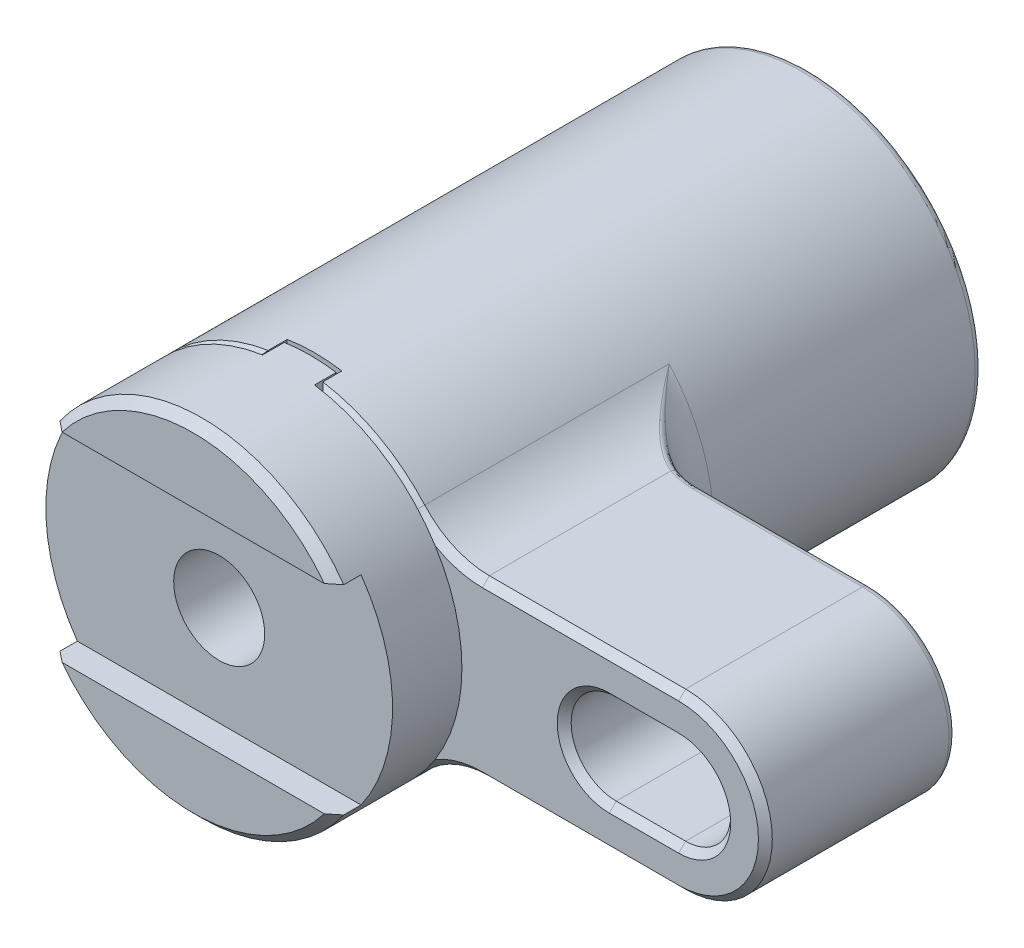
ISO-10303-21;
HEADER;
FILE_DESCRIPTION(('STEP AP214'),'2;1');
FILE_NAME('part.step','',(''),(''),'','','');
FILE_SCHEMA(('AUTOMOTIVE_DESIGN { 1 0 10303 214 1 1 1 1 }'));
ENDSEC;
DATA;
#1=APPLICATION_CONTEXT('core data for automotive mechanical design processes');
#2=APPLICATION_PROTOCOL_DEFINITION('international standard','automotive_design',2000,#1);
#3=PRODUCT_CONTEXT('',#1,'mechanical');
#4=PRODUCT('Part','Part','',(#3));
#5=PRODUCT_RELATED_PRODUCT_CATEGORY('part','',(#4));
#6=PRODUCT_DEFINITION_FORMATION('','',#4);
#7=PRODUCT_DEFINITION_CONTEXT('part definition',#1,'design');
#8=PRODUCT_DEFINITION('design','',#6,#7);
#9=PRODUCT_DEFINITION_SHAPE('','',#8);
#10=(LENGTH_UNIT() NAMED_UNIT(*) SI_UNIT(.MILLI.,.METRE.));
#11=(NAMED_UNIT(*) PLANE_ANGLE_UNIT() SI_UNIT($,.RADIAN.));
#12=(NAMED_UNIT(*) SI_UNIT($,.STERADIAN.) SOLID_ANGLE_UNIT());
#13=UNCERTAINTY_MEASURE_WITH_UNIT(LENGTH_MEASURE(1.E-05),#10,'distance_accuracy_value','');
#14=(GEOMETRIC_REPRESENTATION_CONTEXT(3) GLOBAL_UNCERTAINTY_ASSIGNED_CONTEXT((#13)) GLOBAL_UNIT_ASSIGNED_CONTEXT((#10,
#11,#12)) REPRESENTATION_CONTEXT('',''));
#15=CARTESIAN_POINT('',(0.,0.,0.));
#16=DIRECTION('',(0.,0.,1.));
#17=DIRECTION('',(1.,0.,0.));
#18=AXIS2_PLACEMENT_3D('',#15,#16,#17);
#19=CARTESIAN_POINT('',(0.,0.,38.));
#20=DIRECTION('',(0.,0.,1.));
#21=DIRECTION('',(0.,-1.,0.));
#22=AXIS2_PLACEMENT_3D('',#19,#20,#21);
#23=CYLINDRICAL_SURFACE('',#22,6.75);
#24=DIRECTION('',(0.,0.,1.));
#25=VECTOR('',#24,1.);
#26=CARTESIAN_POINT('',(3.14999999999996,5.96992462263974,38.));
#27=LINE('',#26,#25);
#28=CARTESIAN_POINT('',(3.14999999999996,5.96992462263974,59.2));
#29=VERTEX_POINT('',#28);
#30=CARTESIAN_POINT('',(3.14999999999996,5.96992462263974,57.));
#31=VERTEX_POINT('',#30);
#32=EDGE_CURVE('E2104',#29,#31,#27,.F.);
#33=ORIENTED_EDGE('',*,*,#32,.T.);
#34=CARTESIAN_POINT('',(0.,0.,57.));
#35=DIRECTION('',(0.,0.,-1.));
#36=DIRECTION('',(0.,-1.,0.));
#37=AXIS2_PLACEMENT_3D('',#34,#35,#36);
#38=CIRCLE('',#37,6.75);
#39=CARTESIAN_POINT('',(-3.15000000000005,5.9699246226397,57.));
#40=VERTEX_POINT('',#39);
#41=EDGE_CURVE('E2099',#40,#31,#38,.T.);
#42=ORIENTED_EDGE('',*,*,#41,.F.);
#43=DIRECTION('',(0.,0.,1.));
#44=VECTOR('',#43,1.);
#45=CARTESIAN_POINT('',(-3.15000000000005,5.9699246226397,38.));
#46=LINE('',#45,#44);
#47=CARTESIAN_POINT('',(-3.15000000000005,5.9699246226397,59.2));
#48=VERTEX_POINT('',#47);
#49=EDGE_CURVE('E2102',#40,#48,#46,.T.);
#50=ORIENTED_EDGE('',*,*,#49,.T.);
#51=CARTESIAN_POINT('',(0.,0.,56.05));
#52=DIRECTION('',(-0.707106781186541,0.,-0.707106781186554));
#53=DIRECTION('',(-0.707106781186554,0.,0.707106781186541));
#54=AXIS2_PLACEMENT_3D('',#51,#52,#53);
#55=ELLIPSE('',#54,9.5459415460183,6.75);
#56=CARTESIAN_POINT('',(-3.95000000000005,5.47357287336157,60.));
#57=VERTEX_POINT('',#56);
#58=EDGE_CURVE('E964',#57,#48,#55,.T.);
#59=ORIENTED_EDGE('',*,*,#58,.F.);
#60=CARTESIAN_POINT('',(0.,0.,60.));
#61=DIRECTION('',(0.,0.,-1.));
#62=DIRECTION('',(0.,-1.,0.));
#63=AXIS2_PLACEMENT_3D('',#60,#61,#62);
#64=CIRCLE('',#63,6.75);
#65=CARTESIAN_POINT('',(-3.95,-5.47357287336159,60.));
#66=VERTEX_POINT('',#65);
#67=EDGE_CURVE('E2028',#66,#57,#64,.T.);
#68=ORIENTED_EDGE('',*,*,#67,.F.);
#69=CARTESIAN_POINT('',(0.,0.,56.05));
#70=DIRECTION('',(-0.707106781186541,0.,-0.707106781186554));
#71=DIRECTION('',(-0.707106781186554,0.,0.707106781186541));
#72=AXIS2_PLACEMENT_3D('',#69,#70,#71);
#73=ELLIPSE('',#72,9.54594154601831,6.75);
#74=CARTESIAN_POINT('',(-3.15,-5.96992462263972,59.2));
#75=VERTEX_POINT('',#74);
#76=EDGE_CURVE('E961',#75,#66,#73,.T.);
#77=ORIENTED_EDGE('',*,*,#76,.F.);
#78=DIRECTION('',(0.,0.,1.));
#79=VECTOR('',#78,1.);
#80=CARTESIAN_POINT('',(-3.15,-5.96992462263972,38.));
#81=LINE('',#80,#79);
#82=CARTESIAN_POINT('',(-3.15,-5.96992462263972,57.));
#83=VERTEX_POINT('',#82);
#84=EDGE_CURVE('E2097',#75,#83,#81,.F.);
#85=ORIENTED_EDGE('',*,*,#84,.T.);
#86=CARTESIAN_POINT('',(0.,0.,57.));
#87=DIRECTION('',(0.,0.,-1.));
#88=DIRECTION('',(0.,-1.,0.));
#89=AXIS2_PLACEMENT_3D('',#86,#87,#88);
#90=CIRCLE('',#89,6.75);
#91=CARTESIAN_POINT('',(3.15,-5.96992462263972,57.));
#92=VERTEX_POINT('',#91);
#93=EDGE_CURVE('E2091',#92,#83,#90,.T.);
#94=ORIENTED_EDGE('',*,*,#93,.F.);
#95=DIRECTION('',(0.,0.,1.));
#96=VECTOR('',#95,1.);
#97=CARTESIAN_POINT('',(3.15,-5.96992462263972,38.));
#98=LINE('',#97,#96);
#99=CARTESIAN_POINT('',(3.15,-5.96992462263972,59.2));
#100=VERTEX_POINT('',#99);
#101=EDGE_CURVE('E2094',#92,#100,#98,.T.);
#102=ORIENTED_EDGE('',*,*,#101,.T.);
#103=CARTESIAN_POINT('',(0.,0.,56.05));
#104=DIRECTION('',(0.707106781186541,0.,-0.707106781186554));
#105=DIRECTION('',(0.707106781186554,0.,0.707106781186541));
#106=AXIS2_PLACEMENT_3D('',#103,#104,#105);
#107=ELLIPSE('',#106,9.54594154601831,6.75);
#108=CARTESIAN_POINT('',(3.95,-5.4735728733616,60.));
#109=VERTEX_POINT('',#108);
#110=EDGE_CURVE('E957',#109,#100,#107,.T.);
#111=ORIENTED_EDGE('',*,*,#110,.F.);
#112=CARTESIAN_POINT('',(3.95,5.47357287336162,60.));
#113=VERTEX_POINT('',#112);
#114=EDGE_CURVE('E2068',#113,#109,#64,.T.);
#115=ORIENTED_EDGE('',*,*,#114,.F.);
#116=CARTESIAN_POINT('',(0.,0.,56.05));
#117=DIRECTION('',(0.707106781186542,0.,-0.707106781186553));
#118=DIRECTION('',(0.707106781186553,0.,0.707106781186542));
#119=AXIS2_PLACEMENT_3D('',#116,#117,#118);
#120=ELLIPSE('',#119,9.54594154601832,6.75);
#121=EDGE_CURVE('E966',#29,#113,#120,.T.);
#122=ORIENTED_EDGE('',*,*,#121,.F.);
#123=EDGE_LOOP('',(#33,#42,#50,#59,#68,#77,#85,#94,#102,#111,#115,#122));
#124=FACE_BOUND('',#123,.T.);
#125=CARTESIAN_POINT('',(0.,0.,36.));
#126=DIRECTION('',(0.,0.,-1.));
#127=DIRECTION('',(0.,-1.,0.));
#128=AXIS2_PLACEMENT_3D('',#125,#126,#127);
#129=CIRCLE('',#128,6.75);
#130=CARTESIAN_POINT('',(0.,-6.75,36.));
#131=VERTEX_POINT('',#130);
#132=EDGE_CURVE('E19',#131,#131,#129,.T.);
#133=ORIENTED_EDGE('',*,*,#132,.T.);
#134=EDGE_LOOP('',(#133));
#135=FACE_BOUND('',#134,.T.);
#136=ADVANCED_FACE('F14',(#124,#135),#23,.F.);
#137=CARTESIAN_POINT('',(0.,0.,60.));
#138=DIRECTION('',(0.,0.,-1.));
#139=DIRECTION('',(0.,1.,0.));
#140=AXIS2_PLACEMENT_3D('',#137,#138,#139);
#141=CYLINDRICAL_SURFACE('',#140,20.);
#142=CARTESIAN_POINT('',(0.,0.,47.25));
#143=DIRECTION('',(0.,0.,1.));
#144=DIRECTION('',(0.,1.,0.));
#145=AXIS2_PLACEMENT_3D('',#142,#143,#144);
#146=CIRCLE('',#145,20.);
#147=CARTESIAN_POINT('',(-19.9436706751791,1.5,47.25));
#148=VERTEX_POINT('',#147);
#149=CARTESIAN_POINT('',(-19.0787840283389,-6.,47.25));
#150=VERTEX_POINT('',#149);
#151=EDGE_CURVE('E446',#148,#150,#146,.T.);
#152=ORIENTED_EDGE('',*,*,#151,.T.);
#153=DIRECTION('',(0.,0.,-1.));
#154=VECTOR('',#153,1.);
#155=CARTESIAN_POINT('',(-19.0787840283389,-6.,60.));
#156=LINE('',#155,#154);
#157=CARTESIAN_POINT('',(-19.0787840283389,-6.,50.75));
#158=VERTEX_POINT('',#157);
#159=EDGE_CURVE('E425',#158,#150,#156,.T.);
#160=ORIENTED_EDGE('',*,*,#159,.F.);
#161=CARTESIAN_POINT('',(0.,0.,50.75));
#162=DIRECTION('',(0.,0.,-1.));
#163=DIRECTION('',(0.,-1.,0.));
#164=AXIS2_PLACEMENT_3D('',#161,#162,#163);
#165=CIRCLE('',#164,20.);
#166=CARTESIAN_POINT('',(-19.9436706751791,1.5,50.75));
#167=VERTEX_POINT('',#166);
#168=EDGE_CURVE('E407',#158,#167,#165,.T.);
#169=ORIENTED_EDGE('',*,*,#168,.T.);
#170=DIRECTION('',(0.,0.,-1.));
#171=VECTOR('',#170,1.);
#172=CARTESIAN_POINT('',(-19.9436706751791,1.5,60.));
#173=LINE('',#172,#171);
#174=CARTESIAN_POINT('',(-19.9436706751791,1.5,51.75));
#175=VERTEX_POINT('',#174);
#176=EDGE_CURVE('E1757',#175,#167,#173,.T.);
#177=ORIENTED_EDGE('',*,*,#176,.F.);
#178=CARTESIAN_POINT('',(-19.9436706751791,1.50000000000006,51.75));
#179=CARTESIAN_POINT('',(-19.9355258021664,1.60829263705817,51.6874777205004));
#180=CARTESIAN_POINT('',(-19.9264975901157,1.71653594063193,51.6249851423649));
#181=CARTESIAN_POINT('',(-19.9071206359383,1.92803302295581,51.5028802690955));
#182=CARTESIAN_POINT('',(-19.8968495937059,2.0312921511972,51.4432649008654));
#183=CARTESIAN_POINT('',(-19.8752184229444,2.2328173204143,51.3269141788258));
#184=CARTESIAN_POINT('',(-19.8639324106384,2.33108938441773,51.2701754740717));
#185=CARTESIAN_POINT('',(-19.840491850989,2.52264299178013,51.1595788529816));
#186=CARTESIAN_POINT('',(-19.8284078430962,2.61593102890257,51.1057172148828));
#187=CARTESIAN_POINT('',(-19.8012909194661,2.81427340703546,50.9912035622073));
#188=CARTESIAN_POINT('',(-19.7860784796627,2.91930955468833,50.9305624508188));
#189=CARTESIAN_POINT('',(-19.7544460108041,3.12609637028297,50.811176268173));
#190=CARTESIAN_POINT('',(-19.738074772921,3.22785265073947,50.752427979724));
#191=CARTESIAN_POINT('',(-19.7042704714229,3.42807789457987,50.6368277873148));
#192=CARTESIAN_POINT('',(-19.6868847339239,3.52655287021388,50.5799724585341));
#193=CARTESIAN_POINT('',(-19.6511927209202,3.72021689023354,50.4681585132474));
#194=CARTESIAN_POINT('',(-19.6329323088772,3.81541228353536,50.4131962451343));
#195=CARTESIAN_POINT('',(-19.5934774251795,4.01330671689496,50.2989415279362));
#196=CARTESIAN_POINT('',(-19.5721651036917,4.11598822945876,50.2396593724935));
#197=CARTESIAN_POINT('',(-19.5283957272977,4.31882937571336,50.1225505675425));
#198=CARTESIAN_POINT('',(-19.5059741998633,4.41899476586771,50.0647206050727));
#199=CARTESIAN_POINT('',(-19.4600928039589,4.61680224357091,49.9505163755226));
#200=CARTESIAN_POINT('',(-19.4366676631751,4.71445038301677,49.894138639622));
#201=CARTESIAN_POINT('',(-19.3888829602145,4.90722432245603,49.7828391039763));
#202=CARTESIAN_POINT('',(-19.3645573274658,5.00235643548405,49.7279136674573));
#203=CARTESIAN_POINT('',(-19.3130437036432,5.19780093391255,49.615073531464));
#204=CARTESIAN_POINT('',(-19.2857715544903,5.29809673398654,49.5571685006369));
#205=CARTESIAN_POINT('',(-19.2301316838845,5.49658719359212,49.44257120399));
#206=CARTESIAN_POINT('',(-19.2017917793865,5.59478770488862,49.3858755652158));
#207=CARTESIAN_POINT('',(-19.1440999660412,5.78908639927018,49.2736971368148));
#208=CARTESIAN_POINT('',(-19.1147753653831,5.8851906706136,49.2182108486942));
#209=CARTESIAN_POINT('',(-19.055196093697,6.07529770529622,49.1084514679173));
#210=CARTESIAN_POINT('',(-19.0249682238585,6.16930676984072,49.0541747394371));
#211=CARTESIAN_POINT('',(-18.9940275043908,6.26313972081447,49.));
#212=B_SPLINE_CURVE_WITH_KNOTS('',3,(#178,#179,#180,#181,#182,#183,#184,#185,#186,#187,#188,
#189,#190,#191,#192,#193,#194,#195,#196,#197,#198,#199,#200,#201,#202,#203,#204,#205,#206,#207,
#208,#209,#210,#211),.UNSPECIFIED.,.F.,.F.,(4,2,2,2,2,2,2,2,2,2,2,2,2,2,2,2,4),(0.,
0.375927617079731,0.734939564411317,1.07703596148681,1.40221695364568,1.76890940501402,
2.12479685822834,2.46987970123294,2.80415836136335,3.16554504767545,3.51897633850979,
3.86445298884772,4.20197580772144,4.55890152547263,4.90953024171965,5.25386318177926,
5.59190163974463),.UNSPECIFIED.);
#213=CARTESIAN_POINT('',(-18.9940275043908,6.2631397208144,49.));
#214=VERTEX_POINT('',#213);
#215=EDGE_CURVE('E1812',#175,#214,#212,.T.);
#216=ORIENTED_EDGE('',*,*,#215,.T.);
#217=CARTESIAN_POINT('',(-18.9940275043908,6.26313972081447,49.));
#218=CARTESIAN_POINT('',(-19.0249666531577,6.16931153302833,48.9458280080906));
#219=CARTESIAN_POINT('',(-19.0551930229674,6.07530725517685,48.8915540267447));
#220=CARTESIAN_POINT('',(-19.1147704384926,5.88520664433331,48.781798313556));
#221=CARTESIAN_POINT('',(-19.144094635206,5.78910399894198,48.7263129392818));
#222=CARTESIAN_POINT('',(-19.2017866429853,5.59480536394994,48.6141345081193));
#223=CARTESIAN_POINT('',(-19.2301270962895,5.49660327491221,48.5574379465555));
#224=CARTESIAN_POINT('',(-19.2857689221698,5.29810641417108,48.4428369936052));
#225=CARTESIAN_POINT('',(-19.3130424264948,5.19780577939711,48.3849292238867));
#226=CARTESIAN_POINT('',(-19.3645545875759,5.00236683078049,48.2720923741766));
#227=CARTESIAN_POINT('',(-19.388877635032,4.90724514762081,48.2171729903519));
#228=CARTESIAN_POINT('',(-19.4366592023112,4.71448518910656,48.1058815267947));
#229=CARTESIAN_POINT('',(-19.4600836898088,4.61684058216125,48.0495057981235));
#230=CARTESIAN_POINT('',(-19.5059655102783,4.41903320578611,47.9353015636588));
#231=CARTESIAN_POINT('',(-19.5283880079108,4.31886436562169,47.8774695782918));
#232=CARTESIAN_POINT('',(-19.5721607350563,4.11600927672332,47.7603527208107));
#233=CARTESIAN_POINT('',(-19.5934753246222,4.01331725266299,47.7010645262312));
#234=CARTESIAN_POINT('',(-19.6329302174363,3.81542277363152,47.5868098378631));
#235=CARTESIAN_POINT('',(-19.6511886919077,3.72023789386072,47.5318536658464));
#236=CARTESIAN_POINT('',(-19.6868784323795,3.52658794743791,47.4200478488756));
#237=CARTESIAN_POINT('',(-19.704263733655,3.42811651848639,47.3631945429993));
#238=CARTESIAN_POINT('',(-19.7380684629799,3.22789134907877,47.2475943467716));
#239=CARTESIAN_POINT('',(-19.7544404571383,3.12613158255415,47.1888440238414));
#240=CARTESIAN_POINT('',(-19.7860754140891,2.91933072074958,47.0694497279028));
#241=CARTESIAN_POINT('',(-19.8012894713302,2.81428399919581,47.0088025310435));
#242=CARTESIAN_POINT('',(-19.8284069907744,2.61593726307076,46.8942864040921));
#243=CARTESIAN_POINT('',(-19.8404902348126,2.52265546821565,46.8404283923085));
#244=CARTESIAN_POINT('',(-19.8639299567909,2.33111020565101,46.7298366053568));
#245=CARTESIAN_POINT('',(-19.8752158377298,2.23284023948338,46.6730991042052));
#246=CARTESIAN_POINT('',(-19.8968472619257,2.03131509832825,46.5567483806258));
#247=CARTESIAN_POINT('',(-19.9071186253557,1.92805389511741,46.4971318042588));
#248=CARTESIAN_POINT('',(-19.926496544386,1.71654847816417,46.3750221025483));
#249=CARTESIAN_POINT('',(-19.9355253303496,1.60829890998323,46.3125259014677));
#250=CARTESIAN_POINT('',(-19.9436706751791,1.50000000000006,46.25));
#251=B_SPLINE_CURVE_WITH_KNOTS('',3,(#217,#218,#219,#220,#221,#222,#223,#224,#225,#226,#227,
#228,#229,#230,#231,#232,#233,#234,#235,#236,#237,#238,#239,#240,#241,#242,#243,#244,#245,#246,
#247,#248,#249,#250),.UNSPECIFIED.,.F.,.F.,(4,2,2,2,2,2,2,2,2,2,2,2,2,2,2,2,4),(0.,
0.338021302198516,0.682348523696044,1.03298295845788,1.38992583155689,1.72741165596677,
2.07287597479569,2.42631959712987,2.78774327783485,3.12198502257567,3.46705556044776,
3.82295531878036,4.18968468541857,4.51484390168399,4.85693304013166,5.21595224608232,
5.59190163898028),.UNSPECIFIED.);
#252=CARTESIAN_POINT('',(-19.9436706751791,1.5,46.25));
#253=VERTEX_POINT('',#252);
#254=EDGE_CURVE('E1783',#214,#253,#251,.T.);
#255=ORIENTED_EDGE('',*,*,#254,.T.);
#256=DIRECTION('',(0.,0.,-1.));
#257=VECTOR('',#256,1.);
#258=CARTESIAN_POINT('',(-19.9436706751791,1.5,60.));
#259=LINE('',#258,#257);
#260=EDGE_CURVE('E1781',#148,#253,#259,.T.);
#261=ORIENTED_EDGE('',*,*,#260,.F.);
#262=EDGE_LOOP('',(#152,#160,#169,#177,#216,#255,#261));
#263=FACE_BOUND('',#262,.T.);
#264=ADVANCED_FACE('F743',(#263),#141,.T.);
#265=CARTESIAN_POINT('',(-19.6436706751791,1.5,60.));
#266=DIRECTION('',(0.,-1.,0.));
#267=DIRECTION('',(-1.,0.,0.));
#268=AXIS2_PLACEMENT_3D('',#265,#266,#267);
#269=PLANE('',#268);
#270=ORIENTED_EDGE('',*,*,#176,.T.);
#271=DIRECTION('',(-1.,0.,0.));
#272=VECTOR('',#271,1.);
#273=CARTESIAN_POINT('',(-19.6436706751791,1.5,50.75));
#274=LINE('',#273,#272);
#275=CARTESIAN_POINT('',(-19.6436706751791,1.5,50.75));
#276=VERTEX_POINT('',#275);
#277=EDGE_CURVE('E420',#276,#167,#274,.T.);
#278=ORIENTED_EDGE('',*,*,#277,.F.);
#279=DIRECTION('',(0.,0.,-1.));
#280=VECTOR('',#279,1.);
#281=CARTESIAN_POINT('',(-19.6436706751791,1.5,60.));
#282=LINE('',#281,#280);
#283=CARTESIAN_POINT('',(-19.6436706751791,1.5,51.75));
#284=VERTEX_POINT('',#283);
#285=EDGE_CURVE('E416',#284,#276,#282,.T.);
#286=ORIENTED_EDGE('',*,*,#285,.F.);
#287=DIRECTION('',(-1.,0.,0.));
#288=VECTOR('',#287,1.);
#289=CARTESIAN_POINT('',(-19.6436706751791,1.5,51.75));
#290=LINE('',#289,#288);
#291=EDGE_CURVE('E1802',#284,#175,#290,.T.);
#292=ORIENTED_EDGE('',*,*,#291,.T.);
#293=EDGE_LOOP('',(#270,#278,#286,#292));
#294=FACE_BOUND('',#293,.T.);
#295=ADVANCED_FACE('F749',(#294),#269,.T.);
#296=CARTESIAN_POINT('',(-19.6436706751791,1.5,50.75));
#297=DIRECTION('',(0.,0.,-1.));
#298=DIRECTION('',(0.,1.,0.));
#299=AXIS2_PLACEMENT_3D('',#296,#297,#298);
#300=PLANE('',#299);
#301=ORIENTED_EDGE('',*,*,#168,.F.);
#302=DIRECTION('',(-1.,0.,0.));
#303=VECTOR('',#302,1.);
#304=CARTESIAN_POINT('',(-18.7787840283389,-6.,50.75));
#305=LINE('',#304,#303);
#306=CARTESIAN_POINT('',(-18.7787840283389,-6.,50.75));
#307=VERTEX_POINT('',#306);
#308=EDGE_CURVE('E401',#307,#158,#305,.T.);
#309=ORIENTED_EDGE('',*,*,#308,.F.);
#310=CARTESIAN_POINT('',(0.3,0.,50.75));
#311=DIRECTION('',(0.,0.,-1.));
#312=DIRECTION('',(0.,-1.,0.));
#313=AXIS2_PLACEMENT_3D('',#310,#311,#312);
#314=CIRCLE('',#313,20.);
#315=EDGE_CURVE('E411',#307,#276,#314,.T.);
#316=ORIENTED_EDGE('',*,*,#315,.T.);
#317=ORIENTED_EDGE('',*,*,#277,.T.);
#318=EDGE_LOOP('',(#301,#309,#316,#317));
#319=FACE_BOUND('',#318,.T.);
#320=ADVANCED_FACE('F422',(#319),#300,.F.);
#321=CARTESIAN_POINT('',(-18.7787840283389,-6.,60.));
#322=DIRECTION('',(0.,-1.,0.));
#323=DIRECTION('',(-1.,0.,0.));
#324=AXIS2_PLACEMENT_3D('',#321,#322,#323);
#325=PLANE('',#324);
#326=ORIENTED_EDGE('',*,*,#159,.T.);
#327=DIRECTION('',(-1.,0.,0.));
#328=VECTOR('',#327,1.);
#329=CARTESIAN_POINT('',(-18.7787840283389,-6.,47.25));
#330=LINE('',#329,#328);
#331=CARTESIAN_POINT('',(-18.7787840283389,-6.,47.25));
#332=VERTEX_POINT('',#331);
#333=EDGE_CURVE('E404',#332,#150,#330,.T.);
#334=ORIENTED_EDGE('',*,*,#333,.F.);
#335=DIRECTION('',(0.,0.,-1.));
#336=VECTOR('',#335,1.);
#337=CARTESIAN_POINT('',(-18.7787840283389,-6.,60.));
#338=LINE('',#337,#336);
#339=EDGE_CURVE('E395',#307,#332,#338,.T.);
#340=ORIENTED_EDGE('',*,*,#339,.F.);
#341=ORIENTED_EDGE('',*,*,#308,.T.);
#342=EDGE_LOOP('',(#326,#334,#340,#341));
#343=FACE_BOUND('',#342,.T.);
#344=ADVANCED_FACE('F398',(#343),#325,.T.);
#345=CARTESIAN_POINT('',(-18.7787840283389,-6.,47.25));
#346=DIRECTION('',(0.,0.,1.));
#347=DIRECTION('',(0.,-1.,0.));
#348=AXIS2_PLACEMENT_3D('',#345,#346,#347);
#349=PLANE('',#348);
#350=ORIENTED_EDGE('',*,*,#151,.F.);
#351=DIRECTION('',(-1.,0.,0.));
#352=VECTOR('',#351,1.);
#353=CARTESIAN_POINT('',(-19.6436706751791,1.5,47.25));
#354=LINE('',#353,#352);
#355=CARTESIAN_POINT('',(-19.6436706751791,1.5,47.25));
#356=VERTEX_POINT('',#355);
#357=EDGE_CURVE('E135',#356,#148,#354,.T.);
#358=ORIENTED_EDGE('',*,*,#357,.F.);
#359=CARTESIAN_POINT('',(0.3,0.,47.25));
#360=DIRECTION('',(0.,0.,1.));
#361=DIRECTION('',(0.,1.,0.));
#362=AXIS2_PLACEMENT_3D('',#359,#360,#361);
#363=CIRCLE('',#362,20.);
#364=EDGE_CURVE('E439',#356,#332,#363,.T.);
#365=ORIENTED_EDGE('',*,*,#364,.T.);
#366=ORIENTED_EDGE('',*,*,#333,.T.);
#367=EDGE_LOOP('',(#350,#358,#365,#366));
#368=FACE_BOUND('',#367,.T.);
#369=ADVANCED_FACE('F1682',(#368),#349,.F.);
#370=CARTESIAN_POINT('',(-19.6436706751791,1.5,60.));
#371=DIRECTION('',(0.,-1.,0.));
#372=DIRECTION('',(-1.,0.,0.));
#373=AXIS2_PLACEMENT_3D('',#370,#371,#372);
#374=PLANE('',#373);
#375=ORIENTED_EDGE('',*,*,#260,.T.);
#376=DIRECTION('',(-1.,0.,0.));
#377=VECTOR('',#376,1.);
#378=CARTESIAN_POINT('',(-19.6436706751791,1.5,46.25));
#379=LINE('',#378,#377);
#380=CARTESIAN_POINT('',(-19.6436706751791,1.5,46.25));
#381=VERTEX_POINT('',#380);
#382=EDGE_CURVE('E1785',#381,#253,#379,.T.);
#383=ORIENTED_EDGE('',*,*,#382,.F.);
#384=DIRECTION('',(0.,0.,-1.));
#385=VECTOR('',#384,1.);
#386=CARTESIAN_POINT('',(-19.6436706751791,1.5,60.));
#387=LINE('',#386,#385);
#388=EDGE_CURVE('E1775',#356,#381,#387,.T.);
#389=ORIENTED_EDGE('',*,*,#388,.F.);
#390=ORIENTED_EDGE('',*,*,#357,.T.);
#391=EDGE_LOOP('',(#375,#383,#389,#390));
#392=FACE_BOUND('',#391,.T.);
#393=ADVANCED_FACE('F1673',(#392),#374,.T.);
#394=CARTESIAN_POINT('',(-19.6436706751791,1.5,46.25));
#395=DIRECTION('',(0.,-0.5,0.866025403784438));
#396=DIRECTION('',(0.,-0.866025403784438,-0.5));
#397=AXIS2_PLACEMENT_3D('',#394,#395,#396);
#398=PLANE('',#397);
#399=ORIENTED_EDGE('',*,*,#254,.F.);
#400=DIRECTION('',(-1.,0.,0.));
#401=VECTOR('',#400,1.);
#402=CARTESIAN_POINT('',(-18.6940275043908,6.26313972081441,49.));
#403=LINE('',#402,#401);
#404=CARTESIAN_POINT('',(-18.6940275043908,6.2631397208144,49.));
#405=VERTEX_POINT('',#404);
#406=EDGE_CURVE('E1815',#405,#214,#403,.T.);
#407=ORIENTED_EDGE('',*,*,#406,.F.);
#408=CARTESIAN_POINT('',(-18.6940275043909,6.26313972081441,49.));
#409=CARTESIAN_POINT('',(-19.0756995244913,5.10547032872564,48.331619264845));
#410=CARTESIAN_POINT('',(-19.3139735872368,3.91050381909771,47.6417050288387));
#411=CARTESIAN_POINT('',(-19.5521549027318,2.71600244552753,46.9520593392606));
#412=CARTESIAN_POINT('',(-19.6436706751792,1.5,46.25));
#413=B_SPLINE_CURVE_WITH_KNOTS('',2,(#408,#409,#410,#411,#412),.UNSPECIFIED.,.F.,.F.,(3,2,3),
(0.,0.5,1.),.UNSPECIFIED.);
#414=EDGE_CURVE('E1789',#405,#381,#413,.T.);
#415=ORIENTED_EDGE('',*,*,#414,.T.);
#416=ORIENTED_EDGE('',*,*,#382,.T.);
#417=EDGE_LOOP('',(#399,#407,#415,#416));
#418=FACE_BOUND('',#417,.T.);
#419=ADVANCED_FACE('F1664',(#418),#398,.F.);
#420=CARTESIAN_POINT('',(-18.6940275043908,6.26313972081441,49.));
#421=DIRECTION('',(0.,-0.5,-0.866025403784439));
#422=DIRECTION('',(0.,0.866025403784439,-0.5));
#423=AXIS2_PLACEMENT_3D('',#420,#421,#422);
#424=PLANE('',#423);
#425=ORIENTED_EDGE('',*,*,#215,.F.);
#426=ORIENTED_EDGE('',*,*,#291,.F.);
#427=CARTESIAN_POINT('',(-19.6436706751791,1.5,51.75));
#428=CARTESIAN_POINT('',(-19.5521907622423,2.71552596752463,51.0482157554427));
#429=CARTESIAN_POINT('',(-19.3139735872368,3.91050381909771,50.3582949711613));
#430=CARTESIAN_POINT('',(-19.0758491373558,5.10501653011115,49.6686427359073));
#431=CARTESIAN_POINT('',(-18.6940275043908,6.26313972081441,49.));
#432=B_SPLINE_CURVE_WITH_KNOTS('',2,(#427,#428,#429,#430,#431),.UNSPECIFIED.,.F.,.F.,(3,2,3),
(0.,0.5,1.),.UNSPECIFIED.);
#433=EDGE_CURVE('E556',#284,#405,#432,.T.);
#434=ORIENTED_EDGE('',*,*,#433,.T.);
#435=ORIENTED_EDGE('',*,*,#406,.T.);
#436=EDGE_LOOP('',(#425,#426,#434,#435));
#437=FACE_BOUND('',#436,.T.);
#438=ADVANCED_FACE('F1655',(#437),#424,.F.);
#439=CARTESIAN_POINT('',(0.,6.,38.8));
#440=DIRECTION('',(1.,0.,0.));
#441=DIRECTION('',(0.,-1.,0.));
#442=AXIS2_PLACEMENT_3D('',#439,#440,#441);
#443=CYLINDRICAL_SURFACE('',#442,0.8);
#444=CARTESIAN_POINT('',(37.,6.,38.8));
#445=DIRECTION('',(-1.,0.,0.));
#446=DIRECTION('',(0.,-1.,0.));
#447=AXIS2_PLACEMENT_3D('',#444,#445,#446);
#448=CIRCLE('',#447,0.8);
#449=CARTESIAN_POINT('',(37.,6.,38.));
#450=VERTEX_POINT('',#449);
#451=CARTESIAN_POINT('',(37.,5.2,38.8));
#452=VERTEX_POINT('',#451);
#453=EDGE_CURVE('E950',#450,#452,#448,.T.);
#454=ORIENTED_EDGE('',*,*,#453,.F.);
#455=DIRECTION('',(1.,0.,0.));
#456=VECTOR('',#455,1.);
#457=CARTESIAN_POINT('',(0.,6.,38.));
#458=LINE('',#457,#456);
#459=CARTESIAN_POINT('',(45.,6.,38.));
#460=VERTEX_POINT('',#459);
#461=EDGE_CURVE('E2292',#450,#460,#458,.T.);
#462=ORIENTED_EDGE('',*,*,#461,.T.);
#463=CARTESIAN_POINT('',(45.,6.,38.8));
#464=DIRECTION('',(1.,0.,0.));
#465=DIRECTION('',(0.,1.,0.));
#466=AXIS2_PLACEMENT_3D('',#463,#464,#465);
#467=CIRCLE('',#466,0.8);
#468=CARTESIAN_POINT('',(45.,5.2,38.8));
#469=VERTEX_POINT('',#468);
#470=EDGE_CURVE('E1986',#469,#460,#467,.T.);
#471=ORIENTED_EDGE('',*,*,#470,.F.);
#472=DIRECTION('',(1.,0.,0.));
#473=VECTOR('',#472,1.);
#474=CARTESIAN_POINT('',(37.,5.2,38.8));
#475=LINE('',#474,#473);
#476=EDGE_CURVE('E2286',#469,#452,#475,.F.);
#477=ORIENTED_EDGE('',*,*,#476,.T.);
#478=EDGE_LOOP('',(#454,#462,#471,#477));
#479=FACE_BOUND('',#478,.T.);
#480=ADVANCED_FACE('F1646',(#479),#443,.T.);
#481=CARTESIAN_POINT('',(45.,0.,38.8));
#482=DIRECTION('',(0.,0.,1.));
#483=DIRECTION('',(0.,-1.,0.));
#484=AXIS2_PLACEMENT_3D('',#481,#482,#483);
#485=TOROIDAL_SURFACE('',#484,6.,0.8);
#486=CARTESIAN_POINT('',(45.,-6.,38.8));
#487=DIRECTION('',(-1.,0.,0.));
#488=DIRECTION('',(0.,-1.,0.));
#489=AXIS2_PLACEMENT_3D('',#486,#487,#488);
#490=CIRCLE('',#489,0.8);
#491=CARTESIAN_POINT('',(45.,-5.2,38.8));
#492=VERTEX_POINT('',#491);
#493=CARTESIAN_POINT('',(45.,-6.,38.));
#494=VERTEX_POINT('',#493);
#495=EDGE_CURVE('E943',#492,#494,#490,.T.);
#496=ORIENTED_EDGE('',*,*,#495,.F.);
#497=CARTESIAN_POINT('',(45.,0.,38.8));
#498=DIRECTION('',(0.,0.,-1.));
#499=DIRECTION('',(0.,-1.,0.));
#500=AXIS2_PLACEMENT_3D('',#497,#498,#499);
#501=CIRCLE('',#500,5.2);
#502=EDGE_CURVE('E958',#492,#469,#501,.F.);
#503=ORIENTED_EDGE('',*,*,#502,.T.);
#504=ORIENTED_EDGE('',*,*,#470,.T.);
#505=CARTESIAN_POINT('',(45.,0.,38.));
#506=DIRECTION('',(0.,0.,-1.));
#507=DIRECTION('',(0.,-1.,0.));
#508=AXIS2_PLACEMENT_3D('',#505,#506,#507);
#509=CIRCLE('',#508,6.);
#510=EDGE_CURVE('E2177',#460,#494,#509,.T.);
#511=ORIENTED_EDGE('',*,*,#510,.T.);
#512=EDGE_LOOP('',(#496,#503,#504,#511));
#513=FACE_BOUND('',#512,.T.);
#514=ADVANCED_FACE('F1639',(#513),#485,.T.);
#515=CARTESIAN_POINT('',(0.,-6.,38.8));
#516=DIRECTION('',(-1.,0.,0.));
#517=DIRECTION('',(0.,1.,0.));
#518=AXIS2_PLACEMENT_3D('',#515,#516,#517);
#519=CYLINDRICAL_SURFACE('',#518,0.8);
#520=ORIENTED_EDGE('',*,*,#495,.T.);
#521=DIRECTION('',(-1.,0.,0.));
#522=VECTOR('',#521,1.);
#523=CARTESIAN_POINT('',(0.,-6.,38.));
#524=LINE('',#523,#522);
#525=CARTESIAN_POINT('',(37.,-6.,38.));
#526=VERTEX_POINT('',#525);
#527=EDGE_CURVE('E2179',#494,#526,#524,.T.);
#528=ORIENTED_EDGE('',*,*,#527,.T.);
#529=CARTESIAN_POINT('',(37.,-6.,38.8));
#530=DIRECTION('',(1.,0.,0.));
#531=DIRECTION('',(0.,1.,0.));
#532=AXIS2_PLACEMENT_3D('',#529,#530,#531);
#533=CIRCLE('',#532,0.8);
#534=CARTESIAN_POINT('',(37.,-5.2,38.8));
#535=VERTEX_POINT('',#534);
#536=EDGE_CURVE('E939',#526,#535,#533,.T.);
#537=ORIENTED_EDGE('',*,*,#536,.T.);
#538=DIRECTION('',(-1.,0.,0.));
#539=VECTOR('',#538,1.);
#540=CARTESIAN_POINT('',(37.,-5.2,38.8));
#541=LINE('',#540,#539);
#542=EDGE_CURVE('E2285',#535,#492,#541,.F.);
#543=ORIENTED_EDGE('',*,*,#542,.T.);
#544=EDGE_LOOP('',(#520,#528,#537,#543));
#545=FACE_BOUND('',#544,.T.);
#546=ADVANCED_FACE('F917',(#545),#519,.T.);
#547=CARTESIAN_POINT('',(37.,0.,38.8));
#548=DIRECTION('',(0.,0.,1.));
#549=DIRECTION('',(0.,-1.,0.));
#550=AXIS2_PLACEMENT_3D('',#547,#548,#549);
#551=TOROIDAL_SURFACE('',#550,6.,0.8);
#552=ORIENTED_EDGE('',*,*,#536,.F.);
#553=CARTESIAN_POINT('',(37.,0.,38.));
#554=DIRECTION('',(0.,0.,-1.));
#555=DIRECTION('',(0.,-1.,0.));
#556=AXIS2_PLACEMENT_3D('',#553,#554,#555);
#557=CIRCLE('',#556,6.);
#558=EDGE_CURVE('E2294',#526,#450,#557,.T.);
#559=ORIENTED_EDGE('',*,*,#558,.T.);
#560=ORIENTED_EDGE('',*,*,#453,.T.);
#561=CARTESIAN_POINT('',(37.,0.,38.8));
#562=DIRECTION('',(0.,0.,-1.));
#563=DIRECTION('',(0.,-1.,0.));
#564=AXIS2_PLACEMENT_3D('',#561,#562,#563);
#565=CIRCLE('',#564,5.2);
#566=EDGE_CURVE('E2281',#452,#535,#565,.F.);
#567=ORIENTED_EDGE('',*,*,#566,.T.);
#568=EDGE_LOOP('',(#552,#559,#560,#567));
#569=FACE_BOUND('',#568,.T.);
#570=ADVANCED_FACE('F910',(#569),#551,.T.);
#571=CARTESIAN_POINT('',(45.,0.,38.8));
#572=DIRECTION('',(0.,0.,1.));
#573=DIRECTION('',(0.,-1.,0.));
#574=AXIS2_PLACEMENT_3D('',#571,#572,#573);
#575=TOROIDAL_SURFACE('',#574,9.2,0.8);
#576=CARTESIAN_POINT('',(45.,-9.2,38.8));
#577=DIRECTION('',(-1.,0.,0.));
#578=DIRECTION('',(0.,-1.,0.));
#579=AXIS2_PLACEMENT_3D('',#576,#577,#578);
#580=CIRCLE('',#579,0.8);
#581=CARTESIAN_POINT('',(45.,-9.2,38.));
#582=VERTEX_POINT('',#581);
#583=CARTESIAN_POINT('',(45.,-10.,38.8));
#584=VERTEX_POINT('',#583);
#585=EDGE_CURVE('E924',#582,#584,#580,.T.);
#586=ORIENTED_EDGE('',*,*,#585,.F.);
#587=CARTESIAN_POINT('',(45.,0.,38.));
#588=DIRECTION('',(0.,0.,-1.));
#589=DIRECTION('',(0.,-1.,0.));
#590=AXIS2_PLACEMENT_3D('',#587,#588,#589);
#591=CIRCLE('',#590,9.2);
#592=CARTESIAN_POINT('',(45.,9.2,38.));
#593=VERTEX_POINT('',#592);
#594=EDGE_CURVE('E927',#582,#593,#591,.F.);
#595=ORIENTED_EDGE('',*,*,#594,.T.);
#596=CARTESIAN_POINT('',(45.,9.2,38.8));
#597=DIRECTION('',(1.,0.,0.));
#598=DIRECTION('',(0.,1.,0.));
#599=AXIS2_PLACEMENT_3D('',#596,#597,#598);
#600=CIRCLE('',#599,0.8);
#601=CARTESIAN_POINT('',(45.,10.,38.8));
#602=VERTEX_POINT('',#601);
#603=EDGE_CURVE('E902',#593,#602,#600,.T.);
#604=ORIENTED_EDGE('',*,*,#603,.T.);
#605=CARTESIAN_POINT('',(45.,0.,38.8));
#606=DIRECTION('',(0.,0.,-1.));
#607=DIRECTION('',(0.,-1.,0.));
#608=AXIS2_PLACEMENT_3D('',#605,#606,#607);
#609=CIRCLE('',#608,10.);
#610=EDGE_CURVE('E929',#602,#584,#609,.T.);
#611=ORIENTED_EDGE('',*,*,#610,.T.);
#612=EDGE_LOOP('',(#586,#595,#604,#611));
#613=FACE_BOUND('',#612,.T.);
#614=ADVANCED_FACE('F908',(#613),#575,.T.);
#615=CARTESIAN_POINT('',(17.3205080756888,-9.2,38.8));
#616=DIRECTION('',(-1.,0.,0.));
#617=DIRECTION('',(0.,1.,0.));
#618=AXIS2_PLACEMENT_3D('',#615,#616,#617);
#619=CYLINDRICAL_SURFACE('',#618,0.8);
#620=CARTESIAN_POINT('',(25.3842470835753,-9.2,38.8));
#621=DIRECTION('',(-1.,0.,0.));
#622=DIRECTION('',(0.,-1.,0.));
#623=AXIS2_PLACEMENT_3D('',#620,#621,#622);
#624=CIRCLE('',#623,0.8);
#625=CARTESIAN_POINT('',(25.3842470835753,-9.2,38.));
#626=VERTEX_POINT('',#625);
#627=CARTESIAN_POINT('',(25.3842470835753,-10.,38.8));
#628=VERTEX_POINT('',#627);
#629=EDGE_CURVE('E931',#626,#628,#624,.T.);
#630=ORIENTED_EDGE('',*,*,#629,.F.);
#631=DIRECTION('',(-1.,0.,0.));
#632=VECTOR('',#631,1.);
#633=CARTESIAN_POINT('',(0.,-9.2,38.));
#634=LINE('',#633,#632);
#635=EDGE_CURVE('E2163',#626,#582,#634,.F.);
#636=ORIENTED_EDGE('',*,*,#635,.T.);
#637=ORIENTED_EDGE('',*,*,#585,.T.);
#638=DIRECTION('',(-1.,0.,0.));
#639=VECTOR('',#638,1.);
#640=CARTESIAN_POINT('',(17.3205080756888,-10.,38.8));
#641=LINE('',#640,#639);
#642=EDGE_CURVE('E857',#584,#628,#641,.T.);
#643=ORIENTED_EDGE('',*,*,#642,.T.);
#644=EDGE_LOOP('',(#630,#636,#637,#643));
#645=FACE_BOUND('',#644,.T.);
#646=ADVANCED_FACE('F801',(#645),#619,.T.);
#647=CARTESIAN_POINT('',(17.3205080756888,9.2,38.8));
#648=DIRECTION('',(1.,0.,0.));
#649=DIRECTION('',(0.,-1.,0.));
#650=AXIS2_PLACEMENT_3D('',#647,#648,#649);
#651=CYLINDRICAL_SURFACE('',#650,0.8);
#652=ORIENTED_EDGE('',*,*,#603,.F.);
#653=DIRECTION('',(1.,0.,0.));
#654=VECTOR('',#653,1.);
#655=CARTESIAN_POINT('',(0.,9.2,38.));
#656=LINE('',#655,#654);
#657=CARTESIAN_POINT('',(25.3842470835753,9.2,38.));
#658=VERTEX_POINT('',#657);
#659=EDGE_CURVE('E858',#593,#658,#656,.F.);
#660=ORIENTED_EDGE('',*,*,#659,.T.);
#661=CARTESIAN_POINT('',(25.3842470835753,9.2,38.8));
#662=DIRECTION('',(1.,0.,0.));
#663=DIRECTION('',(0.,1.,0.));
#664=AXIS2_PLACEMENT_3D('',#661,#662,#663);
#665=CIRCLE('',#664,0.8);
#666=CARTESIAN_POINT('',(25.3842470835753,10.,38.8));
#667=VERTEX_POINT('',#666);
#668=EDGE_CURVE('E884',#658,#667,#665,.T.);
#669=ORIENTED_EDGE('',*,*,#668,.T.);
#670=DIRECTION('',(1.,0.,0.));
#671=VECTOR('',#670,1.);
#672=CARTESIAN_POINT('',(17.3205080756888,10.,38.8));
#673=LINE('',#672,#671);
#674=EDGE_CURVE('E2154',#667,#602,#673,.T.);
#675=ORIENTED_EDGE('',*,*,#674,.T.);
#676=EDGE_LOOP('',(#652,#660,#669,#675));
#677=FACE_BOUND('',#676,.T.);
#678=ADVANCED_FACE('F772',(#677),#651,.T.);
#679=CARTESIAN_POINT('',(0.,0.,38.));
#680=DIRECTION('',(0.,0.,1.));
#681=DIRECTION('',(0.,-1.,0.));
#682=AXIS2_PLACEMENT_3D('',#679,#680,#681);
#683=PLANE('',#682);
#684=ORIENTED_EDGE('',*,*,#558,.F.);
#685=ORIENTED_EDGE('',*,*,#527,.F.);
#686=ORIENTED_EDGE('',*,*,#510,.F.);
#687=ORIENTED_EDGE('',*,*,#461,.F.);
#688=EDGE_LOOP('',(#684,#685,#686,#687));
#689=FACE_BOUND('',#688,.T.);
#690=ORIENTED_EDGE('',*,*,#594,.F.);
#691=ORIENTED_EDGE('',*,*,#635,.F.);
#692=CARTESIAN_POINT('',(0.,0.,38.));
#693=DIRECTION('',(0.,0.,-1.));
#694=DIRECTION('',(0.,-1.,0.));
#695=AXIS2_PLACEMENT_3D('',#692,#693,#694);
#696=CIRCLE('',#695,27.);
#697=EDGE_CURVE('E2112',#658,#626,#696,.T.);
#698=ORIENTED_EDGE('',*,*,#697,.F.);
#699=ORIENTED_EDGE('',*,*,#659,.F.);
#700=EDGE_LOOP('',(#690,#691,#698,#699));
#701=FACE_BOUND('',#700,.T.);
#702=ADVANCED_FACE('F768',(#689,#701),#683,.F.);
#703=CARTESIAN_POINT('',(28.2114041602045,-10.,38.3274683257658));
#704=CARTESIAN_POINT('',(27.9196996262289,-10.,37.4865684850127));
#705=CARTESIAN_POINT('',(27.9506998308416,-9.11498190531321,37.5759331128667));
#706=CARTESIAN_POINT('',(27.9844041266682,-10.,38.4062349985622));
#707=CARTESIAN_POINT('',(27.7199160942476,-10.,37.5632843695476));
#708=CARTESIAN_POINT('',(27.7449456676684,-9.1212255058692,37.6466211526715));
#709=CARTESIAN_POINT('',(27.7540504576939,-10.,38.475227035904));
#710=CARTESIAN_POINT('',(27.5156145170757,-10.,37.6320831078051));
#711=CARTESIAN_POINT('',(27.5360848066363,-9.12769179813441,37.7085370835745));
#712=CARTESIAN_POINT('',(27.2884157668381,-10.,38.5935096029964));
#713=CARTESIAN_POINT('',(27.1010087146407,-10.,37.7524794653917));
#714=CARTESIAN_POINT('',(27.1137409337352,-9.14105345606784,37.8146881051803));
#715=CARTESIAN_POINT('',(27.0531363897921,-10.,38.6428066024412));
#716=CARTESIAN_POINT('',(26.8908568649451,-10.,37.8042097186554));
#717=CARTESIAN_POINT('',(26.9002594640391,-9.14794867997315,37.858929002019));
#718=CARTESIAN_POINT('',(26.5797228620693,-10.,38.7215249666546));
#719=CARTESIAN_POINT('',(26.4663261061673,-10.,37.8900669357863));
#720=CARTESIAN_POINT('',(26.4705315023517,-9.1621426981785,37.9295736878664));
#721=CARTESIAN_POINT('',(26.3415948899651,-10.,38.7509834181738));
#722=CARTESIAN_POINT('',(26.2520902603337,-10.,37.9243707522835));
#723=CARTESIAN_POINT('',(26.2542909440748,-9.16944071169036,37.9560107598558));
#724=CARTESIAN_POINT('',(25.8637676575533,-10.,38.7902283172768));
#725=CARTESIAN_POINT('',(25.8205852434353,-10.,37.9753042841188));
#726=CARTESIAN_POINT('',(25.820188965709,-9.18442915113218,37.9912305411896));
#727=CARTESIAN_POINT('',(25.6240682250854,-10.,38.8000125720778));
#728=CARTESIAN_POINT('',(25.6034221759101,-10.,37.9920917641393));
#729=CARTESIAN_POINT('',(25.602327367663,-9.19211962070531,38.0000112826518));
#730=CARTESIAN_POINT('',(24.8706511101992,-10.,38.7999730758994));
#731=CARTESIAN_POINT('',(24.922053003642,-10.,38.0166768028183));
#732=CARTESIAN_POINT('',(24.9172108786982,-9.21687645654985,37.9999758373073));
#733=CARTESIAN_POINT('',(24.3564969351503,-10.,38.7550143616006));
#734=CARTESIAN_POINT('',(24.4512669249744,-10.,37.9938628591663));
#735=CARTESIAN_POINT('',(24.4491717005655,-9.23462390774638,37.9596282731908));
#736=CARTESIAN_POINT('',(23.3435011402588,-10.,38.5779276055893));
#737=CARTESIAN_POINT('',(23.5167537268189,-10.,37.8656464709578));
#738=CARTESIAN_POINT('',(23.5258606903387,-9.27146899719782,37.8007042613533));
#739=CARTESIAN_POINT('',(22.8446685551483,-10.,38.4457491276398));
#740=CARTESIAN_POINT('',(23.0532664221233,-10.,37.7619966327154));
#741=CARTESIAN_POINT('',(23.0705964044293,-9.29056741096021,37.6820825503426));
#742=CARTESIAN_POINT('',(21.8961250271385,-10.,38.1054750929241));
#743=CARTESIAN_POINT('',(22.165947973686,-10.,37.479711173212));
#744=CARTESIAN_POINT('',(22.2036058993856,-9.32880054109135,37.376708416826));
#745=CARTESIAN_POINT('',(21.4452459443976,-10.,37.9006410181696));
#746=CARTESIAN_POINT('',(21.74130344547,-10.,37.3059244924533));
#747=CARTESIAN_POINT('',(21.7908654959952,-9.34790300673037,37.1928829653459));
#748=CARTESIAN_POINT('',(20.5833976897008,-10.,37.4194291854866));
#749=CARTESIAN_POINT('',(20.9265505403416,-10.,36.8880490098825));
#750=CARTESIAN_POINT('',(21.0006973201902,-9.38610046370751,36.7610261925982));
#751=CARTESIAN_POINT('',(20.1724353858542,-10.,37.1430391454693));
#752=CARTESIAN_POINT('',(20.5355406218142,-10.,36.6451885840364));
#753=CARTESIAN_POINT('',(20.6232756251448,-9.40519545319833,36.5129838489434));
#754=CARTESIAN_POINT('',(19.7877914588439,-10.,36.833318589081));
#755=CARTESIAN_POINT('',(20.1640609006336,-10.,36.3658604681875));
#756=CARTESIAN_POINT('',(20.2693702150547,-9.4239019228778,36.2350295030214));
#757=(BOUNDED_SURFACE() B_SPLINE_SURFACE(3,2,((#703,#704,#705),(#706,#707,#708),(#709,#710,
#711),(#712,#713,#714),(#715,#716,#717),(#718,#719,#720),(#721,#722,#723),(#724,#725,#726),
(#727,#728,#729),(#730,#731,#732),(#733,#734,#735),(#736,#737,#738),(#739,#740,#741),(#742,#743,
#744),(#745,#746,#747),(#748,#749,#750),(#751,#752,#753),(#754,#755,#756)),.UNSPECIFIED.,.F.,
.F.,.F.) B_SPLINE_SURFACE_WITH_KNOTS((4,2,2,2,2,2,2,2,4),(3,3),(0.,0.720555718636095,
1.44087454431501,2.15984301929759,2.8788916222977,4.41879116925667,5.95958196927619,
7.43850402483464,8.91768009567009),(0.,1.),
.UNSPECIFIED.) GEOMETRIC_REPRESENTATION_ITEM() RATIONAL_B_SPLINE_SURFACE(((1.,0.668478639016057,
1.),(1.,0.671397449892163,1.),(1.,0.674401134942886,1.),(1.,0.680564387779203,1.),(1.,
0.683723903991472,1.),(1.,0.690180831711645,1.),(1.,0.693477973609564,1.),(1.,0.700199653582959,
1.),(1.,0.703624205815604,1.),(1.,0.714564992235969,1.),(1.,0.72228931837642,1.),(1.,
0.738058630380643,1.),(1.,0.746103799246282,1.),(1.,0.761944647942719,1.),(1.,0.769737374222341,
1.),(1.,0.785095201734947,1.),(1.,0.792660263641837,1.),(1.,0.799961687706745,1.))) REPRESENTATION_ITEM('') SURFACE());
#758=CARTESIAN_POINT('',(22.3606797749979,-9.2,38.2721262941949));
#759=DIRECTION('',(-0.941276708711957,0.,-0.33763613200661));
#760=DIRECTION('',(0.33763613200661,0.,-0.941276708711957));
#761=AXIS2_PLACEMENT_3D('',#758,#759,#760);
#762=CIRCLE('',#761,0.8);
#763=CARTESIAN_POINT('',(22.6282195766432,-9.31007564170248,37.526267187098));
#764=VERTEX_POINT('',#763);
#765=CARTESIAN_POINT('',(22.3606797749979,-10.,38.2721262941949));
#766=VERTEX_POINT('',#765);
#767=EDGE_CURVE('E818',#764,#766,#762,.T.);
#768=ORIENTED_EDGE('',*,*,#767,.F.);
#769=CARTESIAN_POINT('',(20.2693702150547,-9.4239019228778,36.2350295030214));
#770=CARTESIAN_POINT('',(20.6232756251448,-9.40519545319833,36.5129838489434));
#771=CARTESIAN_POINT('',(21.0006973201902,-9.38610046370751,36.7610261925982));
#772=CARTESIAN_POINT('',(21.7908654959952,-9.34790300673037,37.1928829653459));
#773=CARTESIAN_POINT('',(22.2036058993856,-9.32880054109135,37.376708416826));
#774=CARTESIAN_POINT('',(23.0705964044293,-9.29056741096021,37.6820825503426));
#775=CARTESIAN_POINT('',(23.5258606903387,-9.27146899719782,37.8007042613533));
#776=CARTESIAN_POINT('',(24.4491717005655,-9.23462390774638,37.9596282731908));
#777=CARTESIAN_POINT('',(24.9172108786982,-9.21687645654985,37.9999758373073));
#778=CARTESIAN_POINT('',(25.602327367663,-9.19211962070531,38.0000112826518));
#779=CARTESIAN_POINT('',(25.820188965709,-9.18442915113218,37.9912305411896));
#780=CARTESIAN_POINT('',(26.2542909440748,-9.16944071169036,37.9560107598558));
#781=CARTESIAN_POINT('',(26.4705315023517,-9.1621426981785,37.9295736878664));
#782=CARTESIAN_POINT('',(26.9002594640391,-9.14794867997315,37.858929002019));
#783=CARTESIAN_POINT('',(27.1137409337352,-9.14105345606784,37.8146881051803));
#784=CARTESIAN_POINT('',(27.5360848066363,-9.12769179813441,37.7085370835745));
#785=CARTESIAN_POINT('',(27.7449456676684,-9.1212255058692,37.6466211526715));
#786=CARTESIAN_POINT('',(27.9506998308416,-9.11498190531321,37.5759331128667));
#787=B_SPLINE_CURVE_WITH_KNOTS('',3,(#769,#770,#771,#772,#773,#774,#775,#776,#777,#778,#779,
#780,#781,#782,#783,#784,#785,#786),.UNSPECIFIED.,.F.,.F.,(4,2,2,2,2,2,2,2,4),(0.,
1.47917607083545,2.9580981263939,4.49888892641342,6.03878847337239,6.7578370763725,
7.47680555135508,8.19712437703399,8.91768009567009),.UNSPECIFIED.);
#788=EDGE_CURVE('E2125',#764,#626,#787,.T.);
#789=ORIENTED_EDGE('',*,*,#788,.T.);
#790=ORIENTED_EDGE('',*,*,#629,.T.);
#791=CARTESIAN_POINT('',(28.2114041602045,-10.,38.3274683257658));
#792=CARTESIAN_POINT('',(27.9844041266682,-10.,38.4062349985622));
#793=CARTESIAN_POINT('',(27.7540504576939,-10.,38.475227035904));
#794=CARTESIAN_POINT('',(27.2884157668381,-10.,38.5935096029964));
#795=CARTESIAN_POINT('',(27.0531363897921,-10.,38.6428066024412));
#796=CARTESIAN_POINT('',(26.5797228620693,-10.,38.7215249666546));
#797=CARTESIAN_POINT('',(26.3415948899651,-10.,38.7509834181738));
#798=CARTESIAN_POINT('',(25.8637676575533,-10.,38.7902283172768));
#799=CARTESIAN_POINT('',(25.6240682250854,-10.,38.8000125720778));
#800=CARTESIAN_POINT('',(24.8706511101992,-10.,38.7999730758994));
#801=CARTESIAN_POINT('',(24.3564969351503,-10.,38.7550143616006));
#802=CARTESIAN_POINT('',(23.3435011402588,-10.,38.5779276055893));
#803=CARTESIAN_POINT('',(22.8446685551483,-10.,38.4457491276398));
#804=CARTESIAN_POINT('',(21.8961250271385,-10.,38.1054750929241));
#805=CARTESIAN_POINT('',(21.4452459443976,-10.,37.9006410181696));
#806=CARTESIAN_POINT('',(20.5833976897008,-10.,37.4194291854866));
#807=CARTESIAN_POINT('',(20.1724353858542,-10.,37.1430391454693));
#808=CARTESIAN_POINT('',(19.7877914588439,-10.,36.833318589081));
#809=B_SPLINE_CURVE_WITH_KNOTS('',3,(#791,#792,#793,#794,#795,#796,#797,#798,#799,#800,#801,
#802,#803,#804,#805,#806,#807,#808),.UNSPECIFIED.,.F.,.F.,(4,2,2,2,2,2,2,2,4),(0.,
0.720555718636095,1.44087454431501,2.15984301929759,2.8788916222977,4.41879116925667,
5.95958196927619,7.43850402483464,8.91768009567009),.UNSPECIFIED.);
#810=EDGE_CURVE('E785',#628,#766,#809,.T.);
#811=ORIENTED_EDGE('',*,*,#810,.T.);
#812=EDGE_LOOP('',(#768,#789,#790,#811));
#813=FACE_BOUND('',#812,.T.);
#814=ADVANCED_FACE('F771',(#813),#757,.T.);
#815=CARTESIAN_POINT('',(19.7877914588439,10.,36.833318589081));
#816=CARTESIAN_POINT('',(20.1640609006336,10.,36.3658604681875));
#817=CARTESIAN_POINT('',(20.2693702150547,9.4239019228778,36.2350295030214));
#818=CARTESIAN_POINT('',(20.1724353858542,10.,37.1430391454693));
#819=CARTESIAN_POINT('',(20.5355406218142,10.,36.6451885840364));
#820=CARTESIAN_POINT('',(20.6232756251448,9.40519545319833,36.5129838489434));
#821=CARTESIAN_POINT('',(20.5833976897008,10.,37.4194291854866));
#822=CARTESIAN_POINT('',(20.9265505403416,10.,36.8880490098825));
#823=CARTESIAN_POINT('',(21.0006973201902,9.38610046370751,36.7610261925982));
#824=CARTESIAN_POINT('',(21.4452459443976,10.,37.9006410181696));
#825=CARTESIAN_POINT('',(21.74130344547,10.,37.3059244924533));
#826=CARTESIAN_POINT('',(21.7908654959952,9.34790300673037,37.1928829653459));
#827=CARTESIAN_POINT('',(21.8961250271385,10.,38.1054750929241));
#828=CARTESIAN_POINT('',(22.165947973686,10.,37.479711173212));
#829=CARTESIAN_POINT('',(22.2036058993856,9.32880054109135,37.376708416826));
#830=CARTESIAN_POINT('',(22.8446685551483,10.,38.4457491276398));
#831=CARTESIAN_POINT('',(23.0532664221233,10.,37.7619966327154));
#832=CARTESIAN_POINT('',(23.0705964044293,9.29056741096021,37.6820825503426));
#833=CARTESIAN_POINT('',(23.3435011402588,10.,38.5779276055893));
#834=CARTESIAN_POINT('',(23.5167537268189,10.,37.8656464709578));
#835=CARTESIAN_POINT('',(23.5258606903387,9.27146899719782,37.8007042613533));
#836=CARTESIAN_POINT('',(24.3564969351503,10.,38.7550143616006));
#837=CARTESIAN_POINT('',(24.4512669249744,10.,37.9938628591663));
#838=CARTESIAN_POINT('',(24.4491717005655,9.23462390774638,37.9596282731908));
#839=CARTESIAN_POINT('',(24.8706511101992,10.,38.7999730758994));
#840=CARTESIAN_POINT('',(24.922053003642,10.,38.0166768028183));
#841=CARTESIAN_POINT('',(24.9172108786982,9.21687645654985,37.9999758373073));
#842=CARTESIAN_POINT('',(25.6240682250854,10.,38.8000125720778));
#843=CARTESIAN_POINT('',(25.6034221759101,10.,37.9920917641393));
#844=CARTESIAN_POINT('',(25.602327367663,9.19211962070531,38.0000112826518));
#845=CARTESIAN_POINT('',(25.8637676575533,10.,38.7902283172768));
#846=CARTESIAN_POINT('',(25.8205852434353,10.,37.9753042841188));
#847=CARTESIAN_POINT('',(25.820188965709,9.18442915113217,37.9912305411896));
#848=CARTESIAN_POINT('',(26.3415948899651,10.,38.7509834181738));
#849=CARTESIAN_POINT('',(26.2520902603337,10.,37.9243707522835));
#850=CARTESIAN_POINT('',(26.2542909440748,9.16944071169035,37.9560107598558));
#851=CARTESIAN_POINT('',(26.5797228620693,10.,38.7215249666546));
#852=CARTESIAN_POINT('',(26.4663261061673,10.,37.8900669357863));
#853=CARTESIAN_POINT('',(26.4705315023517,9.1621426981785,37.9295736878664));
#854=CARTESIAN_POINT('',(27.0531363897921,10.,38.6428066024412));
#855=CARTESIAN_POINT('',(26.8908568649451,10.,37.8042097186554));
#856=CARTESIAN_POINT('',(26.9002594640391,9.14794867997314,37.858929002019));
#857=CARTESIAN_POINT('',(27.2884157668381,10.,38.5935096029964));
#858=CARTESIAN_POINT('',(27.1010087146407,10.,37.7524794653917));
#859=CARTESIAN_POINT('',(27.1137409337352,9.14105345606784,37.8146881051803));
#860=CARTESIAN_POINT('',(27.7540504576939,10.,38.475227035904));
#861=CARTESIAN_POINT('',(27.5156145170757,10.,37.6320831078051));
#862=CARTESIAN_POINT('',(27.5360848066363,9.12769179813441,37.7085370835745));
#863=CARTESIAN_POINT('',(27.9844041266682,10.,38.4062349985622));
#864=CARTESIAN_POINT('',(27.7199160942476,10.,37.5632843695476));
#865=CARTESIAN_POINT('',(27.7449456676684,9.1212255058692,37.6466211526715));
#866=CARTESIAN_POINT('',(28.2114041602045,10.,38.3274683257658));
#867=CARTESIAN_POINT('',(27.9196996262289,10.,37.4865684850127));
#868=CARTESIAN_POINT('',(27.9506998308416,9.11498190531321,37.5759331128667));
#869=(BOUNDED_SURFACE() B_SPLINE_SURFACE(3,2,((#815,#816,#817),(#818,#819,#820),(#821,#822,
#823),(#824,#825,#826),(#827,#828,#829),(#830,#831,#832),(#833,#834,#835),(#836,#837,#838),
(#839,#840,#841),(#842,#843,#844),(#845,#846,#847),(#848,#849,#850),(#851,#852,#853),(#854,#855,
#856),(#857,#858,#859),(#860,#861,#862),(#863,#864,#865),(#866,#867,#868)),.UNSPECIFIED.,.F.,
.F.,.F.) B_SPLINE_SURFACE_WITH_KNOTS((4,2,2,2,2,2,2,2,4),(3,3),(0.,1.47917607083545,
2.9580981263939,4.49888892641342,6.03878847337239,6.7578370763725,7.47680555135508,
8.197124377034,8.91768009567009),(0.,1.),
.UNSPECIFIED.) GEOMETRIC_REPRESENTATION_ITEM() RATIONAL_B_SPLINE_SURFACE(((1.,0.799961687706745,
1.),(1.,0.792660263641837,1.),(1.,0.785095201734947,1.),(1.,0.769737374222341,1.),(1.,
0.761944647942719,1.),(1.,0.746103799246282,1.),(1.,0.738058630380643,1.),(1.,0.72228931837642,
1.),(1.,0.714564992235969,1.),(1.,0.703624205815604,1.),(1.,0.700199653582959,1.),(1.,
0.693477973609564,1.),(1.,0.690180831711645,1.),(1.,0.683723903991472,1.),(1.,0.680564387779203,
1.),(1.,0.674401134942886,1.),(1.,0.671397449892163,1.),(1.,0.668478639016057,1.))) REPRESENTATION_ITEM('') SURFACE());
#870=ORIENTED_EDGE('',*,*,#668,.F.);
#871=CARTESIAN_POINT('',(27.9506998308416,9.11498190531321,37.5759331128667));
#872=CARTESIAN_POINT('',(27.7449456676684,9.1212255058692,37.6466211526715));
#873=CARTESIAN_POINT('',(27.5360848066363,9.12769179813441,37.7085370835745));
#874=CARTESIAN_POINT('',(27.1137409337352,9.14105345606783,37.8146881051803));
#875=CARTESIAN_POINT('',(26.9002594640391,9.14794867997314,37.858929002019));
#876=CARTESIAN_POINT('',(26.4705315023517,9.1621426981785,37.9295736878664));
#877=CARTESIAN_POINT('',(26.2542909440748,9.16944071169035,37.9560107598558));
#878=CARTESIAN_POINT('',(25.820188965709,9.18442915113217,37.9912305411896));
#879=CARTESIAN_POINT('',(25.602327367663,9.19211962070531,38.0000112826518));
#880=CARTESIAN_POINT('',(24.9172108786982,9.21687645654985,37.9999758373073));
#881=CARTESIAN_POINT('',(24.4491717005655,9.23462390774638,37.9596282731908));
#882=CARTESIAN_POINT('',(23.5258606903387,9.27146899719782,37.8007042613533));
#883=CARTESIAN_POINT('',(23.0705964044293,9.29056741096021,37.6820825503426));
#884=CARTESIAN_POINT('',(22.2036058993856,9.32880054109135,37.376708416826));
#885=CARTESIAN_POINT('',(21.7908654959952,9.34790300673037,37.1928829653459));
#886=CARTESIAN_POINT('',(21.0006973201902,9.38610046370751,36.7610261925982));
#887=CARTESIAN_POINT('',(20.6232756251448,9.40519545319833,36.5129838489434));
#888=CARTESIAN_POINT('',(20.2693702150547,9.4239019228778,36.2350295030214));
#889=B_SPLINE_CURVE_WITH_KNOTS('',3,(#871,#872,#873,#874,#875,#876,#877,#878,#879,#880,#881,
#882,#883,#884,#885,#886,#887,#888),.UNSPECIFIED.,.F.,.F.,(4,2,2,2,2,2,2,2,4),(0.,
0.720555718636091,1.44087454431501,2.15984301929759,2.8788916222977,4.41879116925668,
5.95958196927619,7.43850402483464,8.91768009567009),.UNSPECIFIED.);
#890=CARTESIAN_POINT('',(22.6282195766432,9.31007564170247,37.526267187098));
#891=VERTEX_POINT('',#890);
#892=EDGE_CURVE('E2141',#658,#891,#889,.T.);
#893=ORIENTED_EDGE('',*,*,#892,.T.);
#894=CARTESIAN_POINT('',(22.3606797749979,9.2,38.2721262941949));
#895=DIRECTION('',(0.941276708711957,0.,0.33763613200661));
#896=DIRECTION('',(-0.33763613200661,0.,0.941276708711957));
#897=AXIS2_PLACEMENT_3D('',#894,#895,#896);
#898=CIRCLE('',#897,0.8);
#899=CARTESIAN_POINT('',(22.3606797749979,10.,38.2721262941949));
#900=VERTEX_POINT('',#899);
#901=EDGE_CURVE('E883',#891,#900,#898,.T.);
#902=ORIENTED_EDGE('',*,*,#901,.T.);
#903=CARTESIAN_POINT('',(19.7877914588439,10.,36.833318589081));
#904=CARTESIAN_POINT('',(20.1724353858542,10.,37.1430391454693));
#905=CARTESIAN_POINT('',(20.5833976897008,10.,37.4194291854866));
#906=CARTESIAN_POINT('',(21.4452459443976,10.,37.9006410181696));
#907=CARTESIAN_POINT('',(21.8961250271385,10.,38.1054750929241));
#908=CARTESIAN_POINT('',(22.8446685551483,10.,38.4457491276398));
#909=CARTESIAN_POINT('',(23.3435011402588,10.,38.5779276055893));
#910=CARTESIAN_POINT('',(24.3564969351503,10.,38.7550143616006));
#911=CARTESIAN_POINT('',(24.8706511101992,10.,38.7999730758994));
#912=CARTESIAN_POINT('',(25.6240682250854,10.,38.8000125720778));
#913=CARTESIAN_POINT('',(25.8637676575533,10.,38.7902283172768));
#914=CARTESIAN_POINT('',(26.3415948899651,10.,38.7509834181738));
#915=CARTESIAN_POINT('',(26.5797228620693,10.,38.7215249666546));
#916=CARTESIAN_POINT('',(27.0531363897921,10.,38.6428066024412));
#917=CARTESIAN_POINT('',(27.2884157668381,10.,38.5935096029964));
#918=CARTESIAN_POINT('',(27.7540504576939,10.,38.475227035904));
#919=CARTESIAN_POINT('',(27.9844041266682,10.,38.4062349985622));
#920=CARTESIAN_POINT('',(28.2114041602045,10.,38.3274683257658));
#921=B_SPLINE_CURVE_WITH_KNOTS('',3,(#903,#904,#905,#906,#907,#908,#909,#910,#911,#912,#913,
#914,#915,#916,#917,#918,#919,#920),.UNSPECIFIED.,.F.,.F.,(4,2,2,2,2,2,2,2,4),(0.,
1.47917607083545,2.9580981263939,4.49888892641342,6.03878847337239,6.7578370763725,
7.47680555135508,8.197124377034,8.91768009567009),.UNSPECIFIED.);
#922=EDGE_CURVE('E2157',#900,#667,#921,.T.);
#923=ORIENTED_EDGE('',*,*,#922,.T.);
#924=EDGE_LOOP('',(#870,#893,#902,#923));
#925=FACE_BOUND('',#924,.T.);
#926=ADVANCED_FACE('F517',(#925),#869,.T.);
#927=CARTESIAN_POINT('',(0.3,0.,60.));
#928=DIRECTION('',(0.,0.,-1.));
#929=DIRECTION('',(0.,1.,0.));
#930=AXIS2_PLACEMENT_3D('',#927,#928,#929);
#931=CYLINDRICAL_SURFACE('',#930,20.);
#932=DIRECTION('',(0.,0.,-1.));
#933=VECTOR('',#932,1.);
#934=CARTESIAN_POINT('',(-18.2404962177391,7.5,60.));
#935=LINE('',#934,#933);
#936=CARTESIAN_POINT('',(-18.2404962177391,7.5,51.5));
#937=VERTEX_POINT('',#936);
#938=CARTESIAN_POINT('',(-18.2404962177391,7.5,46.5));
#939=VERTEX_POINT('',#938);
#940=EDGE_CURVE('E490',#937,#939,#935,.T.);
#941=ORIENTED_EDGE('',*,*,#940,.T.);
#942=CARTESIAN_POINT('',(-18.6142803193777,6.5,45.5));
#943=CARTESIAN_POINT('',(-18.5817392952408,6.59469077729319,45.5));
#944=CARTESIAN_POINT('',(-18.5481741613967,6.68996637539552,45.5136598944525));
#945=CARTESIAN_POINT('',(-18.5154444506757,6.78078536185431,45.5402294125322));
#946=CARTESIAN_POINT('',(-18.4771957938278,6.88691841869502,45.5712791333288));
#947=CARTESIAN_POINT('',(-18.4392034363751,6.98940148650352,45.62080179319));
#948=CARTESIAN_POINT('',(-18.404736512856,7.0804542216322,45.6857071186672));
#949=CARTESIAN_POINT('',(-18.3724701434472,7.16569365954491,45.7464685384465));
#950=CARTESIAN_POINT('',(-18.342538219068,7.24295311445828,45.8222054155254));
#951=CARTESIAN_POINT('',(-18.3177591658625,7.30609633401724,45.9082156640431));
#952=CARTESIAN_POINT('',(-18.293779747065,7.36720188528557,45.9914503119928));
#953=CARTESIAN_POINT('',(-18.2740802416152,7.41652258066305,46.0864206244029));
#954=CARTESIAN_POINT('',(-18.2608376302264,7.44951719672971,46.1862850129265));
#955=CARTESIAN_POINT('',(-18.2475788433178,7.48255211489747,46.2862713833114));
#956=CARTESIAN_POINT('',(-18.2404962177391,7.5,46.3938662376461));
#957=CARTESIAN_POINT('',(-18.2404962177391,7.5,46.5));
#958=B_SPLINE_CURVE_WITH_KNOTS('',3,(#942,#943,#944,#945,#946,#947,#948,#949,#950,#951,#952,
#953,#954,#955,#956,#957),.UNSPECIFIED.,.F.,.F.,(4,3,3,3,3,4),(0.,0.185310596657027,
0.40265316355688,0.605958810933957,0.802765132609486,1.),.UNSPECIFIED.);
#959=CARTESIAN_POINT('',(-18.6142803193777,6.5,45.5));
#960=VERTEX_POINT('',#959);
#961=EDGE_CURVE('E1873',#939,#960,#958,.F.);
#962=ORIENTED_EDGE('',*,*,#961,.T.);
#963=CARTESIAN_POINT('',(0.3,0.,45.5));
#964=DIRECTION('',(0.,0.,1.));
#965=DIRECTION('',(0.,1.,0.));
#966=AXIS2_PLACEMENT_3D('',#963,#964,#965);
#967=CIRCLE('',#966,20.);
#968=CARTESIAN_POINT('',(-18.6142803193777,-6.5,45.5));
#969=VERTEX_POINT('',#968);
#970=EDGE_CURVE('E505',#960,#969,#967,.T.);
#971=ORIENTED_EDGE('',*,*,#970,.T.);
#972=CARTESIAN_POINT('',(-18.2404962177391,-7.5,46.5));
#973=CARTESIAN_POINT('',(-18.2404962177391,-7.5,46.4484719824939));
#974=CARTESIAN_POINT('',(-18.2421214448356,-7.49598594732,46.39676775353));
#975=CARTESIAN_POINT('',(-18.2453202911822,-7.48806352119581,46.3459530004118));
#976=CARTESIAN_POINT('',(-18.2524401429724,-7.47043013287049,46.2328517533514));
#977=CARTESIAN_POINT('',(-18.2677437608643,-7.43251239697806,46.1216901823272));
#978=CARTESIAN_POINT('',(-18.2890939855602,-7.37872514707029,46.0226718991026));
#979=CARTESIAN_POINT('',(-18.3118719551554,-7.32134100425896,45.9170320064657));
#980=CARTESIAN_POINT('',(-18.3421920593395,-7.24415027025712,45.8217263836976));
#981=CARTESIAN_POINT('',(-18.3762044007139,-7.15537484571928,45.7446962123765));
#982=CARTESIAN_POINT('',(-18.4109485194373,-7.06468941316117,45.666008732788));
#983=CARTESIAN_POINT('',(-18.450562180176,-6.95919128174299,45.6038229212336));
#984=CARTESIAN_POINT('',(-18.4909692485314,-6.84831911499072,45.5626239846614));
#985=CARTESIAN_POINT('',(-18.5313546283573,-6.73750645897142,45.5214471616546));
#986=CARTESIAN_POINT('',(-18.5736800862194,-6.61814218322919,45.5));
#987=CARTESIAN_POINT('',(-18.6142803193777,-6.5,45.5));
#988=B_SPLINE_CURVE_WITH_KNOTS('',3,(#972,#973,#974,#975,#976,#977,#978,#979,#980,#981,#982,
#983,#984,#985,#986,#987),.UNSPECIFIED.,.F.,.F.,(4,3,3,3,3,4),(0.,0.094546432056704,
0.307808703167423,0.535468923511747,0.767857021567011,1.),.UNSPECIFIED.);
#989=CARTESIAN_POINT('',(-18.2404962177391,-7.5,46.5));
#990=VERTEX_POINT('',#989);
#991=EDGE_CURVE('E1893',#969,#990,#988,.F.);
#992=ORIENTED_EDGE('',*,*,#991,.T.);
#993=DIRECTION('',(0.,0.,-1.));
#994=VECTOR('',#993,1.);
#995=CARTESIAN_POINT('',(-18.2404962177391,-7.5,60.));
#996=LINE('',#995,#994);
#997=CARTESIAN_POINT('',(-18.2404962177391,-7.5,51.5));
#998=VERTEX_POINT('',#997);
#999=EDGE_CURVE('E1904',#998,#990,#996,.T.);
#1000=ORIENTED_EDGE('',*,*,#999,.F.);
#1001=CARTESIAN_POINT('',(-18.6142803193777,-6.5,52.5));
#1002=CARTESIAN_POINT('',(-18.5817392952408,-6.59469077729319,52.5));
#1003=CARTESIAN_POINT('',(-18.5481741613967,-6.68996637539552,52.4863401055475));
#1004=CARTESIAN_POINT('',(-18.5154444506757,-6.78078536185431,52.4597705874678));
#1005=CARTESIAN_POINT('',(-18.4771957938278,-6.88691841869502,52.4287208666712));
#1006=CARTESIAN_POINT('',(-18.4392034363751,-6.98940148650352,52.37919820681));
#1007=CARTESIAN_POINT('',(-18.404736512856,-7.0804542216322,52.3142928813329));
#1008=CARTESIAN_POINT('',(-18.3724701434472,-7.16569365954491,52.2535314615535));
#1009=CARTESIAN_POINT('',(-18.342538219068,-7.24295311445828,52.1777945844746));
#1010=CARTESIAN_POINT('',(-18.3177591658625,-7.30609633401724,52.0917843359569));
#1011=CARTESIAN_POINT('',(-18.293779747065,-7.36720188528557,52.0085496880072));
#1012=CARTESIAN_POINT('',(-18.2740802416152,-7.41652258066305,51.9135793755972));
#1013=CARTESIAN_POINT('',(-18.2608376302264,-7.44951719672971,51.8137149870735));
#1014=CARTESIAN_POINT('',(-18.2475788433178,-7.48255211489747,51.7137286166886));
#1015=CARTESIAN_POINT('',(-18.2404962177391,-7.5,51.6061337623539));
#1016=CARTESIAN_POINT('',(-18.2404962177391,-7.5,51.5));
#1017=B_SPLINE_CURVE_WITH_KNOTS('',3,(#1001,#1002,#1003,#1004,#1005,#1006,#1007,#1008,#1009,
#1010,#1011,#1012,#1013,#1014,#1015,#1016),.UNSPECIFIED.,.F.,.F.,(4,3,3,3,3,4),(0.,
0.185310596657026,0.40265316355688,0.605958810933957,0.802765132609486,1.),.UNSPECIFIED.);
#1018=CARTESIAN_POINT('',(-18.6142803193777,-6.5,52.5));
#1019=VERTEX_POINT('',#1018);
#1020=EDGE_CURVE('E2231',#998,#1019,#1017,.F.);
#1021=ORIENTED_EDGE('',*,*,#1020,.T.);
#1022=CARTESIAN_POINT('',(0.3,0.,52.5));
#1023=DIRECTION('',(0.,0.,-1.));
#1024=DIRECTION('',(0.,-1.,0.));
#1025=AXIS2_PLACEMENT_3D('',#1022,#1023,#1024);
#1026=CIRCLE('',#1025,20.);
#1027=CARTESIAN_POINT('',(-18.6142803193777,6.5,52.5));
#1028=VERTEX_POINT('',#1027);
#1029=EDGE_CURVE('E2218',#1019,#1028,#1026,.T.);
#1030=ORIENTED_EDGE('',*,*,#1029,.T.);
#1031=CARTESIAN_POINT('',(-18.2404962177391,7.5,51.5));
#1032=CARTESIAN_POINT('',(-18.2404962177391,7.5,51.5515280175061));
#1033=CARTESIAN_POINT('',(-18.2421214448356,7.49598594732,51.60323224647));
#1034=CARTESIAN_POINT('',(-18.2453202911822,7.48806352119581,51.6540469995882));
#1035=CARTESIAN_POINT('',(-18.2524401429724,7.47043013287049,51.7671482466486));
#1036=CARTESIAN_POINT('',(-18.2677437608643,7.43251239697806,51.8783098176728));
#1037=CARTESIAN_POINT('',(-18.2890939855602,7.37872514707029,51.9773281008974));
#1038=CARTESIAN_POINT('',(-18.3118719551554,7.32134100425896,52.0829679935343));
#1039=CARTESIAN_POINT('',(-18.3421920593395,7.24415027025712,52.1782736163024));
#1040=CARTESIAN_POINT('',(-18.3762044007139,7.15537484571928,52.2553037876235));
#1041=CARTESIAN_POINT('',(-18.4109485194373,7.06468941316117,52.333991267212));
#1042=CARTESIAN_POINT('',(-18.450562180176,6.95919128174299,52.3961770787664));
#1043=CARTESIAN_POINT('',(-18.4909692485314,6.84831911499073,52.4373760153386));
#1044=CARTESIAN_POINT('',(-18.5313546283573,6.73750645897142,52.4785528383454));
#1045=CARTESIAN_POINT('',(-18.5736800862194,6.61814218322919,52.5));
#1046=CARTESIAN_POINT('',(-18.6142803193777,6.5,52.5));
#1047=B_SPLINE_CURVE_WITH_KNOTS('',3,(#1031,#1032,#1033,#1034,#1035,#1036,#1037,#1038,#1039,
#1040,#1041,#1042,#1043,#1044,#1045,#1046),.UNSPECIFIED.,.F.,.F.,(4,3,3,3,3,4),(0.,
0.094546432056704,0.307808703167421,0.535468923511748,0.767857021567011,1.),.UNSPECIFIED.);
#1048=EDGE_CURVE('E1787',#1028,#937,#1047,.F.);
#1049=ORIENTED_EDGE('',*,*,#1048,.T.);
#1050=EDGE_LOOP('',(#941,#962,#971,#992,#1000,#1021,#1030,#1049));
#1051=FACE_BOUND('',#1050,.T.);
#1052=ORIENTED_EDGE('',*,*,#433,.F.);
#1053=ORIENTED_EDGE('',*,*,#285,.T.);
#1054=ORIENTED_EDGE('',*,*,#315,.F.);
#1055=ORIENTED_EDGE('',*,*,#339,.T.);
#1056=ORIENTED_EDGE('',*,*,#364,.F.);
#1057=ORIENTED_EDGE('',*,*,#388,.T.);
#1058=ORIENTED_EDGE('',*,*,#414,.F.);
#1059=EDGE_LOOP('',(#1052,#1053,#1054,#1055,#1056,#1057,#1058));
#1060=FACE_BOUND('',#1059,.T.);
#1061=ADVANCED_FACE('F413',(#1051,#1060),#931,.T.);
#1062=CARTESIAN_POINT('',(37.,5.2,0.));
#1063=DIRECTION('',(0.,1.,0.));
#1064=DIRECTION('',(1.,0.,0.));
#1065=AXIS2_PLACEMENT_3D('',#1062,#1063,#1064);
#1066=PLANE('',#1065);
#1067=DIRECTION('',(0.,0.,1.));
#1068=VECTOR('',#1067,1.);
#1069=CARTESIAN_POINT('',(37.,5.2,0.));
#1070=LINE('',#1069,#1068);
#1071=CARTESIAN_POINT('',(37.,5.2,59.2));
#1072=VERTEX_POINT('',#1071);
#1073=EDGE_CURVE('E2062',#452,#1072,#1070,.T.);
#1074=ORIENTED_EDGE('',*,*,#1073,.F.);
#1075=ORIENTED_EDGE('',*,*,#476,.F.);
#1076=DIRECTION('',(0.,0.,1.));
#1077=VECTOR('',#1076,1.);
#1078=CARTESIAN_POINT('',(45.,5.2,0.));
#1079=LINE('',#1078,#1077);
#1080=CARTESIAN_POINT('',(45.,5.2,59.2));
#1081=VERTEX_POINT('',#1080);
#1082=EDGE_CURVE('E2072',#469,#1081,#1079,.T.);
#1083=ORIENTED_EDGE('',*,*,#1082,.T.);
#1084=DIRECTION('',(1.,0.,0.));
#1085=VECTOR('',#1084,1.);
#1086=CARTESIAN_POINT('',(45.,5.2,59.2));
#1087=LINE('',#1086,#1085);
#1088=EDGE_CURVE('E25',#1072,#1081,#1087,.T.);
#1089=ORIENTED_EDGE('',*,*,#1088,.F.);
#1090=EDGE_LOOP('',(#1074,#1075,#1083,#1089));
#1091=FACE_BOUND('',#1090,.T.);
#1092=ADVANCED_FACE('F516',(#1091),#1066,.F.);
#1093=CARTESIAN_POINT('',(45.,0.,0.));
#1094=DIRECTION('',(0.,0.,1.));
#1095=DIRECTION('',(0.,-1.,0.));
#1096=AXIS2_PLACEMENT_3D('',#1093,#1094,#1095);
#1097=CYLINDRICAL_SURFACE('',#1096,5.2);
#1098=ORIENTED_EDGE('',*,*,#1082,.F.);
#1099=ORIENTED_EDGE('',*,*,#502,.F.);
#1100=DIRECTION('',(0.,0.,1.));
#1101=VECTOR('',#1100,1.);
#1102=CARTESIAN_POINT('',(45.,-5.2,0.));
#1103=LINE('',#1102,#1101);
#1104=CARTESIAN_POINT('',(45.,-5.2,59.2));
#1105=VERTEX_POINT('',#1104);
#1106=EDGE_CURVE('E2069',#492,#1105,#1103,.T.);
#1107=ORIENTED_EDGE('',*,*,#1106,.T.);
#1108=CARTESIAN_POINT('',(45.,0.,59.2));
#1109=DIRECTION('',(0.,0.,-1.));
#1110=DIRECTION('',(0.,-1.,0.));
#1111=AXIS2_PLACEMENT_3D('',#1108,#1109,#1110);
#1112=CIRCLE('',#1111,5.2);
#1113=EDGE_CURVE('E1964',#1081,#1105,#1112,.T.);
#1114=ORIENTED_EDGE('',*,*,#1113,.F.);
#1115=EDGE_LOOP('',(#1098,#1099,#1107,#1114));
#1116=FACE_BOUND('',#1115,.T.);
#1117=ADVANCED_FACE('F1576',(#1116),#1097,.F.);
#1118=CARTESIAN_POINT('',(37.,-5.2,0.));
#1119=DIRECTION('',(0.,-1.,0.));
#1120=DIRECTION('',(-1.,0.,0.));
#1121=AXIS2_PLACEMENT_3D('',#1118,#1119,#1120);
#1122=PLANE('',#1121);
#1123=ORIENTED_EDGE('',*,*,#1106,.F.);
#1124=ORIENTED_EDGE('',*,*,#542,.F.);
#1125=DIRECTION('',(0.,0.,1.));
#1126=VECTOR('',#1125,1.);
#1127=CARTESIAN_POINT('',(37.,-5.2,0.));
#1128=LINE('',#1127,#1126);
#1129=CARTESIAN_POINT('',(37.,-5.2,59.2));
#1130=VERTEX_POINT('',#1129);
#1131=EDGE_CURVE('E2065',#535,#1130,#1128,.T.);
#1132=ORIENTED_EDGE('',*,*,#1131,.T.);
#1133=DIRECTION('',(-1.,0.,0.));
#1134=VECTOR('',#1133,1.);
#1135=CARTESIAN_POINT('',(37.,-5.2,59.2));
#1136=LINE('',#1135,#1134);
#1137=EDGE_CURVE('E1979',#1105,#1130,#1136,.T.);
#1138=ORIENTED_EDGE('',*,*,#1137,.F.);
#1139=EDGE_LOOP('',(#1123,#1124,#1132,#1138));
#1140=FACE_BOUND('',#1139,.T.);
#1141=ADVANCED_FACE('F1568',(#1140),#1122,.F.);
#1142=CARTESIAN_POINT('',(37.,0.,0.));
#1143=DIRECTION('',(0.,0.,1.));
#1144=DIRECTION('',(0.,-1.,0.));
#1145=AXIS2_PLACEMENT_3D('',#1142,#1143,#1144);
#1146=CYLINDRICAL_SURFACE('',#1145,5.2);
#1147=ORIENTED_EDGE('',*,*,#1131,.F.);
#1148=ORIENTED_EDGE('',*,*,#566,.F.);
#1149=ORIENTED_EDGE('',*,*,#1073,.T.);
#1150=CARTESIAN_POINT('',(37.,0.,59.2));
#1151=DIRECTION('',(0.,0.,-1.));
#1152=DIRECTION('',(0.,-1.,0.));
#1153=AXIS2_PLACEMENT_3D('',#1150,#1151,#1152);
#1154=CIRCLE('',#1153,5.2);
#1155=EDGE_CURVE('E1967',#1130,#1072,#1154,.T.);
#1156=ORIENTED_EDGE('',*,*,#1155,.F.);
#1157=EDGE_LOOP('',(#1147,#1148,#1149,#1156));
#1158=FACE_BOUND('',#1157,.T.);
#1159=ADVANCED_FACE('F755',(#1158),#1146,.F.);
#1160=CARTESIAN_POINT('',(45.,0.,60.));
#1161=DIRECTION('',(0.,0.,-1.));
#1162=DIRECTION('',(0.,1.,0.));
#1163=AXIS2_PLACEMENT_3D('',#1160,#1161,#1162);
#1164=CYLINDRICAL_SURFACE('',#1163,10.);
#1165=DIRECTION('',(0.,0.,-1.));
#1166=VECTOR('',#1165,1.);
#1167=CARTESIAN_POINT('',(45.,-10.,60.));
#1168=LINE('',#1167,#1166);
#1169=CARTESIAN_POINT('',(45.,-10.,59.2));
#1170=VERTEX_POINT('',#1169);
#1171=EDGE_CURVE('E2078',#1170,#584,#1168,.T.);
#1172=ORIENTED_EDGE('',*,*,#1171,.T.);
#1173=ORIENTED_EDGE('',*,*,#610,.F.);
#1174=DIRECTION('',(0.,0.,-1.));
#1175=VECTOR('',#1174,1.);
#1176=CARTESIAN_POINT('',(45.,10.,60.));
#1177=LINE('',#1176,#1175);
#1178=CARTESIAN_POINT('',(45.,10.,59.2));
#1179=VERTEX_POINT('',#1178);
#1180=EDGE_CURVE('E2080',#1179,#602,#1177,.T.);
#1181=ORIENTED_EDGE('',*,*,#1180,.F.);
#1182=CARTESIAN_POINT('',(45.,0.,59.2));
#1183=DIRECTION('',(0.,0.,-1.));
#1184=DIRECTION('',(0.,-1.,0.));
#1185=AXIS2_PLACEMENT_3D('',#1182,#1183,#1184);
#1186=CIRCLE('',#1185,10.);
#1187=EDGE_CURVE('E2005',#1170,#1179,#1186,.F.);
#1188=ORIENTED_EDGE('',*,*,#1187,.F.);
#1189=EDGE_LOOP('',(#1172,#1173,#1181,#1188));
#1190=FACE_BOUND('',#1189,.T.);
#1191=ADVANCED_FACE('F781',(#1190),#1164,.T.);
#1192=CARTESIAN_POINT('',(24.3848194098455,-10.2069995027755,38.7679348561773));
#1193=CARTESIAN_POINT('',(24.453833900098,-10.2212642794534,37.9827464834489));
#1194=CARTESIAN_POINT('',(24.6144014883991,-9.449530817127,37.9712235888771));
#1195=CARTESIAN_POINT('',(24.2135525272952,-10.171570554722,38.7510149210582));
#1196=CARTESIAN_POINT('',(24.3009272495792,-10.1884210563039,37.9718028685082));
#1197=CARTESIAN_POINT('',(24.4472500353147,-9.41819659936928,37.956039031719));
#1198=CARTESIAN_POINT('',(24.0419441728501,-10.1408135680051,38.7274040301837));
#1199=CARTESIAN_POINT('',(24.1467457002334,-10.1589801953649,37.9558631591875));
#1200=CARTESIAN_POINT('',(24.2795557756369,-9.39193105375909,37.9348497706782));
#1201=CARTESIAN_POINT('',(23.6994009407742,-10.0885089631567,38.6675658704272));
#1202=CARTESIAN_POINT('',(23.8368226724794,-10.1073588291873,37.9138730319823));
#1203=CARTESIAN_POINT('',(23.9443818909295,-9.34939494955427,37.8811488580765));
#1204=CARTESIAN_POINT('',(23.5284655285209,-10.0669512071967,38.6313525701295));
#1205=CARTESIAN_POINT('',(23.6814494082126,-10.0851732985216,37.8879598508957));
#1206=CARTESIAN_POINT('',(23.7769022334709,-9.33311337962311,37.8486497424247));
#1207=CARTESIAN_POINT('',(23.1898853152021,-10.0329978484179,38.5474420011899));
#1208=CARTESIAN_POINT('',(23.3710363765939,-10.0483343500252,37.8264622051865));
#1209=CARTESIAN_POINT('',(23.4446968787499,-9.31044446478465,37.7733453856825));
#1210=CARTESIAN_POINT('',(23.0222246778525,-10.0205156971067,38.4998591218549));
#1211=CARTESIAN_POINT('',(23.2163369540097,-10.0335781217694,37.7911312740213));
#1212=CARTESIAN_POINT('',(23.2799602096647,-9.30396300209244,37.7306428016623));
#1213=CARTESIAN_POINT('',(22.6893917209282,-10.004014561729,38.3938817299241));
#1214=CARTESIAN_POINT('',(22.906489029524,-10.0113762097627,37.7108968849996));
#1215=CARTESIAN_POINT('',(22.9524397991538,-9.30021715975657,37.6355348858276));
#1216=CARTESIAN_POINT('',(22.5242204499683,-9.99999905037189,38.3354827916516));
#1217=CARTESIAN_POINT('',(22.7515950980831,-10.0038691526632,37.6661618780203));
#1218=CARTESIAN_POINT('',(22.7896568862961,-9.30295656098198,37.5831255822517));
#1219=CARTESIAN_POINT('',(22.1213911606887,-10.000001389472,38.1794246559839));
#1220=CARTESIAN_POINT('',(22.3715041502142,-9.99442599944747,37.5449081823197));
#1221=CARTESIAN_POINT('',(22.3920085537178,-9.32049210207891,37.4430734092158));
#1222=CARTESIAN_POINT('',(21.8855934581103,-10.0086015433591,38.0761094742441));
#1223=CARTESIAN_POINT('',(22.1458575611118,-9.99641106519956,37.46321827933));
#1224=CARTESIAN_POINT('',(22.1586783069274,-9.34028493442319,37.3503546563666));
#1225=CARTESIAN_POINT('',(21.4226211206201,-10.041385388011,37.8511175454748));
#1226=CARTESIAN_POINT('',(21.6972967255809,-10.0158085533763,37.2812303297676));
#1227=CARTESIAN_POINT('',(21.6993434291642,-9.39688974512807,37.1484388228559));
#1228=CARTESIAN_POINT('',(21.1954547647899,-10.0655836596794,37.729423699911));
#1229=CARTESIAN_POINT('',(21.4746991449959,-10.0329141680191,37.1814325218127));
#1230=CARTESIAN_POINT('',(21.4733458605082,-9.4337176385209,37.0392263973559));
#1231=CARTESIAN_POINT('',(20.7497391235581,-10.1280308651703,37.4698249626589));
#1232=CARTESIAN_POINT('',(21.0334223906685,-10.0819312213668,36.9645747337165));
#1233=CARTESIAN_POINT('',(21.0286209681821,-9.52277158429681,36.8062531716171));
#1234=CARTESIAN_POINT('',(20.531240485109,-10.1663518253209,37.3318394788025));
#1235=CARTESIAN_POINT('',(20.8148140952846,-10.113599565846,36.8478457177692));
#1236=CARTESIAN_POINT('',(20.8099372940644,-9.57507629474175,36.6824200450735));
#1237=CARTESIAN_POINT('',(20.1046304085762,-10.2553749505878,37.0427563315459));
#1238=CARTESIAN_POINT('',(20.384457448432,-10.1906910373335,36.5996559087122));
#1239=CARTESIAN_POINT('',(20.3815669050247,-9.69318512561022,36.4229864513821));
#1240=CARTESIAN_POINT('',(19.8965157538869,-10.3060732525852,36.8916627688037));
#1241=CARTESIAN_POINT('',(20.1725776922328,-10.2358301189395,36.4685029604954));
#1242=CARTESIAN_POINT('',(20.1718774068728,-9.75898503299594,36.2873896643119));
#1243=CARTESIAN_POINT('',(19.4014909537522,-10.4430614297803,36.5097688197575));
#1244=CARTESIAN_POINT('',(19.6675768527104,-10.3607811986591,36.1345207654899));
#1245=CARTESIAN_POINT('',(19.6713017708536,-9.93396705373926,35.9446643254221));
#1246=CARTESIAN_POINT('',(19.1200830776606,-10.5352066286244,36.2730886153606));
#1247=CARTESIAN_POINT('',(19.3757940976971,-10.4473553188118,35.9238400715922));
#1248=CARTESIAN_POINT('',(19.3851674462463,-10.0495149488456,35.7322590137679));
#1249=CARTESIAN_POINT('',(18.5778200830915,-10.7385801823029,35.7824458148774));
#1250=CARTESIAN_POINT('',(18.8107506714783,-10.6433646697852,35.4818710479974));
#1251=CARTESIAN_POINT('',(18.8305630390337,-10.3011390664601,35.2919385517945));
#1252=CARTESIAN_POINT('',(18.3169765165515,-10.8498191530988,35.5284736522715));
#1253=CARTESIAN_POINT('',(18.5363574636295,-10.752478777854,35.2505524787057));
#1254=CARTESIAN_POINT('',(18.5621028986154,-10.4372267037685,35.0640148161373));
#1255=CARTESIAN_POINT('',(17.8146155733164,-11.0887330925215,35.0075647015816));
#1256=CARTESIAN_POINT('',(18.0067577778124,-10.9905100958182,34.7725330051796));
#1257=CARTESIAN_POINT('',(18.0416857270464,-10.726751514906,34.5965324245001));
#1258=CARTESIAN_POINT('',(17.5731027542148,-11.2164119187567,34.7406248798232));
#1259=CARTESIAN_POINT('',(17.7503016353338,-11.1193870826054,34.5253965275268));
#1260=CARTESIAN_POINT('',(17.7897325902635,-10.8801927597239,34.3569710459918));
#1261=CARTESIAN_POINT('',(17.1081728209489,-11.4862844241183,34.1973725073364));
#1262=CARTESIAN_POINT('',(17.256504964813,-11.3944598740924,34.0202405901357));
#1263=CARTESIAN_POINT('',(17.301221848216,-11.2019682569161,33.8694368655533));
#1264=CARTESIAN_POINT('',(16.8847511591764,-11.6284744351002,33.9210623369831));
#1265=CARTESIAN_POINT('',(17.0179173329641,-11.5408551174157,33.7614843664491));
#1266=CARTESIAN_POINT('',(17.0646603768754,-11.3702987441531,33.6214661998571));
#1267=CARTESIAN_POINT('',(16.3401855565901,-12.0053466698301,33.2130856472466));
#1268=CARTESIAN_POINT('',(16.4392603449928,-11.9299288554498,33.0993579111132));
#1269=CARTESIAN_POINT('',(16.483609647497,-11.8132036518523,32.9861025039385));
#1270=CARTESIAN_POINT('',(16.0302437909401,-12.249009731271,32.7769291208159));
#1271=CARTESIAN_POINT('',(16.1060898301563,-12.1857891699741,32.6857789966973));
#1272=CARTESIAN_POINT('',(16.1486109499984,-12.096680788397,32.5946799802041));
#1273=CARTESIAN_POINT('',(15.446213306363,-12.7652450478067,31.898075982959));
#1274=CARTESIAN_POINT('',(15.4826111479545,-12.7292999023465,31.8541909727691));
#1275=CARTESIAN_POINT('',(15.5093836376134,-12.6904777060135,31.8059656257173));
#1276=CARTESIAN_POINT('',(15.1720672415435,-13.037769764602,31.455391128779));
#1277=CARTESIAN_POINT('',(15.1886619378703,-13.0193014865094,31.4320584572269));
#1278=CARTESIAN_POINT('',(15.2051059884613,-13.0007531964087,31.4086843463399));
#1279=CARTESIAN_POINT('',(14.9121037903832,-13.3277642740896,31.0085742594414));
#1280=CARTESIAN_POINT('',(14.9124153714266,-13.3274162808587,31.0081345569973));
#1281=CARTESIAN_POINT('',(14.9127264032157,-13.3270678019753,31.0076948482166));
#1282=CARTESIAN_POINT('',(14.9096110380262,-13.3305481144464,31.0042871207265));
#1283=CARTESIAN_POINT('',(14.9097667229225,-13.3303740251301,31.004067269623));
#1284=CARTESIAN_POINT('',(14.9099224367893,-13.330199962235,31.0038474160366));
#1285=CARTESIAN_POINT('',(14.9071198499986,-13.3333333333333,31.));
#1286=CARTESIAN_POINT('',(14.9071198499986,-13.3333333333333,31.));
#1287=CARTESIAN_POINT('',(14.9071198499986,-13.3333333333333,31.));
#1288=(BOUNDED_SURFACE() B_SPLINE_SURFACE(3,2,((#1192,#1193,#1194),(#1195,#1196,#1197),(#1198,
#1199,#1200),(#1201,#1202,#1203),(#1204,#1205,#1206),(#1207,#1208,#1209),(#1210,#1211,#1212),
(#1213,#1214,#1215),(#1216,#1217,#1218),(#1219,#1220,#1221),(#1222,#1223,#1224),(#1225,#1226,
#1227),(#1228,#1229,#1230),(#1231,#1232,#1233),(#1234,#1235,#1236),(#1237,#1238,#1239),(#1240,
#1241,#1242),(#1243,#1244,#1245),(#1246,#1247,#1248),(#1249,#1250,#1251),(#1252,#1253,#1254),
(#1255,#1256,#1257),(#1258,#1259,#1260),(#1261,#1262,#1263),(#1264,#1265,#1266),(#1267,#1268,
#1269),(#1270,#1271,#1272),(#1273,#1274,#1275),(#1276,#1277,#1278),(#1279,#1280,#1281),(#1282,
#1283,#1284),(#1285,#1286,#1287)),.UNSPECIFIED.,.F.,.F.,.F.) B_SPLINE_SURFACE_WITH_KNOTS((4,2,2,
2,2,2,2,2,2,2,2,2,2,2,2,4),(3,3),(0.,0.568648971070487,1.13666964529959,1.69919974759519,
2.26196053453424,3.08537800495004,3.90956631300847,4.73801753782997,5.56621052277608,
6.75786405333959,7.95018229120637,9.14278081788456,10.3350786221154,12.1613102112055,
13.9845792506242,14.0022427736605),(0.,1.),
.UNSPECIFIED.) GEOMETRIC_REPRESENTATION_ITEM() RATIONAL_B_SPLINE_SURFACE(((1.,0.712276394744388,
1.),(1.,0.714214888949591,1.),(1.,0.716610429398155,1.),(1.,0.722223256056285,1.),(1.,
0.725439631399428,1.),(1.,0.732571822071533,1.),(1.,0.736480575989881,1.),(1.,0.744906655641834,
1.),(1.,0.749424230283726,1.),(1.,0.761154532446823,1.),(1.,0.768646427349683,1.),(1.,
0.784301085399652,1.),(1.,0.792464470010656,1.),(1.,0.809150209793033,1.),(1.,0.817674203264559,
1.),(1.,0.8347326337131,1.),(1.,0.843267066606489,1.),(1.,0.863789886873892,1.),(1.,
0.875650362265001,1.),(1.,0.898295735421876,1.),(1.,0.909080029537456,1.),(1.,0.929161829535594,
1.),(1.,0.938458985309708,1.),(1.,0.955274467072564,1.),(1.,0.962793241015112,1.),(1.,
0.979327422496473,1.),(1.,0.987013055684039,1.),(1.,0.997319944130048,1.),(1.,0.999949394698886,
1.),(1.,0.999999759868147,1.),(1.,1.00000000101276,1.),(1.,1.,1.))) REPRESENTATION_ITEM('') SURFACE());
#1289=CARTESIAN_POINT('',(24.6144014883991,-9.449530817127,37.9712235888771));
#1290=CARTESIAN_POINT('',(24.4472500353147,-9.41819659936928,37.956039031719));
#1291=CARTESIAN_POINT('',(24.2795557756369,-9.39193105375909,37.9348497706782));
#1292=CARTESIAN_POINT('',(23.9443818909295,-9.34939494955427,37.8811488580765));
#1293=CARTESIAN_POINT('',(23.7769022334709,-9.33311337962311,37.8486497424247));
#1294=CARTESIAN_POINT('',(23.4446968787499,-9.31044446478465,37.7733453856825));
#1295=CARTESIAN_POINT('',(23.2799602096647,-9.30396300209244,37.7306428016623));
#1296=CARTESIAN_POINT('',(22.9524397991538,-9.30021715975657,37.6355348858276));
#1297=CARTESIAN_POINT('',(22.7896568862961,-9.30295656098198,37.5831255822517));
#1298=CARTESIAN_POINT('',(22.3920085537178,-9.32049210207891,37.4430734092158));
#1299=CARTESIAN_POINT('',(22.1586783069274,-9.34028493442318,37.3503546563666));
#1300=CARTESIAN_POINT('',(21.6993434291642,-9.39688974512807,37.1484388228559));
#1301=CARTESIAN_POINT('',(21.4733458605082,-9.4337176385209,37.0392263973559));
#1302=CARTESIAN_POINT('',(21.0286209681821,-9.52277158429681,36.8062531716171));
#1303=CARTESIAN_POINT('',(20.8099372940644,-9.57507629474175,36.6824200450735));
#1304=CARTESIAN_POINT('',(20.3815669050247,-9.69318512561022,36.4229864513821));
#1305=CARTESIAN_POINT('',(20.1718774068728,-9.75898503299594,36.2873896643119));
#1306=CARTESIAN_POINT('',(19.6713017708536,-9.93396705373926,35.9446643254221));
#1307=CARTESIAN_POINT('',(19.3851674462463,-10.0495149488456,35.7322590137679));
#1308=CARTESIAN_POINT('',(18.8305630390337,-10.3011390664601,35.2919385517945));
#1309=CARTESIAN_POINT('',(18.5621028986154,-10.4372267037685,35.0640148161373));
#1310=CARTESIAN_POINT('',(18.0416857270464,-10.726751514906,34.5965324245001));
#1311=CARTESIAN_POINT('',(17.7897325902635,-10.8801927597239,34.3569710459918));
#1312=CARTESIAN_POINT('',(17.301221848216,-11.2019682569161,33.8694368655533));
#1313=CARTESIAN_POINT('',(17.0646603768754,-11.3702987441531,33.6214661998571));
#1314=CARTESIAN_POINT('',(16.483609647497,-11.8132036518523,32.9861025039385));
#1315=CARTESIAN_POINT('',(16.1486109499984,-12.096680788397,32.594679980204));
#1316=CARTESIAN_POINT('',(15.5093836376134,-12.6904777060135,31.8059656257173));
#1317=CARTESIAN_POINT('',(15.2051059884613,-13.0007531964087,31.4086843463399));
#1318=CARTESIAN_POINT('',(14.9127264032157,-13.3270678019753,31.0076948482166));
#1319=CARTESIAN_POINT('',(14.9099224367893,-13.330199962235,31.0038474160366));
#1320=CARTESIAN_POINT('',(14.9071198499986,-13.3333333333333,31.));
#1321=B_SPLINE_CURVE_WITH_KNOTS('',3,(#1289,#1290,#1291,#1292,#1293,#1294,#1295,#1296,#1297,
#1298,#1299,#1300,#1301,#1302,#1303,#1304,#1305,#1306,#1307,#1308,#1309,#1310,#1311,#1312,#1313,
#1314,#1315,#1316,#1317,#1318,#1319,#1320),.UNSPECIFIED.,.F.,.F.,(4,2,2,2,2,2,2,2,2,2,2,2,2,2,2,
4),(0.,0.568648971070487,1.13666964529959,1.69919974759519,2.26196053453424,3.08537800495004,
3.90956631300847,4.73801753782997,5.56621052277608,6.75786405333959,7.95018229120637,
9.14278081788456,10.3350786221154,12.1613102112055,13.9845792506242,14.0022427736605),.UNSPECIFIED.);
#1322=CARTESIAN_POINT('',(14.9071198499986,-13.3333333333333,31.));
#1323=VERTEX_POINT('',#1322);
#1324=EDGE_CURVE('E2135',#1323,#764,#1321,.F.);
#1325=ORIENTED_EDGE('',*,*,#1324,.T.);
#1326=ORIENTED_EDGE('',*,*,#767,.T.);
#1327=CARTESIAN_POINT('',(24.3848194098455,-10.2069995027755,38.7679348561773));
#1328=CARTESIAN_POINT('',(24.2135525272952,-10.171570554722,38.7510149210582));
#1329=CARTESIAN_POINT('',(24.0419441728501,-10.1408135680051,38.7274040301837));
#1330=CARTESIAN_POINT('',(23.6994009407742,-10.0885089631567,38.6675658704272));
#1331=CARTESIAN_POINT('',(23.5284655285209,-10.0669512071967,38.6313525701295));
#1332=CARTESIAN_POINT('',(23.1898853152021,-10.0329978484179,38.5474420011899));
#1333=CARTESIAN_POINT('',(23.0222246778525,-10.0205156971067,38.4998591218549));
#1334=CARTESIAN_POINT('',(22.6893917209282,-10.004014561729,38.3938817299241));
#1335=CARTESIAN_POINT('',(22.5242204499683,-9.99999905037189,38.3354827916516));
#1336=CARTESIAN_POINT('',(22.1213911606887,-10.000001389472,38.1794246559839));
#1337=CARTESIAN_POINT('',(21.8855934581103,-10.0086015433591,38.0761094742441));
#1338=CARTESIAN_POINT('',(21.4226211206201,-10.041385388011,37.8511175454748));
#1339=CARTESIAN_POINT('',(21.1954547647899,-10.0655836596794,37.729423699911));
#1340=CARTESIAN_POINT('',(20.7497391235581,-10.1280308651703,37.469824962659));
#1341=CARTESIAN_POINT('',(20.531240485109,-10.1663518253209,37.3318394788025));
#1342=CARTESIAN_POINT('',(20.1046304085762,-10.2553749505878,37.0427563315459));
#1343=CARTESIAN_POINT('',(19.8965157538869,-10.3060732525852,36.8916627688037));
#1344=CARTESIAN_POINT('',(19.4014909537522,-10.4430614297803,36.5097688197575));
#1345=CARTESIAN_POINT('',(19.1200830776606,-10.5352066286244,36.2730886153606));
#1346=CARTESIAN_POINT('',(18.5778200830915,-10.7385801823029,35.7824458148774));
#1347=CARTESIAN_POINT('',(18.3169765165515,-10.8498191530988,35.5284736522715));
#1348=CARTESIAN_POINT('',(17.8146155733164,-11.0887330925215,35.0075647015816));
#1349=CARTESIAN_POINT('',(17.5731027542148,-11.2164119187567,34.7406248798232));
#1350=CARTESIAN_POINT('',(17.1081728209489,-11.4862844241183,34.1973725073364));
#1351=CARTESIAN_POINT('',(16.8847511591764,-11.6284744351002,33.9210623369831));
#1352=CARTESIAN_POINT('',(16.3401855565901,-12.0053466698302,33.2130856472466));
#1353=CARTESIAN_POINT('',(16.0302437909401,-12.249009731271,32.7769291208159));
#1354=CARTESIAN_POINT('',(15.446213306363,-12.7652450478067,31.898075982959));
#1355=CARTESIAN_POINT('',(15.1720672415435,-13.037769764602,31.455391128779));
#1356=CARTESIAN_POINT('',(14.9121037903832,-13.3277642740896,31.0085742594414));
#1357=CARTESIAN_POINT('',(14.9096110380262,-13.3305481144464,31.0042871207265));
#1358=CARTESIAN_POINT('',(14.9071198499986,-13.3333333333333,31.));
#1359=B_SPLINE_CURVE_WITH_KNOTS('',3,(#1327,#1328,#1329,#1330,#1331,#1332,#1333,#1334,#1335,
#1336,#1337,#1338,#1339,#1340,#1341,#1342,#1343,#1344,#1345,#1346,#1347,#1348,#1349,#1350,#1351,
#1352,#1353,#1354,#1355,#1356,#1357,#1358),.UNSPECIFIED.,.F.,.F.,(4,2,2,2,2,2,2,2,2,2,2,2,2,2,2,
4),(0.,0.568648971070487,1.13666964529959,1.69919974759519,2.26196053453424,3.08537800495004,
3.90956631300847,4.73801753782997,5.56621052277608,6.75786405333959,7.95018229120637,
9.14278081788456,10.3350786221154,12.1613102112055,13.9845792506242,14.0022427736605),.UNSPECIFIED.);
#1360=EDGE_CURVE('E849',#766,#1323,#1359,.T.);
#1361=ORIENTED_EDGE('',*,*,#1360,.T.);
#1362=EDGE_LOOP('',(#1325,#1326,#1361));
#1363=FACE_BOUND('',#1362,.T.);
#1364=ADVANCED_FACE('F779',(#1363),#1288,.T.);
#1365=CARTESIAN_POINT('',(17.3205080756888,-10.,60.));
#1366=DIRECTION('',(0.,1.,0.));
#1367=DIRECTION('',(1.,0.,0.));
#1368=AXIS2_PLACEMENT_3D('',#1365,#1366,#1367);
#1369=PLANE('',#1368);
#1370=DIRECTION('',(0.,0.,1.));
#1371=VECTOR('',#1370,1.);
#1372=CARTESIAN_POINT('',(22.3606797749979,-10.,60.));
#1373=LINE('',#1372,#1371);
#1374=CARTESIAN_POINT('',(22.3606797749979,-10.,59.2));
#1375=VERTEX_POINT('',#1374);
#1376=EDGE_CURVE('E2088',#766,#1375,#1373,.T.);
#1377=ORIENTED_EDGE('',*,*,#1376,.F.);
#1378=ORIENTED_EDGE('',*,*,#810,.F.);
#1379=ORIENTED_EDGE('',*,*,#642,.F.);
#1380=ORIENTED_EDGE('',*,*,#1171,.F.);
#1381=DIRECTION('',(1.,0.,0.));
#1382=VECTOR('',#1381,1.);
#1383=CARTESIAN_POINT('',(45.,-10.,59.2));
#1384=LINE('',#1383,#1382);
#1385=EDGE_CURVE('E1982',#1375,#1170,#1384,.T.);
#1386=ORIENTED_EDGE('',*,*,#1385,.F.);
#1387=EDGE_LOOP('',(#1377,#1378,#1379,#1380,#1386));
#1388=FACE_BOUND('',#1387,.T.);
#1389=ADVANCED_FACE('F774',(#1388),#1369,.F.);
#1390=CARTESIAN_POINT('',(24.6144014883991,9.449530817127,37.9712235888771));
#1391=CARTESIAN_POINT('',(24.453833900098,10.2212642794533,37.9827464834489));
#1392=CARTESIAN_POINT('',(24.3848194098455,10.2069995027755,38.7679348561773));
#1393=CARTESIAN_POINT('',(24.4472500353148,9.41819659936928,37.956039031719));
#1394=CARTESIAN_POINT('',(24.3009272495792,10.1884210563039,37.9718028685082));
#1395=CARTESIAN_POINT('',(24.2135525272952,10.171570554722,38.7510149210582));
#1396=CARTESIAN_POINT('',(24.279555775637,9.39193105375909,37.9348497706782));
#1397=CARTESIAN_POINT('',(24.1467457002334,10.1589801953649,37.9558631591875));
#1398=CARTESIAN_POINT('',(24.0419441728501,10.1408135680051,38.7274040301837));
#1399=CARTESIAN_POINT('',(23.9443818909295,9.34939494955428,37.8811488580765));
#1400=CARTESIAN_POINT('',(23.8368226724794,10.1073588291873,37.9138730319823));
#1401=CARTESIAN_POINT('',(23.6994009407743,10.0885089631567,38.6675658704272));
#1402=CARTESIAN_POINT('',(23.776902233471,9.33311337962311,37.8486497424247));
#1403=CARTESIAN_POINT('',(23.6814494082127,10.0851732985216,37.8879598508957));
#1404=CARTESIAN_POINT('',(23.5284655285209,10.0669512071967,38.6313525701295));
#1405=CARTESIAN_POINT('',(23.4446968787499,9.31044446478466,37.7733453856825));
#1406=CARTESIAN_POINT('',(23.3710363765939,10.0483343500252,37.8264622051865));
#1407=CARTESIAN_POINT('',(23.1898853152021,10.0329978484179,38.5474420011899));
#1408=CARTESIAN_POINT('',(23.2799602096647,9.30396300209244,37.7306428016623));
#1409=CARTESIAN_POINT('',(23.2163369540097,10.0335781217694,37.7911312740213));
#1410=CARTESIAN_POINT('',(23.0222246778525,10.0205156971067,38.4998591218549));
#1411=CARTESIAN_POINT('',(22.9524397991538,9.30021715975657,37.6355348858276));
#1412=CARTESIAN_POINT('',(22.906489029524,10.0113762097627,37.7108968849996));
#1413=CARTESIAN_POINT('',(22.6893917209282,10.004014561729,38.3938817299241));
#1414=CARTESIAN_POINT('',(22.7896568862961,9.30295656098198,37.5831255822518));
#1415=CARTESIAN_POINT('',(22.7515950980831,10.0038691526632,37.6661618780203));
#1416=CARTESIAN_POINT('',(22.5242204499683,9.99999905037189,38.3354827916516));
#1417=CARTESIAN_POINT('',(22.3920085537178,9.32049210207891,37.4430734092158));
#1418=CARTESIAN_POINT('',(22.3715041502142,9.99442599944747,37.5449081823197));
#1419=CARTESIAN_POINT('',(22.1213911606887,10.000001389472,38.1794246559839));
#1420=CARTESIAN_POINT('',(22.1586783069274,9.34028493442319,37.3503546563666));
#1421=CARTESIAN_POINT('',(22.1458575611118,9.99641106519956,37.46321827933));
#1422=CARTESIAN_POINT('',(21.8855934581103,10.0086015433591,38.0761094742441));
#1423=CARTESIAN_POINT('',(21.6993434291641,9.39688974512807,37.1484388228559));
#1424=CARTESIAN_POINT('',(21.6972967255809,10.0158085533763,37.2812303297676));
#1425=CARTESIAN_POINT('',(21.4226211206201,10.041385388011,37.8511175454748));
#1426=CARTESIAN_POINT('',(21.4733458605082,9.4337176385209,37.0392263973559));
#1427=CARTESIAN_POINT('',(21.4746991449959,10.0329141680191,37.1814325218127));
#1428=CARTESIAN_POINT('',(21.1954547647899,10.0655836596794,37.7294236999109));
#1429=CARTESIAN_POINT('',(21.0286209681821,9.52277158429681,36.8062531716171));
#1430=CARTESIAN_POINT('',(21.0334223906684,10.0819312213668,36.9645747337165));
#1431=CARTESIAN_POINT('',(20.7497391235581,10.1280308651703,37.4698249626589));
#1432=CARTESIAN_POINT('',(20.8099372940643,9.57507629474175,36.6824200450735));
#1433=CARTESIAN_POINT('',(20.8148140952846,10.113599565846,36.8478457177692));
#1434=CARTESIAN_POINT('',(20.5312404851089,10.1663518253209,37.3318394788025));
#1435=CARTESIAN_POINT('',(20.3815669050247,9.69318512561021,36.4229864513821));
#1436=CARTESIAN_POINT('',(20.3844574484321,10.1906910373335,36.5996559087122));
#1437=CARTESIAN_POINT('',(20.1046304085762,10.2553749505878,37.0427563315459));
#1438=CARTESIAN_POINT('',(20.1718774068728,9.75898503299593,36.2873896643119));
#1439=CARTESIAN_POINT('',(20.1725776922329,10.2358301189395,36.4685029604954));
#1440=CARTESIAN_POINT('',(19.896515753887,10.3060732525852,36.8916627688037));
#1441=CARTESIAN_POINT('',(19.6713017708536,9.93396705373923,35.9446643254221));
#1442=CARTESIAN_POINT('',(19.6675768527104,10.3607811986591,36.1345207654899));
#1443=CARTESIAN_POINT('',(19.4014909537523,10.4430614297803,36.5097688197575));
#1444=CARTESIAN_POINT('',(19.3851674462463,10.0495149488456,35.732259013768));
#1445=CARTESIAN_POINT('',(19.3757940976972,10.4473553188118,35.9238400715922));
#1446=CARTESIAN_POINT('',(19.1200830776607,10.5352066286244,36.2730886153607));
#1447=CARTESIAN_POINT('',(18.8305630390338,10.3011390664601,35.2919385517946));
#1448=CARTESIAN_POINT('',(18.8107506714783,10.6433646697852,35.4818710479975));
#1449=CARTESIAN_POINT('',(18.5778200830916,10.7385801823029,35.7824458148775));
#1450=CARTESIAN_POINT('',(18.5621028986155,10.4372267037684,35.0640148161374));
#1451=CARTESIAN_POINT('',(18.5363574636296,10.7524787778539,35.2505524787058));
#1452=CARTESIAN_POINT('',(18.3169765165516,10.8498191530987,35.5284736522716));
#1453=CARTESIAN_POINT('',(18.0416857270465,10.7267515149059,34.5965324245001));
#1454=CARTESIAN_POINT('',(18.0067577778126,10.9905100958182,34.7725330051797));
#1455=CARTESIAN_POINT('',(17.8146155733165,11.0887330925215,35.0075647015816));
#1456=CARTESIAN_POINT('',(17.7897325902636,10.8801927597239,34.3569710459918));
#1457=CARTESIAN_POINT('',(17.7503016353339,11.1193870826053,34.5253965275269));
#1458=CARTESIAN_POINT('',(17.5731027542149,11.2164119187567,34.7406248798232));
#1459=CARTESIAN_POINT('',(17.301221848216,11.2019682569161,33.8694368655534));
#1460=CARTESIAN_POINT('',(17.256504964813,11.3944598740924,34.0202405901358));
#1461=CARTESIAN_POINT('',(17.1081728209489,11.4862844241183,34.1973725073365));
#1462=CARTESIAN_POINT('',(17.0646603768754,11.3702987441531,33.6214661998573));
#1463=CARTESIAN_POINT('',(17.017917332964,11.5408551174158,33.7614843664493));
#1464=CARTESIAN_POINT('',(16.8847511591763,11.6284744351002,33.9210623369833));
#1465=CARTESIAN_POINT('',(16.4836096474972,11.8132036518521,32.9861025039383));
#1466=CARTESIAN_POINT('',(16.439260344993,11.9299288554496,33.0993579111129));
#1467=CARTESIAN_POINT('',(16.3401855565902,12.00534666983,33.2130856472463));
#1468=CARTESIAN_POINT('',(16.148610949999,12.0966807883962,32.5946799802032));
#1469=CARTESIAN_POINT('',(16.106089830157,12.1857891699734,32.6857789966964));
#1470=CARTESIAN_POINT('',(16.0302437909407,12.2490097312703,32.776929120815));
#1471=CARTESIAN_POINT('',(15.5093836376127,12.6904777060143,31.8059656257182));
#1472=CARTESIAN_POINT('',(15.4826111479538,12.7292999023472,31.85419097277));
#1473=CARTESIAN_POINT('',(15.4462133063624,12.7652450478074,31.8980759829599));
#1474=CARTESIAN_POINT('',(15.2051059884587,13.0007531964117,31.4086843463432));
#1475=CARTESIAN_POINT('',(15.1886619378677,13.019301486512,31.4320584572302));
#1476=CARTESIAN_POINT('',(15.1720672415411,13.0377697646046,31.4553911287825));
#1477=CARTESIAN_POINT('',(14.9127264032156,13.3270678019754,31.0076948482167));
#1478=CARTESIAN_POINT('',(14.9124153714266,13.3274162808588,31.0081345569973));
#1479=CARTESIAN_POINT('',(14.9121037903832,13.3277642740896,31.0085742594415));
#1480=CARTESIAN_POINT('',(14.9099224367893,13.3301999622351,31.0038474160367));
#1481=CARTESIAN_POINT('',(14.9097667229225,13.3303740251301,31.004067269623));
#1482=CARTESIAN_POINT('',(14.9096110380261,13.3305481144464,31.0042871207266));
#1483=CARTESIAN_POINT('',(14.9071198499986,13.3333333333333,31.));
#1484=CARTESIAN_POINT('',(14.9071198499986,13.3333333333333,31.));
#1485=CARTESIAN_POINT('',(14.9071198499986,13.3333333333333,31.));
#1486=(BOUNDED_SURFACE() B_SPLINE_SURFACE(3,2,((#1390,#1391,#1392),(#1393,#1394,#1395),(#1396,
#1397,#1398),(#1399,#1400,#1401),(#1402,#1403,#1404),(#1405,#1406,#1407),(#1408,#1409,#1410),
(#1411,#1412,#1413),(#1414,#1415,#1416),(#1417,#1418,#1419),(#1420,#1421,#1422),(#1423,#1424,
#1425),(#1426,#1427,#1428),(#1429,#1430,#1431),(#1432,#1433,#1434),(#1435,#1436,#1437),(#1438,
#1439,#1440),(#1441,#1442,#1443),(#1444,#1445,#1446),(#1447,#1448,#1449),(#1450,#1451,#1452),
(#1453,#1454,#1455),(#1456,#1457,#1458),(#1459,#1460,#1461),(#1462,#1463,#1464),(#1465,#1466,
#1467),(#1468,#1469,#1470),(#1471,#1472,#1473),(#1474,#1475,#1476),(#1477,#1478,#1479),(#1480,
#1481,#1482),(#1483,#1484,#1485)),.UNSPECIFIED.,.F.,.F.,.F.) B_SPLINE_SURFACE_WITH_KNOTS((4,2,2,
2,2,2,2,2,2,2,2,2,2,2,2,4),(3,3),(0.,0.568648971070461,1.13666964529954,1.69919974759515,
2.26196053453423,3.08537800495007,3.90956631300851,4.73801753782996,5.56621052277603,
6.75786405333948,7.9501822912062,9.14278081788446,10.3350786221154,12.1613102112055,
13.9845792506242,14.0022427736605),(0.,1.),
.UNSPECIFIED.) GEOMETRIC_REPRESENTATION_ITEM() RATIONAL_B_SPLINE_SURFACE(((1.,0.712276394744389,
1.),(1.,0.714214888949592,1.),(1.,0.716610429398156,1.),(1.,0.722223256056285,1.),(1.,
0.725439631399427,1.),(1.,0.732571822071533,1.),(1.,0.736480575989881,1.),(1.,0.744906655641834,
1.),(1.,0.749424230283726,1.),(1.,0.761154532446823,1.),(1.,0.768646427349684,1.),(1.,
0.784301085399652,1.),(1.,0.792464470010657,1.),(1.,0.809150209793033,1.),(1.,0.81767420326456,
1.),(1.,0.8347326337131,1.),(1.,0.843267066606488,1.),(1.,0.863789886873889,1.),(1.,
0.875650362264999,1.),(1.,0.898295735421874,1.),(1.,0.909080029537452,1.),(1.,0.929161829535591,
1.),(1.,0.938458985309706,1.),(1.,0.955274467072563,1.),(1.,0.962793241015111,1.),(1.,
0.979327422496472,1.),(1.,0.987013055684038,1.),(1.,0.997319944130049,1.),(1.,0.999949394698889,
1.),(1.,0.999999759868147,1.),(1.,1.00000000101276,1.),(1.,1.,1.))) REPRESENTATION_ITEM('') SURFACE());
#1487=CARTESIAN_POINT('',(24.3848194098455,10.2069995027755,38.7679348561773));
#1488=CARTESIAN_POINT('',(24.2135525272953,10.171570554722,38.7510149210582));
#1489=CARTESIAN_POINT('',(24.0419441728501,10.1408135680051,38.7274040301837));
#1490=CARTESIAN_POINT('',(23.6994009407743,10.0885089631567,38.6675658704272));
#1491=CARTESIAN_POINT('',(23.5284655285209,10.0669512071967,38.6313525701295));
#1492=CARTESIAN_POINT('',(23.1898853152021,10.0329978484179,38.5474420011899));
#1493=CARTESIAN_POINT('',(23.0222246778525,10.0205156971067,38.4998591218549));
#1494=CARTESIAN_POINT('',(22.6893917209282,10.004014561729,38.3938817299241));
#1495=CARTESIAN_POINT('',(22.5242204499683,9.99999905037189,38.3354827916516));
#1496=CARTESIAN_POINT('',(22.1213911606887,10.000001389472,38.1794246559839));
#1497=CARTESIAN_POINT('',(21.8855934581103,10.0086015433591,38.0761094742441));
#1498=CARTESIAN_POINT('',(21.4226211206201,10.041385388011,37.8511175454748));
#1499=CARTESIAN_POINT('',(21.1954547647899,10.0655836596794,37.729423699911));
#1500=CARTESIAN_POINT('',(20.7497391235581,10.1280308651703,37.4698249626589));
#1501=CARTESIAN_POINT('',(20.5312404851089,10.1663518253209,37.3318394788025));
#1502=CARTESIAN_POINT('',(20.1046304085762,10.2553749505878,37.0427563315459));
#1503=CARTESIAN_POINT('',(19.896515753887,10.3060732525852,36.8916627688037));
#1504=CARTESIAN_POINT('',(19.4014909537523,10.4430614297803,36.5097688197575));
#1505=CARTESIAN_POINT('',(19.1200830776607,10.5352066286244,36.2730886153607));
#1506=CARTESIAN_POINT('',(18.5778200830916,10.7385801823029,35.7824458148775));
#1507=CARTESIAN_POINT('',(18.3169765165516,10.8498191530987,35.5284736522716));
#1508=CARTESIAN_POINT('',(17.8146155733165,11.0887330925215,35.0075647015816));
#1509=CARTESIAN_POINT('',(17.5731027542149,11.2164119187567,34.7406248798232));
#1510=CARTESIAN_POINT('',(17.1081728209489,11.4862844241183,34.1973725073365));
#1511=CARTESIAN_POINT('',(16.8847511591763,11.6284744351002,33.9210623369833));
#1512=CARTESIAN_POINT('',(16.3401855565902,12.00534666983,33.2130856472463));
#1513=CARTESIAN_POINT('',(16.0302437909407,12.2490097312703,32.776929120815));
#1514=CARTESIAN_POINT('',(15.4462133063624,12.7652450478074,31.8980759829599));
#1515=CARTESIAN_POINT('',(15.1720672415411,13.0377697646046,31.4553911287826));
#1516=CARTESIAN_POINT('',(14.9121037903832,13.3277642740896,31.0085742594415));
#1517=CARTESIAN_POINT('',(14.9096110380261,13.3305481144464,31.0042871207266));
#1518=CARTESIAN_POINT('',(14.9071198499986,13.3333333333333,31.));
#1519=B_SPLINE_CURVE_WITH_KNOTS('',3,(#1487,#1488,#1489,#1490,#1491,#1492,#1493,#1494,#1495,
#1496,#1497,#1498,#1499,#1500,#1501,#1502,#1503,#1504,#1505,#1506,#1507,#1508,#1509,#1510,#1511,
#1512,#1513,#1514,#1515,#1516,#1517,#1518),.UNSPECIFIED.,.F.,.F.,(4,2,2,2,2,2,2,2,2,2,2,2,2,2,2,
4),(0.,0.568648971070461,1.13666964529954,1.69919974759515,2.26196053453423,3.08537800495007,
3.90956631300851,4.73801753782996,5.56621052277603,6.75786405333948,7.9501822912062,
9.14278081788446,10.3350786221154,12.1613102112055,13.9845792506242,14.0022427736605),.UNSPECIFIED.);
#1520=CARTESIAN_POINT('',(14.9071198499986,13.3333333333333,31.));
#1521=VERTEX_POINT('',#1520);
#1522=EDGE_CURVE('E2118',#1521,#900,#1519,.F.);
#1523=ORIENTED_EDGE('',*,*,#1522,.T.);
#1524=ORIENTED_EDGE('',*,*,#901,.F.);
#1525=CARTESIAN_POINT('',(24.6144014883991,9.449530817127,37.9712235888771));
#1526=CARTESIAN_POINT('',(24.4472500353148,9.41819659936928,37.956039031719));
#1527=CARTESIAN_POINT('',(24.279555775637,9.39193105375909,37.9348497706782));
#1528=CARTESIAN_POINT('',(23.9443818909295,9.34939494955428,37.8811488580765));
#1529=CARTESIAN_POINT('',(23.776902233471,9.33311337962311,37.8486497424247));
#1530=CARTESIAN_POINT('',(23.4446968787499,9.31044446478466,37.7733453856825));
#1531=CARTESIAN_POINT('',(23.2799602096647,9.30396300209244,37.7306428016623));
#1532=CARTESIAN_POINT('',(22.9524397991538,9.30021715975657,37.6355348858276));
#1533=CARTESIAN_POINT('',(22.7896568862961,9.30295656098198,37.5831255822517));
#1534=CARTESIAN_POINT('',(22.3920085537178,9.32049210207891,37.4430734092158));
#1535=CARTESIAN_POINT('',(22.1586783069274,9.34028493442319,37.3503546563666));
#1536=CARTESIAN_POINT('',(21.6993434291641,9.39688974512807,37.1484388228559));
#1537=CARTESIAN_POINT('',(21.4733458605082,9.4337176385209,37.0392263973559));
#1538=CARTESIAN_POINT('',(21.0286209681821,9.52277158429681,36.8062531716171));
#1539=CARTESIAN_POINT('',(20.8099372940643,9.57507629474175,36.6824200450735));
#1540=CARTESIAN_POINT('',(20.3815669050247,9.69318512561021,36.4229864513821));
#1541=CARTESIAN_POINT('',(20.1718774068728,9.75898503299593,36.2873896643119));
#1542=CARTESIAN_POINT('',(19.6713017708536,9.93396705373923,35.9446643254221));
#1543=CARTESIAN_POINT('',(19.3851674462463,10.0495149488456,35.732259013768));
#1544=CARTESIAN_POINT('',(18.8305630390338,10.3011390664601,35.2919385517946));
#1545=CARTESIAN_POINT('',(18.5621028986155,10.4372267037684,35.0640148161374));
#1546=CARTESIAN_POINT('',(18.0416857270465,10.7267515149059,34.5965324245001));
#1547=CARTESIAN_POINT('',(17.7897325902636,10.8801927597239,34.3569710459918));
#1548=CARTESIAN_POINT('',(17.301221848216,11.2019682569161,33.8694368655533));
#1549=CARTESIAN_POINT('',(17.0646603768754,11.3702987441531,33.6214661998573));
#1550=CARTESIAN_POINT('',(16.4836096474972,11.8132036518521,32.9861025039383));
#1551=CARTESIAN_POINT('',(16.148610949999,12.0966807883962,32.5946799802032));
#1552=CARTESIAN_POINT('',(15.5093836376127,12.6904777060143,31.8059656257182));
#1553=CARTESIAN_POINT('',(15.2051059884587,13.0007531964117,31.4086843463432));
#1554=CARTESIAN_POINT('',(14.9127264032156,13.3270678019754,31.0076948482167));
#1555=CARTESIAN_POINT('',(14.9099224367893,13.3301999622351,31.0038474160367));
#1556=CARTESIAN_POINT('',(14.9071198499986,13.3333333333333,31.));
#1557=B_SPLINE_CURVE_WITH_KNOTS('',3,(#1525,#1526,#1527,#1528,#1529,#1530,#1531,#1532,#1533,
#1534,#1535,#1536,#1537,#1538,#1539,#1540,#1541,#1542,#1543,#1544,#1545,#1546,#1547,#1548,#1549,
#1550,#1551,#1552,#1553,#1554,#1555,#1556),.UNSPECIFIED.,.F.,.F.,(4,2,2,2,2,2,2,2,2,2,2,2,2,2,2,
4),(0.,0.568648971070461,1.13666964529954,1.69919974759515,2.26196053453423,3.08537800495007,
3.90956631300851,4.73801753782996,5.56621052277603,6.75786405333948,7.9501822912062,
9.14278081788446,10.3350786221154,12.1613102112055,13.9845792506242,14.0022427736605),.UNSPECIFIED.);
#1558=EDGE_CURVE('E2147',#891,#1521,#1557,.T.);
#1559=ORIENTED_EDGE('',*,*,#1558,.T.);
#1560=EDGE_LOOP('',(#1523,#1524,#1559));
#1561=FACE_BOUND('',#1560,.T.);
#1562=ADVANCED_FACE('F778',(#1561),#1486,.T.);
#1563=CARTESIAN_POINT('',(17.3205080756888,10.,60.));
#1564=DIRECTION('',(0.,-1.,0.));
#1565=DIRECTION('',(-1.,0.,0.));
#1566=AXIS2_PLACEMENT_3D('',#1563,#1564,#1565);
#1567=PLANE('',#1566);
#1568=ORIENTED_EDGE('',*,*,#1180,.T.);
#1569=ORIENTED_EDGE('',*,*,#674,.F.);
#1570=ORIENTED_EDGE('',*,*,#922,.F.);
#1571=DIRECTION('',(0.,0.,1.));
#1572=VECTOR('',#1571,1.);
#1573=CARTESIAN_POINT('',(22.3606797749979,10.,38.));
#1574=LINE('',#1573,#1572);
#1575=CARTESIAN_POINT('',(22.3606797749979,10.,59.2));
#1576=VERTEX_POINT('',#1575);
#1577=EDGE_CURVE('E2082',#1576,#900,#1574,.F.);
#1578=ORIENTED_EDGE('',*,*,#1577,.F.);
#1579=DIRECTION('',(-1.,0.,0.));
#1580=VECTOR('',#1579,1.);
#1581=CARTESIAN_POINT('',(22.3606797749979,10.,59.2));
#1582=LINE('',#1581,#1580);
#1583=EDGE_CURVE('E2015',#1179,#1576,#1582,.T.);
#1584=ORIENTED_EDGE('',*,*,#1583,.F.);
#1585=EDGE_LOOP('',(#1568,#1569,#1570,#1578,#1584));
#1586=FACE_BOUND('',#1585,.T.);
#1587=ADVANCED_FACE('F871',(#1586),#1567,.F.);
#1588=CARTESIAN_POINT('',(0.,0.,31.));
#1589=DIRECTION('',(0.,0.,1.));
#1590=DIRECTION('',(0.,-1.,0.));
#1591=AXIS2_PLACEMENT_3D('',#1588,#1589,#1590);
#1592=TOROIDAL_SURFACE('',#1591,27.,7.);
#1593=ORIENTED_EDGE('',*,*,#892,.F.);
#1594=ORIENTED_EDGE('',*,*,#697,.T.);
#1595=ORIENTED_EDGE('',*,*,#788,.F.);
#1596=ORIENTED_EDGE('',*,*,#1324,.F.);
#1597=CARTESIAN_POINT('',(0.,0.,31.));
#1598=DIRECTION('',(0.,0.,-1.));
#1599=DIRECTION('',(0.,-1.,0.));
#1600=AXIS2_PLACEMENT_3D('',#1597,#1598,#1599);
#1601=CIRCLE('',#1600,20.);
#1602=EDGE_CURVE('E2115',#1323,#1521,#1601,.F.);
#1603=ORIENTED_EDGE('',*,*,#1602,.T.);
#1604=ORIENTED_EDGE('',*,*,#1558,.F.);
#1605=EDGE_LOOP('',(#1593,#1594,#1595,#1596,#1603,#1604));
#1606=FACE_BOUND('',#1605,.T.);
#1607=ADVANCED_FACE('F807',(#1606),#1592,.F.);
#1608=CARTESIAN_POINT('',(0.,0.,0.8));
#1609=DIRECTION('',(0.,0.,1.));
#1610=DIRECTION('',(0.,-1.,0.));
#1611=AXIS2_PLACEMENT_3D('',#1608,#1609,#1610);
#1612=TOROIDAL_SURFACE('',#1611,19.2,0.8);
#1613=CARTESIAN_POINT('',(0.,0.,0.));
#1614=DIRECTION('',(0.,0.,-1.));
#1615=DIRECTION('',(0.,-1.,0.));
#1616=AXIS2_PLACEMENT_3D('',#1613,#1614,#1615);
#1617=CIRCLE('',#1616,19.2);
#1618=CARTESIAN_POINT('',(0.,-19.2,0.));
#1619=VERTEX_POINT('',#1618);
#1620=EDGE_CURVE('E2109',#1619,#1619,#1617,.F.);
#1621=ORIENTED_EDGE('',*,*,#1620,.T.);
#1622=EDGE_LOOP('',(#1621));
#1623=FACE_BOUND('',#1622,.T.);
#1624=CARTESIAN_POINT('',(0.,0.,0.8));
#1625=DIRECTION('',(0.,0.,-1.));
#1626=DIRECTION('',(0.,-1.,0.));
#1627=AXIS2_PLACEMENT_3D('',#1624,#1625,#1626);
#1628=CIRCLE('',#1627,20.);
#1629=CARTESIAN_POINT('',(0.,-20.,0.8));
#1630=VERTEX_POINT('',#1629);
#1631=EDGE_CURVE('E2106',#1630,#1630,#1628,.T.);
#1632=ORIENTED_EDGE('',*,*,#1631,.T.);
#1633=EDGE_LOOP('',(#1632));
#1634=FACE_BOUND('',#1633,.T.);
#1635=ADVANCED_FACE('F846',(#1623,#1634),#1612,.T.);
#1636=CARTESIAN_POINT('',(-18.5404962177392,7.5,60.));
#1637=DIRECTION('',(0.,1.,0.));
#1638=DIRECTION('',(1.,0.,0.));
#1639=AXIS2_PLACEMENT_3D('',#1636,#1637,#1638);
#1640=PLANE('',#1639);
#1641=ORIENTED_EDGE('',*,*,#940,.F.);
#1642=DIRECTION('',(1.,0.,0.));
#1643=VECTOR('',#1642,1.);
#1644=CARTESIAN_POINT('',(-18.5404962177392,7.5,51.5));
#1645=LINE('',#1644,#1643);
#1646=CARTESIAN_POINT('',(-18.5404962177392,7.5,51.5));
#1647=VERTEX_POINT('',#1646);
#1648=EDGE_CURVE('E2217',#1647,#937,#1645,.T.);
#1649=ORIENTED_EDGE('',*,*,#1648,.F.);
#1650=DIRECTION('',(0.,0.,-1.));
#1651=VECTOR('',#1650,1.);
#1652=CARTESIAN_POINT('',(-18.5404962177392,7.5,60.));
#1653=LINE('',#1652,#1651);
#1654=CARTESIAN_POINT('',(-18.5404962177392,7.5,46.5));
#1655=VERTEX_POINT('',#1654);
#1656=EDGE_CURVE('E498',#1647,#1655,#1653,.T.);
#1657=ORIENTED_EDGE('',*,*,#1656,.T.);
#1658=DIRECTION('',(1.,0.,0.));
#1659=VECTOR('',#1658,1.);
#1660=CARTESIAN_POINT('',(-18.5404962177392,7.5,46.5));
#1661=LINE('',#1660,#1659);
#1662=EDGE_CURVE('E1863',#1655,#939,#1661,.T.);
#1663=ORIENTED_EDGE('',*,*,#1662,.T.);
#1664=EDGE_LOOP('',(#1641,#1649,#1657,#1663));
#1665=FACE_BOUND('',#1664,.T.);
#1666=ADVANCED_FACE('F475',(#1665),#1640,.F.);
#1667=CARTESIAN_POINT('',(-18.9142803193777,6.5,52.5));
#1668=CARTESIAN_POINT('',(-18.8736800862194,6.61814218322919,52.5));
#1669=CARTESIAN_POINT('',(-18.8313546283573,6.73750645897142,52.4785528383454));
#1670=CARTESIAN_POINT('',(-18.7909692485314,6.84831911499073,52.4373760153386));
#1671=CARTESIAN_POINT('',(-18.750562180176,6.95919128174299,52.3961770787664));
#1672=CARTESIAN_POINT('',(-18.7109485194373,7.06468941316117,52.333991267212));
#1673=CARTESIAN_POINT('',(-18.6762044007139,7.15537484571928,52.2553037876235));
#1674=CARTESIAN_POINT('',(-18.6421920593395,7.24415027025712,52.1782736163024));
#1675=CARTESIAN_POINT('',(-18.6118719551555,7.32134100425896,52.0829679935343));
#1676=CARTESIAN_POINT('',(-18.5890939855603,7.37872514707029,51.9773281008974));
#1677=CARTESIAN_POINT('',(-18.5677437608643,7.43251239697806,51.8783098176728));
#1678=CARTESIAN_POINT('',(-18.5524401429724,7.47043013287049,51.7671482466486));
#1679=CARTESIAN_POINT('',(-18.5453202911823,7.48806352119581,51.6540469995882));
#1680=CARTESIAN_POINT('',(-18.5421214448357,7.49598594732,51.60323224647));
#1681=CARTESIAN_POINT('',(-18.5404962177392,7.5,51.5515280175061));
#1682=CARTESIAN_POINT('',(-18.5404962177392,7.5,51.5));
#1683=B_SPLINE_CURVE_WITH_KNOTS('',3,(#1667,#1668,#1669,#1670,#1671,#1672,#1673,#1674,#1675,
#1676,#1677,#1678,#1679,#1680,#1681,#1682),.UNSPECIFIED.,.F.,.F.,(4,3,3,3,3,4),(0.,
0.23214297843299,0.464531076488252,0.692191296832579,0.905453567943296,1.),.UNSPECIFIED.);
#1684=DIRECTION('',(1.,0.,0.));
#1685=VECTOR('',#1684,1.);
#1686=SURFACE_OF_LINEAR_EXTRUSION('',#1683,#1685);
#1687=ORIENTED_EDGE('',*,*,#1048,.F.);
#1688=DIRECTION('',(1.,0.,0.));
#1689=VECTOR('',#1688,1.);
#1690=CARTESIAN_POINT('',(-18.9142803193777,6.5,52.5));
#1691=LINE('',#1690,#1689);
#1692=CARTESIAN_POINT('',(-18.9142803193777,6.5,52.5));
#1693=VERTEX_POINT('',#1692);
#1694=EDGE_CURVE('E2222',#1693,#1028,#1691,.T.);
#1695=ORIENTED_EDGE('',*,*,#1694,.F.);
#1696=CARTESIAN_POINT('',(-18.9142803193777,6.5,52.5));
#1697=CARTESIAN_POINT('',(-18.9040976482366,6.52963255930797,52.4999930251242));
#1698=CARTESIAN_POINT('',(-18.8938458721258,6.55923546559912,52.4986505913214));
#1699=CARTESIAN_POINT('',(-18.873274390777,6.61819323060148,52.493354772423));
#1700=CARTESIAN_POINT('',(-18.8629546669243,6.64754801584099,52.4894006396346));
#1701=CARTESIAN_POINT('',(-18.8423180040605,6.70581908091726,52.4789386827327));
#1702=CARTESIAN_POINT('',(-18.832001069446,6.73473511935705,52.4724295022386));
#1703=CARTESIAN_POINT('',(-18.8114598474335,6.79189972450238,52.4568759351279));
#1704=CARTESIAN_POINT('',(-18.8012355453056,6.82014839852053,52.4478319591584));
#1705=CARTESIAN_POINT('',(-18.7708231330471,6.90360006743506,52.4168579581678));
#1706=CARTESIAN_POINT('',(-18.7508921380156,6.9575182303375,52.391084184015));
#1707=CARTESIAN_POINT('',(-18.7124128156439,7.06035542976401,52.3302802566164));
#1708=CARTESIAN_POINT('',(-18.6938639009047,7.10927659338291,52.2952540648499));
#1709=CARTESIAN_POINT('',(-18.6593225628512,7.19944317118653,52.2171131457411));
#1710=CARTESIAN_POINT('',(-18.6432876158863,7.24081879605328,52.1741680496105));
#1711=CARTESIAN_POINT('',(-18.6139739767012,7.31584492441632,52.0811370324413));
#1712=CARTESIAN_POINT('',(-18.6006950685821,7.34949603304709,52.0310516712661));
#1713=CARTESIAN_POINT('',(-18.5784807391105,7.40546543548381,51.9281798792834));
#1714=CARTESIAN_POINT('',(-18.5693277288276,7.42835524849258,51.8757512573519));
#1715=CARTESIAN_POINT('',(-18.554572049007,7.46513545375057,51.7674043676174));
#1716=CARTESIAN_POINT('',(-18.5489633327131,7.47904117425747,51.7114922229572));
#1717=CARTESIAN_POINT('',(-18.5437416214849,7.49197324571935,51.6291587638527));
#1718=CARTESIAN_POINT('',(-18.5425275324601,7.49497697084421,51.6034152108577));
#1719=CARTESIAN_POINT('',(-18.540908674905,7.49898044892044,51.5517837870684));
#1720=CARTESIAN_POINT('',(-18.5405027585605,7.49998304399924,51.5258961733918));
#1721=CARTESIAN_POINT('',(-18.5404962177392,7.5,51.5));
#1722=B_SPLINE_CURVE_WITH_KNOTS('',3,(#1696,#1697,#1698,#1699,#1700,#1701,#1702,#1703,#1704,
#1705,#1706,#1707,#1708,#1709,#1710,#1711,#1712,#1713,#1714,#1715,#1716,#1717,#1718,#1719,#1720,
#1721),.UNSPECIFIED.,.F.,.F.,(4,2,2,2,2,2,2,2,2,2,2,2,4),(0.,0.0939632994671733,
0.187953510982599,0.281993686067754,0.376018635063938,0.564038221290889,0.75197743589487,
0.936279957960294,1.1205680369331,1.2934755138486,1.4660871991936,1.54384721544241,
1.62149671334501),.UNSPECIFIED.);
#1723=EDGE_CURVE('E1929',#1693,#1647,#1722,.T.);
#1724=ORIENTED_EDGE('',*,*,#1723,.T.);
#1725=ORIENTED_EDGE('',*,*,#1648,.T.);
#1726=EDGE_LOOP('',(#1687,#1695,#1724,#1725));
#1727=FACE_BOUND('',#1726,.T.);
#1728=ADVANCED_FACE('F1501',(#1727),#1686,.T.);
#1729=CARTESIAN_POINT('',(-18.9142803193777,6.5,52.5));
#1730=DIRECTION('',(0.,0.,1.));
#1731=DIRECTION('',(0.,-1.,0.));
#1732=AXIS2_PLACEMENT_3D('',#1729,#1730,#1731);
#1733=PLANE('',#1732);
#1734=ORIENTED_EDGE('',*,*,#1029,.F.);
#1735=DIRECTION('',(1.,0.,0.));
#1736=VECTOR('',#1735,1.);
#1737=CARTESIAN_POINT('',(-18.9142803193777,-6.5,52.5));
#1738=LINE('',#1737,#1736);
#1739=CARTESIAN_POINT('',(-18.9142803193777,-6.5,52.5));
#1740=VERTEX_POINT('',#1739);
#1741=EDGE_CURVE('E2220',#1740,#1019,#1738,.T.);
#1742=ORIENTED_EDGE('',*,*,#1741,.F.);
#1743=CARTESIAN_POINT('',(0.,0.,52.5));
#1744=DIRECTION('',(0.,0.,-1.));
#1745=DIRECTION('',(0.,-1.,0.));
#1746=AXIS2_PLACEMENT_3D('',#1743,#1744,#1745);
#1747=CIRCLE('',#1746,20.);
#1748=EDGE_CURVE('E2255',#1740,#1693,#1747,.T.);
#1749=ORIENTED_EDGE('',*,*,#1748,.T.);
#1750=ORIENTED_EDGE('',*,*,#1694,.T.);
#1751=EDGE_LOOP('',(#1734,#1742,#1749,#1750));
#1752=FACE_BOUND('',#1751,.T.);
#1753=ADVANCED_FACE('F1492',(#1752),#1733,.F.);
#1754=CARTESIAN_POINT('',(-18.5404962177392,-7.5,51.5));
#1755=CARTESIAN_POINT('',(-18.5404962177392,-7.5,51.6061337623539));
#1756=CARTESIAN_POINT('',(-18.5475788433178,-7.48255211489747,51.7137286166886));
#1757=CARTESIAN_POINT('',(-18.5608376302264,-7.44951719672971,51.8137149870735));
#1758=CARTESIAN_POINT('',(-18.5740802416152,-7.41652258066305,51.9135793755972));
#1759=CARTESIAN_POINT('',(-18.593779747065,-7.36720188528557,52.0085496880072));
#1760=CARTESIAN_POINT('',(-18.6177591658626,-7.30609633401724,52.0917843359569));
#1761=CARTESIAN_POINT('',(-18.642538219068,-7.24295311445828,52.1777945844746));
#1762=CARTESIAN_POINT('',(-18.6724701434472,-7.16569365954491,52.2535314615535));
#1763=CARTESIAN_POINT('',(-18.704736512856,-7.0804542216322,52.3142928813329));
#1764=CARTESIAN_POINT('',(-18.7392034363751,-6.98940148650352,52.37919820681));
#1765=CARTESIAN_POINT('',(-18.7771957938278,-6.88691841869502,52.4287208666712));
#1766=CARTESIAN_POINT('',(-18.8154444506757,-6.78078536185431,52.4597705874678));
#1767=CARTESIAN_POINT('',(-18.8481741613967,-6.68996637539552,52.4863401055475));
#1768=CARTESIAN_POINT('',(-18.8817392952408,-6.59469077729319,52.5));
#1769=CARTESIAN_POINT('',(-18.9142803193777,-6.5,52.5));
#1770=B_SPLINE_CURVE_WITH_KNOTS('',3,(#1754,#1755,#1756,#1757,#1758,#1759,#1760,#1761,#1762,
#1763,#1764,#1765,#1766,#1767,#1768,#1769),.UNSPECIFIED.,.F.,.F.,(4,3,3,3,3,4),(0.,
0.197234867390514,0.394041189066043,0.59734683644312,0.814689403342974,1.),.UNSPECIFIED.);
#1771=DIRECTION('',(1.,0.,0.));
#1772=VECTOR('',#1771,1.);
#1773=SURFACE_OF_LINEAR_EXTRUSION('',#1770,#1772);
#1774=ORIENTED_EDGE('',*,*,#1020,.F.);
#1775=DIRECTION('',(1.,0.,0.));
#1776=VECTOR('',#1775,1.);
#1777=CARTESIAN_POINT('',(-18.5404962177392,-7.5,51.5));
#1778=LINE('',#1777,#1776);
#1779=CARTESIAN_POINT('',(-18.5404962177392,-7.5,51.5));
#1780=VERTEX_POINT('',#1779);
#1781=EDGE_CURVE('E2260',#1780,#998,#1778,.T.);
#1782=ORIENTED_EDGE('',*,*,#1781,.F.);
#1783=CARTESIAN_POINT('',(-18.5404962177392,-7.5,51.5));
#1784=CARTESIAN_POINT('',(-18.5404962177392,-7.5,51.6061337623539));
#1785=CARTESIAN_POINT('',(-18.5475788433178,-7.48255211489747,51.7137286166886));
#1786=CARTESIAN_POINT('',(-18.5608376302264,-7.44951719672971,51.8137149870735));
#1787=CARTESIAN_POINT('',(-18.5740802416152,-7.41652258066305,51.9135793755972));
#1788=CARTESIAN_POINT('',(-18.593779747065,-7.36720188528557,52.0085496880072));
#1789=CARTESIAN_POINT('',(-18.6177591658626,-7.30609633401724,52.0917843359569));
#1790=CARTESIAN_POINT('',(-18.642538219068,-7.24295311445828,52.1777945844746));
#1791=CARTESIAN_POINT('',(-18.6724701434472,-7.16569365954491,52.2535314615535));
#1792=CARTESIAN_POINT('',(-18.704736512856,-7.0804542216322,52.3142928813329));
#1793=CARTESIAN_POINT('',(-18.7392034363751,-6.98940148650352,52.37919820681));
#1794=CARTESIAN_POINT('',(-18.7771957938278,-6.88691841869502,52.4287208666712));
#1795=CARTESIAN_POINT('',(-18.8154444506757,-6.78078536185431,52.4597705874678));
#1796=CARTESIAN_POINT('',(-18.8481741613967,-6.68996637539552,52.4863401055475));
#1797=CARTESIAN_POINT('',(-18.8817392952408,-6.59469077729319,52.5));
#1798=CARTESIAN_POINT('',(-18.9142803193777,-6.5,52.5));
#1799=B_SPLINE_CURVE_WITH_KNOTS('',3,(#1783,#1784,#1785,#1786,#1787,#1788,#1789,#1790,#1791,
#1792,#1793,#1794,#1795,#1796,#1797,#1798),.UNSPECIFIED.,.F.,.F.,(4,3,3,3,3,4),(0.,
0.197234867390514,0.394041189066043,0.59734683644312,0.814689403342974,1.),.UNSPECIFIED.);
#1800=EDGE_CURVE('E1950',#1780,#1740,#1799,.T.);
#1801=ORIENTED_EDGE('',*,*,#1800,.T.);
#1802=ORIENTED_EDGE('',*,*,#1741,.T.);
#1803=EDGE_LOOP('',(#1774,#1782,#1801,#1802));
#1804=FACE_BOUND('',#1803,.T.);
#1805=ADVANCED_FACE('F1483',(#1804),#1773,.T.);
#1806=CARTESIAN_POINT('',(-18.5404962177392,-7.5,60.));
#1807=DIRECTION('',(0.,1.,0.));
#1808=DIRECTION('',(1.,0.,0.));
#1809=AXIS2_PLACEMENT_3D('',#1806,#1807,#1808);
#1810=PLANE('',#1809);
#1811=ORIENTED_EDGE('',*,*,#999,.T.);
#1812=DIRECTION('',(1.,0.,0.));
#1813=VECTOR('',#1812,1.);
#1814=CARTESIAN_POINT('',(-18.5404962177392,-7.5,46.5));
#1815=LINE('',#1814,#1813);
#1816=CARTESIAN_POINT('',(-18.5404962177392,-7.5,46.5));
#1817=VERTEX_POINT('',#1816);
#1818=EDGE_CURVE('E1897',#1817,#990,#1815,.T.);
#1819=ORIENTED_EDGE('',*,*,#1818,.F.);
#1820=DIRECTION('',(0.,0.,-1.));
#1821=VECTOR('',#1820,1.);
#1822=CARTESIAN_POINT('',(-18.5404962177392,-7.5,60.));
#1823=LINE('',#1822,#1821);
#1824=EDGE_CURVE('E1900',#1780,#1817,#1823,.T.);
#1825=ORIENTED_EDGE('',*,*,#1824,.F.);
#1826=ORIENTED_EDGE('',*,*,#1781,.T.);
#1827=EDGE_LOOP('',(#1811,#1819,#1825,#1826));
#1828=FACE_BOUND('',#1827,.T.);
#1829=ADVANCED_FACE('F1475',(#1828),#1810,.T.);
#1830=CARTESIAN_POINT('',(-18.9142803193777,-6.5,45.5));
#1831=CARTESIAN_POINT('',(-18.8736800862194,-6.61814218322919,45.5));
#1832=CARTESIAN_POINT('',(-18.8313546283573,-6.73750645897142,45.5214471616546));
#1833=CARTESIAN_POINT('',(-18.7909692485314,-6.84831911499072,45.5626239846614));
#1834=CARTESIAN_POINT('',(-18.750562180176,-6.95919128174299,45.6038229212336));
#1835=CARTESIAN_POINT('',(-18.7109485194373,-7.06468941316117,45.666008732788));
#1836=CARTESIAN_POINT('',(-18.6762044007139,-7.15537484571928,45.7446962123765));
#1837=CARTESIAN_POINT('',(-18.6421920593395,-7.24415027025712,45.8217263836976));
#1838=CARTESIAN_POINT('',(-18.6118719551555,-7.32134100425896,45.9170320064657));
#1839=CARTESIAN_POINT('',(-18.5890939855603,-7.37872514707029,46.0226718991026));
#1840=CARTESIAN_POINT('',(-18.5677437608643,-7.43251239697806,46.1216901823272));
#1841=CARTESIAN_POINT('',(-18.5524401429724,-7.47043013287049,46.2328517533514));
#1842=CARTESIAN_POINT('',(-18.5453202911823,-7.48806352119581,46.3459530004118));
#1843=CARTESIAN_POINT('',(-18.5421214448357,-7.49598594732,46.39676775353));
#1844=CARTESIAN_POINT('',(-18.5404962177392,-7.5,46.4484719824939));
#1845=CARTESIAN_POINT('',(-18.5404962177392,-7.5,46.5));
#1846=B_SPLINE_CURVE_WITH_KNOTS('',3,(#1830,#1831,#1832,#1833,#1834,#1835,#1836,#1837,#1838,
#1839,#1840,#1841,#1842,#1843,#1844,#1845),.UNSPECIFIED.,.F.,.F.,(4,3,3,3,3,4),(0.,
0.232142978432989,0.464531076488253,0.692191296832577,0.905453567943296,1.),.UNSPECIFIED.);
#1847=DIRECTION('',(1.,0.,0.));
#1848=VECTOR('',#1847,1.);
#1849=SURFACE_OF_LINEAR_EXTRUSION('',#1846,#1848);
#1850=ORIENTED_EDGE('',*,*,#991,.F.);
#1851=DIRECTION('',(1.,0.,0.));
#1852=VECTOR('',#1851,1.);
#1853=CARTESIAN_POINT('',(-18.9142803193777,-6.5,45.5));
#1854=LINE('',#1853,#1852);
#1855=CARTESIAN_POINT('',(-18.9142803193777,-6.5,45.5));
#1856=VERTEX_POINT('',#1855);
#1857=EDGE_CURVE('E1892',#1856,#969,#1854,.T.);
#1858=ORIENTED_EDGE('',*,*,#1857,.F.);
#1859=CARTESIAN_POINT('',(-18.9142803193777,-6.5,45.5));
#1860=CARTESIAN_POINT('',(-18.9040976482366,-6.52963255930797,45.5000069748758));
#1861=CARTESIAN_POINT('',(-18.8938458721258,-6.55923546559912,45.5013494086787));
#1862=CARTESIAN_POINT('',(-18.873274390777,-6.61819323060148,45.506645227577));
#1863=CARTESIAN_POINT('',(-18.8629546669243,-6.64754801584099,45.5105993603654));
#1864=CARTESIAN_POINT('',(-18.8423180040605,-6.70581908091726,45.5210613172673));
#1865=CARTESIAN_POINT('',(-18.832001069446,-6.73473511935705,45.5275704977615));
#1866=CARTESIAN_POINT('',(-18.8114598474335,-6.79189972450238,45.5431240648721));
#1867=CARTESIAN_POINT('',(-18.8012355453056,-6.82014839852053,45.5521680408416));
#1868=CARTESIAN_POINT('',(-18.7708231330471,-6.90360006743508,45.5831420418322));
#1869=CARTESIAN_POINT('',(-18.7508921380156,-6.95751823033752,45.608915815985));
#1870=CARTESIAN_POINT('',(-18.7124128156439,-7.06035542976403,45.6697197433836));
#1871=CARTESIAN_POINT('',(-18.6938639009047,-7.10927659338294,45.7047459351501));
#1872=CARTESIAN_POINT('',(-18.6593225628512,-7.19944317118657,45.7828868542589));
#1873=CARTESIAN_POINT('',(-18.6432876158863,-7.24081879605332,45.8258319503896));
#1874=CARTESIAN_POINT('',(-18.6139739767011,-7.31584492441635,45.9188629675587));
#1875=CARTESIAN_POINT('',(-18.600695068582,-7.34949603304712,45.968948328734));
#1876=CARTESIAN_POINT('',(-18.5784807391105,-7.40546543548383,46.0718201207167));
#1877=CARTESIAN_POINT('',(-18.5693277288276,-7.4283552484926,46.1242487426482));
#1878=CARTESIAN_POINT('',(-18.554572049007,-7.46513545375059,46.2325956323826));
#1879=CARTESIAN_POINT('',(-18.5489633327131,-7.47904117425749,46.2885077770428));
#1880=CARTESIAN_POINT('',(-18.5437416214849,-7.49197324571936,46.3708412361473));
#1881=CARTESIAN_POINT('',(-18.5425275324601,-7.49497697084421,46.3965847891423));
#1882=CARTESIAN_POINT('',(-18.540908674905,-7.49898044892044,46.4482162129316));
#1883=CARTESIAN_POINT('',(-18.5405027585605,-7.49998304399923,46.4741038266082));
#1884=CARTESIAN_POINT('',(-18.5404962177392,-7.5,46.5));
#1885=B_SPLINE_CURVE_WITH_KNOTS('',3,(#1859,#1860,#1861,#1862,#1863,#1864,#1865,#1866,#1867,
#1868,#1869,#1870,#1871,#1872,#1873,#1874,#1875,#1876,#1877,#1878,#1879,#1880,#1881,#1882,#1883,
#1884),.UNSPECIFIED.,.F.,.F.,(4,2,2,2,2,2,2,2,2,2,2,2,4),(0.,0.0939632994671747,
0.187953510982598,0.281993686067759,0.376018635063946,0.564038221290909,0.751977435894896,
0.936279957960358,1.12056803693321,1.29347551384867,1.4660871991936,1.54384721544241,
1.62149671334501),.UNSPECIFIED.);
#1886=EDGE_CURVE('E1871',#1856,#1817,#1885,.T.);
#1887=ORIENTED_EDGE('',*,*,#1886,.T.);
#1888=ORIENTED_EDGE('',*,*,#1818,.T.);
#1889=EDGE_LOOP('',(#1850,#1858,#1887,#1888));
#1890=FACE_BOUND('',#1889,.T.);
#1891=ADVANCED_FACE('F1467',(#1890),#1849,.T.);
#1892=CARTESIAN_POINT('',(-18.9142803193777,-6.5,45.5));
#1893=DIRECTION('',(0.,0.,-1.));
#1894=DIRECTION('',(0.,1.,0.));
#1895=AXIS2_PLACEMENT_3D('',#1892,#1893,#1894);
#1896=PLANE('',#1895);
#1897=ORIENTED_EDGE('',*,*,#970,.F.);
#1898=DIRECTION('',(1.,0.,0.));
#1899=VECTOR('',#1898,1.);
#1900=CARTESIAN_POINT('',(-18.9142803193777,6.5,45.5));
#1901=LINE('',#1900,#1899);
#1902=CARTESIAN_POINT('',(-18.9142803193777,6.5,45.5));
#1903=VERTEX_POINT('',#1902);
#1904=EDGE_CURVE('E1861',#1903,#960,#1901,.T.);
#1905=ORIENTED_EDGE('',*,*,#1904,.F.);
#1906=CARTESIAN_POINT('',(0.,0.,45.5));
#1907=DIRECTION('',(0.,0.,1.));
#1908=DIRECTION('',(0.,1.,0.));
#1909=AXIS2_PLACEMENT_3D('',#1906,#1907,#1908);
#1910=CIRCLE('',#1909,20.);
#1911=EDGE_CURVE('E1868',#1903,#1856,#1910,.T.);
#1912=ORIENTED_EDGE('',*,*,#1911,.T.);
#1913=ORIENTED_EDGE('',*,*,#1857,.T.);
#1914=EDGE_LOOP('',(#1897,#1905,#1912,#1913));
#1915=FACE_BOUND('',#1914,.T.);
#1916=ADVANCED_FACE('F472',(#1915),#1896,.F.);
#1917=CARTESIAN_POINT('',(-18.5404962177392,7.5,46.5));
#1918=CARTESIAN_POINT('',(-18.5404962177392,7.5,46.3938662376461));
#1919=CARTESIAN_POINT('',(-18.5475788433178,7.48255211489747,46.2862713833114));
#1920=CARTESIAN_POINT('',(-18.5608376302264,7.44951719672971,46.1862850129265));
#1921=CARTESIAN_POINT('',(-18.5740802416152,7.41652258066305,46.0864206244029));
#1922=CARTESIAN_POINT('',(-18.593779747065,7.36720188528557,45.9914503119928));
#1923=CARTESIAN_POINT('',(-18.6177591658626,7.30609633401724,45.9082156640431));
#1924=CARTESIAN_POINT('',(-18.642538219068,7.24295311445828,45.8222054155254));
#1925=CARTESIAN_POINT('',(-18.6724701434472,7.16569365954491,45.7464685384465));
#1926=CARTESIAN_POINT('',(-18.704736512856,7.0804542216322,45.6857071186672));
#1927=CARTESIAN_POINT('',(-18.7392034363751,6.98940148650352,45.62080179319));
#1928=CARTESIAN_POINT('',(-18.7771957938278,6.88691841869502,45.5712791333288));
#1929=CARTESIAN_POINT('',(-18.8154444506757,6.78078536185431,45.5402294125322));
#1930=CARTESIAN_POINT('',(-18.8481741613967,6.68996637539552,45.5136598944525));
#1931=CARTESIAN_POINT('',(-18.8817392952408,6.59469077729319,45.5));
#1932=CARTESIAN_POINT('',(-18.9142803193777,6.5,45.5));
#1933=B_SPLINE_CURVE_WITH_KNOTS('',3,(#1917,#1918,#1919,#1920,#1921,#1922,#1923,#1924,#1925,
#1926,#1927,#1928,#1929,#1930,#1931,#1932),.UNSPECIFIED.,.F.,.F.,(4,3,3,3,3,4),(0.,
0.197234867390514,0.394041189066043,0.59734683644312,0.814689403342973,1.),.UNSPECIFIED.);
#1934=DIRECTION('',(1.,0.,0.));
#1935=VECTOR('',#1934,1.);
#1936=SURFACE_OF_LINEAR_EXTRUSION('',#1933,#1935);
#1937=ORIENTED_EDGE('',*,*,#961,.F.);
#1938=ORIENTED_EDGE('',*,*,#1662,.F.);
#1939=CARTESIAN_POINT('',(-18.5404962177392,7.5,46.5));
#1940=CARTESIAN_POINT('',(-18.5404962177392,7.5,46.3938662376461));
#1941=CARTESIAN_POINT('',(-18.5475788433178,7.48255211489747,46.2862713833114));
#1942=CARTESIAN_POINT('',(-18.5608376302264,7.44951719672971,46.1862850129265));
#1943=CARTESIAN_POINT('',(-18.5740802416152,7.41652258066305,46.0864206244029));
#1944=CARTESIAN_POINT('',(-18.593779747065,7.36720188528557,45.9914503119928));
#1945=CARTESIAN_POINT('',(-18.6177591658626,7.30609633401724,45.9082156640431));
#1946=CARTESIAN_POINT('',(-18.642538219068,7.24295311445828,45.8222054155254));
#1947=CARTESIAN_POINT('',(-18.6724701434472,7.16569365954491,45.7464685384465));
#1948=CARTESIAN_POINT('',(-18.704736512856,7.0804542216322,45.6857071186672));
#1949=CARTESIAN_POINT('',(-18.7392034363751,6.98940148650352,45.62080179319));
#1950=CARTESIAN_POINT('',(-18.7771957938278,6.88691841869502,45.5712791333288));
#1951=CARTESIAN_POINT('',(-18.8154444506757,6.78078536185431,45.5402294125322));
#1952=CARTESIAN_POINT('',(-18.8481741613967,6.68996637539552,45.5136598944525));
#1953=CARTESIAN_POINT('',(-18.8817392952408,6.59469077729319,45.5));
#1954=CARTESIAN_POINT('',(-18.9142803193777,6.5,45.5));
#1955=B_SPLINE_CURVE_WITH_KNOTS('',3,(#1939,#1940,#1941,#1942,#1943,#1944,#1945,#1946,#1947,
#1948,#1949,#1950,#1951,#1952,#1953,#1954),.UNSPECIFIED.,.F.,.F.,(4,3,3,3,3,4),(0.,
0.197234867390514,0.394041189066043,0.59734683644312,0.814689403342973,1.),.UNSPECIFIED.);
#1956=EDGE_CURVE('E499',#1655,#1903,#1955,.T.);
#1957=ORIENTED_EDGE('',*,*,#1956,.T.);
#1958=ORIENTED_EDGE('',*,*,#1904,.T.);
#1959=EDGE_LOOP('',(#1937,#1938,#1957,#1958));
#1960=FACE_BOUND('',#1959,.T.);
#1961=ADVANCED_FACE('F466',(#1960),#1936,.T.);
#1962=CARTESIAN_POINT('',(37.,5.2,59.2));
#1963=DIRECTION('',(0.,-0.707106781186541,0.707106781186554));
#1964=DIRECTION('',(0.,-0.707106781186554,-0.707106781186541));
#1965=AXIS2_PLACEMENT_3D('',#1962,#1963,#1964);
#1966=PLANE('',#1965);
#1967=DIRECTION('',(0.,-0.707106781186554,-0.707106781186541));
#1968=VECTOR('',#1967,1.);
#1969=CARTESIAN_POINT('',(37.,6.,60.));
#1970=LINE('',#1969,#1968);
#1971=CARTESIAN_POINT('',(37.,6.,60.));
#1972=VERTEX_POINT('',#1971);
#1973=EDGE_CURVE('E1956',#1972,#1072,#1970,.T.);
#1974=ORIENTED_EDGE('',*,*,#1973,.T.);
#1975=ORIENTED_EDGE('',*,*,#1088,.T.);
#1976=DIRECTION('',(0.,0.707106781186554,0.707106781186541));
#1977=VECTOR('',#1976,1.);
#1978=CARTESIAN_POINT('',(45.,5.2,59.2));
#1979=LINE('',#1978,#1977);
#1980=CARTESIAN_POINT('',(45.,6.,60.));
#1981=VERTEX_POINT('',#1980);
#1982=EDGE_CURVE('E1952',#1081,#1981,#1979,.T.);
#1983=ORIENTED_EDGE('',*,*,#1982,.T.);
#1984=DIRECTION('',(-1.,0.,0.));
#1985=VECTOR('',#1984,1.);
#1986=CARTESIAN_POINT('',(37.,6.,60.));
#1987=LINE('',#1986,#1985);
#1988=EDGE_CURVE('E1976',#1981,#1972,#1987,.T.);
#1989=ORIENTED_EDGE('',*,*,#1988,.T.);
#1990=EDGE_LOOP('',(#1974,#1975,#1983,#1989));
#1991=FACE_BOUND('',#1990,.T.);
#1992=ADVANCED_FACE('F471',(#1991),#1966,.T.);
#1993=CARTESIAN_POINT('',(45.,0.,59.2));
#1994=DIRECTION('',(0.,0.,1.));
#1995=DIRECTION('',(0.,-1.,0.));
#1996=AXIS2_PLACEMENT_3D('',#1993,#1994,#1995);
#1997=CONICAL_SURFACE('',#1996,5.2,0.785398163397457);
#1998=ORIENTED_EDGE('',*,*,#1982,.F.);
#1999=ORIENTED_EDGE('',*,*,#1113,.T.);
#2000=DIRECTION('',(0.,-0.707106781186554,0.707106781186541));
#2001=VECTOR('',#2000,1.);
#2002=CARTESIAN_POINT('',(45.,-5.2,59.2));
#2003=LINE('',#2002,#2001);
#2004=CARTESIAN_POINT('',(45.,-6.,60.));
#2005=VERTEX_POINT('',#2004);
#2006=EDGE_CURVE('E1958',#1105,#2005,#2003,.T.);
#2007=ORIENTED_EDGE('',*,*,#2006,.T.);
#2008=CARTESIAN_POINT('',(45.,0.,60.));
#2009=DIRECTION('',(0.,0.,-1.));
#2010=DIRECTION('',(0.,-1.,0.));
#2011=AXIS2_PLACEMENT_3D('',#2008,#2009,#2010);
#2012=CIRCLE('',#2011,6.);
#2013=EDGE_CURVE('E1974',#2005,#1981,#2012,.F.);
#2014=ORIENTED_EDGE('',*,*,#2013,.T.);
#2015=EDGE_LOOP('',(#1998,#1999,#2007,#2014));
#2016=FACE_BOUND('',#2015,.T.);
#2017=ADVANCED_FACE('F1073',(#2016),#1997,.F.);
#2018=CARTESIAN_POINT('',(37.,-5.2,59.2));
#2019=DIRECTION('',(0.,0.707106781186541,0.707106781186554));
#2020=DIRECTION('',(0.,-0.707106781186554,0.707106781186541));
#2021=AXIS2_PLACEMENT_3D('',#2018,#2019,#2020);
#2022=PLANE('',#2021);
#2023=ORIENTED_EDGE('',*,*,#2006,.F.);
#2024=ORIENTED_EDGE('',*,*,#1137,.T.);
#2025=DIRECTION('',(0.,0.707106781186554,-0.707106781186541));
#2026=VECTOR('',#2025,1.);
#2027=CARTESIAN_POINT('',(37.,-6.,60.));
#2028=LINE('',#2027,#2026);
#2029=CARTESIAN_POINT('',(37.,-6.,60.));
#2030=VERTEX_POINT('',#2029);
#2031=EDGE_CURVE('E1885',#2030,#1130,#2028,.T.);
#2032=ORIENTED_EDGE('',*,*,#2031,.F.);
#2033=DIRECTION('',(1.,0.,0.));
#2034=VECTOR('',#2033,1.);
#2035=CARTESIAN_POINT('',(45.,-6.,60.));
#2036=LINE('',#2035,#2034);
#2037=EDGE_CURVE('E1970',#2030,#2005,#2036,.T.);
#2038=ORIENTED_EDGE('',*,*,#2037,.T.);
#2039=EDGE_LOOP('',(#2023,#2024,#2032,#2038));
#2040=FACE_BOUND('',#2039,.T.);
#2041=ADVANCED_FACE('F1068',(#2040),#2022,.T.);
#2042=CARTESIAN_POINT('',(37.,0.,59.2));
#2043=DIRECTION('',(0.,0.,1.));
#2044=DIRECTION('',(0.,-1.,0.));
#2045=AXIS2_PLACEMENT_3D('',#2042,#2043,#2044);
#2046=CONICAL_SURFACE('',#2045,5.2,0.785398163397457);
#2047=ORIENTED_EDGE('',*,*,#1973,.F.);
#2048=CARTESIAN_POINT('',(37.,0.,60.));
#2049=DIRECTION('',(0.,0.,-1.));
#2050=DIRECTION('',(0.,-1.,0.));
#2051=AXIS2_PLACEMENT_3D('',#2048,#2049,#2050);
#2052=CIRCLE('',#2051,6.);
#2053=EDGE_CURVE('E1972',#1972,#2030,#2052,.F.);
#2054=ORIENTED_EDGE('',*,*,#2053,.T.);
#2055=ORIENTED_EDGE('',*,*,#2031,.T.);
#2056=ORIENTED_EDGE('',*,*,#1155,.T.);
#2057=EDGE_LOOP('',(#2047,#2054,#2055,#2056));
#2058=FACE_BOUND('',#2057,.T.);
#2059=ADVANCED_FACE('F1072',(#2058),#2046,.F.);
#2060=CARTESIAN_POINT('',(45.,0.,60.));
#2061=DIRECTION('',(0.,0.,-1.));
#2062=DIRECTION('',(0.,1.,0.));
#2063=AXIS2_PLACEMENT_3D('',#2060,#2061,#2062);
#2064=CONICAL_SURFACE('',#2063,9.2,0.785398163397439);
#2065=DIRECTION('',(0.,0.707106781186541,0.707106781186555));
#2066=VECTOR('',#2065,1.);
#2067=CARTESIAN_POINT('',(45.,-10.,59.2));
#2068=LINE('',#2067,#2066);
#2069=CARTESIAN_POINT('',(45.,-9.2,60.));
#2070=VERTEX_POINT('',#2069);
#2071=EDGE_CURVE('E1990',#1170,#2070,#2068,.T.);
#2072=ORIENTED_EDGE('',*,*,#2071,.F.);
#2073=ORIENTED_EDGE('',*,*,#1187,.T.);
#2074=DIRECTION('',(0.,-0.707106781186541,0.707106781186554));
#2075=VECTOR('',#2074,1.);
#2076=CARTESIAN_POINT('',(45.,10.,59.2));
#2077=LINE('',#2076,#2075);
#2078=CARTESIAN_POINT('',(45.,9.2,60.));
#2079=VERTEX_POINT('',#2078);
#2080=EDGE_CURVE('E1993',#1179,#2079,#2077,.T.);
#2081=ORIENTED_EDGE('',*,*,#2080,.T.);
#2082=CARTESIAN_POINT('',(45.,0.,60.));
#2083=DIRECTION('',(0.,0.,-1.));
#2084=DIRECTION('',(0.,-1.,0.));
#2085=AXIS2_PLACEMENT_3D('',#2082,#2083,#2084);
#2086=CIRCLE('',#2085,9.2);
#2087=EDGE_CURVE('E995',#2079,#2070,#2086,.T.);
#2088=ORIENTED_EDGE('',*,*,#2087,.T.);
#2089=EDGE_LOOP('',(#2072,#2073,#2081,#2088));
#2090=FACE_BOUND('',#2089,.T.);
#2091=ADVANCED_FACE('F760',(#2090),#2064,.T.);
#2092=CARTESIAN_POINT('',(0.,0.,0.));
#2093=DIRECTION('',(0.,0.,1.));
#2094=DIRECTION('',(0.,-1.,0.));
#2095=AXIS2_PLACEMENT_3D('',#2092,#2093,#2094);
#2096=PLANE('',#2095);
#2097=CARTESIAN_POINT('',(0.,0.,0.));
#2098=DIRECTION('',(0.,0.,-1.));
#2099=DIRECTION('',(0.,-1.,0.));
#2100=AXIS2_PLACEMENT_3D('',#2097,#2098,#2099);
#2101=CIRCLE('',#2100,14.);
#2102=CARTESIAN_POINT('',(0.,-14.,0.));
#2103=VERTEX_POINT('',#2102);
#2104=EDGE_CURVE('E1835',#2103,#2103,#2101,.T.);
#2105=ORIENTED_EDGE('',*,*,#2104,.F.);
#2106=EDGE_LOOP('',(#2105));
#2107=FACE_BOUND('',#2106,.T.);
#2108=ORIENTED_EDGE('',*,*,#1620,.F.);
#2109=EDGE_LOOP('',(#2108));
#2110=FACE_BOUND('',#2109,.T.);
#2111=ADVANCED_FACE('F757',(#2107,#2110),#2096,.F.);
#2112=CARTESIAN_POINT('',(0.,0.,57.));
#2113=DIRECTION('',(0.,0.,1.));
#2114=DIRECTION('',(0.,1.,0.));
#2115=AXIS2_PLACEMENT_3D('',#2112,#2113,#2114);
#2116=PLANE('',#2115);
#2117=DIRECTION('',(0.,1.,0.));
#2118=VECTOR('',#2117,1.);
#2119=CARTESIAN_POINT('',(-3.15000000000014,19.7503797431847,57.));
#2120=LINE('',#2119,#2118);
#2121=CARTESIAN_POINT('',(-3.15000000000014,19.7503797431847,57.));
#2122=VERTEX_POINT('',#2121);
#2123=EDGE_CURVE('E2036',#40,#2122,#2120,.T.);
#2124=ORIENTED_EDGE('',*,*,#2123,.F.);
#2125=ORIENTED_EDGE('',*,*,#41,.T.);
#2126=DIRECTION('',(0.,-1.,0.));
#2127=VECTOR('',#2126,1.);
#2128=CARTESIAN_POINT('',(3.14999999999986,19.7503797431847,57.));
#2129=LINE('',#2128,#2127);
#2130=CARTESIAN_POINT('',(3.14999999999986,19.7503797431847,57.));
#2131=VERTEX_POINT('',#2130);
#2132=EDGE_CURVE('E2041',#2131,#31,#2129,.T.);
#2133=ORIENTED_EDGE('',*,*,#2132,.F.);
#2134=CARTESIAN_POINT('',(0.,0.,57.));
#2135=DIRECTION('',(0.,0.,-1.));
#2136=DIRECTION('',(0.,1.,0.));
#2137=AXIS2_PLACEMENT_3D('',#2134,#2135,#2136);
#2138=CIRCLE('',#2137,20.);
#2139=EDGE_CURVE('E2047',#2122,#2131,#2138,.T.);
#2140=ORIENTED_EDGE('',*,*,#2139,.F.);
#2141=EDGE_LOOP('',(#2124,#2125,#2133,#2140));
#2142=FACE_BOUND('',#2141,.T.);
#2143=ADVANCED_FACE('F519',(#2142),#2116,.T.);
#2144=CARTESIAN_POINT('',(0.,0.,57.));
#2145=DIRECTION('',(0.,0.,1.));
#2146=DIRECTION('',(0.,-1.,0.));
#2147=AXIS2_PLACEMENT_3D('',#2144,#2145,#2146);
#2148=PLANE('',#2147);
#2149=DIRECTION('',(0.,-1.,0.));
#2150=VECTOR('',#2149,1.);
#2151=CARTESIAN_POINT('',(3.15,-19.7503797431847,57.));
#2152=LINE('',#2151,#2150);
#2153=CARTESIAN_POINT('',(3.15,-19.7503797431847,57.));
#2154=VERTEX_POINT('',#2153);
#2155=EDGE_CURVE('E2044',#92,#2154,#2152,.T.);
#2156=ORIENTED_EDGE('',*,*,#2155,.F.);
#2157=ORIENTED_EDGE('',*,*,#93,.T.);
#2158=DIRECTION('',(0.,1.,0.));
#2159=VECTOR('',#2158,1.);
#2160=CARTESIAN_POINT('',(-3.15,-19.7503797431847,57.));
#2161=LINE('',#2160,#2159);
#2162=CARTESIAN_POINT('',(-3.15,-19.7503797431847,57.));
#2163=VERTEX_POINT('',#2162);
#2164=EDGE_CURVE('E2055',#2163,#83,#2161,.T.);
#2165=ORIENTED_EDGE('',*,*,#2164,.F.);
#2166=CARTESIAN_POINT('',(0.,0.,57.));
#2167=DIRECTION('',(0.,0.,-1.));
#2168=DIRECTION('',(0.,-1.,0.));
#2169=AXIS2_PLACEMENT_3D('',#2166,#2167,#2168);
#2170=CIRCLE('',#2169,20.);
#2171=EDGE_CURVE('E2052',#2154,#2163,#2170,.T.);
#2172=ORIENTED_EDGE('',*,*,#2171,.F.);
#2173=EDGE_LOOP('',(#2156,#2157,#2165,#2172));
#2174=FACE_BOUND('',#2173,.T.);
#2175=ADVANCED_FACE('F1406',(#2174),#2148,.T.);
#2176=CARTESIAN_POINT('',(3.14999999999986,19.7503797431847,57.));
#2177=DIRECTION('',(1.,0.,0.));
#2178=DIRECTION('',(0.,-1.,0.));
#2179=AXIS2_PLACEMENT_3D('',#2176,#2177,#2178);
#2180=PLANE('',#2179);
#2181=DIRECTION('',(0.,0.,1.));
#2182=VECTOR('',#2181,1.);
#2183=CARTESIAN_POINT('',(3.14999999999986,19.7503797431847,57.));
#2184=LINE('',#2183,#2182);
#2185=CARTESIAN_POINT('',(3.14999999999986,19.7503797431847,59.2));
#2186=VERTEX_POINT('',#2185);
#2187=EDGE_CURVE('E2040',#2131,#2186,#2184,.T.);
#2188=ORIENTED_EDGE('',*,*,#2187,.F.);
#2189=ORIENTED_EDGE('',*,*,#2132,.T.);
#2190=ORIENTED_EDGE('',*,*,#32,.F.);
#2191=DIRECTION('',(0.,-1.,0.));
#2192=VECTOR('',#2191,1.);
#2193=CARTESIAN_POINT('',(3.14999999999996,5.96992462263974,59.2));
#2194=LINE('',#2193,#2192);
#2195=EDGE_CURVE('E954',#2186,#29,#2194,.T.);
#2196=ORIENTED_EDGE('',*,*,#2195,.F.);
#2197=EDGE_LOOP('',(#2188,#2189,#2190,#2196));
#2198=FACE_BOUND('',#2197,.T.);
#2199=ADVANCED_FACE('F1397',(#2198),#2180,.F.);
#2200=CARTESIAN_POINT('',(-3.15000000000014,19.7503797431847,57.));
#2201=DIRECTION('',(-1.,0.,0.));
#2202=DIRECTION('',(0.,1.,0.));
#2203=AXIS2_PLACEMENT_3D('',#2200,#2201,#2202);
#2204=PLANE('',#2203);
#2205=ORIENTED_EDGE('',*,*,#49,.F.);
#2206=ORIENTED_EDGE('',*,*,#2123,.T.);
#2207=DIRECTION('',(0.,0.,1.));
#2208=VECTOR('',#2207,1.);
#2209=CARTESIAN_POINT('',(-3.15000000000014,19.7503797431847,57.));
#2210=LINE('',#2209,#2208);
#2211=CARTESIAN_POINT('',(-3.15000000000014,19.7503797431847,59.2));
#2212=VERTEX_POINT('',#2211);
#2213=EDGE_CURVE('E2034',#2122,#2212,#2210,.T.);
#2214=ORIENTED_EDGE('',*,*,#2213,.T.);
#2215=DIRECTION('',(0.,1.,0.));
#2216=VECTOR('',#2215,1.);
#2217=CARTESIAN_POINT('',(-3.15000000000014,19.7503797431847,59.2));
#2218=LINE('',#2217,#2216);
#2219=EDGE_CURVE('E974',#48,#2212,#2218,.T.);
#2220=ORIENTED_EDGE('',*,*,#2219,.F.);
#2221=EDGE_LOOP('',(#2205,#2206,#2214,#2220));
#2222=FACE_BOUND('',#2221,.T.);
#2223=ADVANCED_FACE('F1388',(#2222),#2204,.F.);
#2224=CARTESIAN_POINT('',(-3.15,-19.7503797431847,57.));
#2225=DIRECTION('',(-1.,0.,0.));
#2226=DIRECTION('',(0.,1.,0.));
#2227=AXIS2_PLACEMENT_3D('',#2224,#2225,#2226);
#2228=PLANE('',#2227);
#2229=DIRECTION('',(0.,0.,1.));
#2230=VECTOR('',#2229,1.);
#2231=CARTESIAN_POINT('',(-3.15,-19.7503797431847,57.));
#2232=LINE('',#2231,#2230);
#2233=CARTESIAN_POINT('',(-3.15,-19.7503797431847,59.2));
#2234=VERTEX_POINT('',#2233);
#2235=EDGE_CURVE('E2059',#2163,#2234,#2232,.T.);
#2236=ORIENTED_EDGE('',*,*,#2235,.F.);
#2237=ORIENTED_EDGE('',*,*,#2164,.T.);
#2238=ORIENTED_EDGE('',*,*,#84,.F.);
#2239=DIRECTION('',(0.,1.,0.));
#2240=VECTOR('',#2239,1.);
#2241=CARTESIAN_POINT('',(-3.15,-5.96992462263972,59.2));
#2242=LINE('',#2241,#2240);
#2243=EDGE_CURVE('E982',#2234,#75,#2242,.T.);
#2244=ORIENTED_EDGE('',*,*,#2243,.F.);
#2245=EDGE_LOOP('',(#2236,#2237,#2238,#2244));
#2246=FACE_BOUND('',#2245,.T.);
#2247=ADVANCED_FACE('F1379',(#2246),#2228,.F.);
#2248=CARTESIAN_POINT('',(3.15,-19.7503797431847,57.));
#2249=DIRECTION('',(1.,0.,0.));
#2250=DIRECTION('',(0.,-1.,0.));
#2251=AXIS2_PLACEMENT_3D('',#2248,#2249,#2250);
#2252=PLANE('',#2251);
#2253=ORIENTED_EDGE('',*,*,#101,.F.);
#2254=ORIENTED_EDGE('',*,*,#2155,.T.);
#2255=DIRECTION('',(0.,0.,1.));
#2256=VECTOR('',#2255,1.);
#2257=CARTESIAN_POINT('',(3.15,-19.7503797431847,57.));
#2258=LINE('',#2257,#2256);
#2259=CARTESIAN_POINT('',(3.15,-19.7503797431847,59.2));
#2260=VERTEX_POINT('',#2259);
#2261=EDGE_CURVE('E2058',#2154,#2260,#2258,.T.);
#2262=ORIENTED_EDGE('',*,*,#2261,.T.);
#2263=DIRECTION('',(0.,-1.,0.));
#2264=VECTOR('',#2263,1.);
#2265=CARTESIAN_POINT('',(3.15,-19.7503797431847,59.2));
#2266=LINE('',#2265,#2264);
#2267=EDGE_CURVE('E985',#100,#2260,#2266,.T.);
#2268=ORIENTED_EDGE('',*,*,#2267,.F.);
#2269=EDGE_LOOP('',(#2253,#2254,#2262,#2268));
#2270=FACE_BOUND('',#2269,.T.);
#2271=ADVANCED_FACE('F1371',(#2270),#2252,.F.);
#2272=CARTESIAN_POINT('',(3.15,-19.7503797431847,59.2));
#2273=DIRECTION('',(-0.707106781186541,0.,0.707106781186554));
#2274=DIRECTION('',(0.707106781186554,0.,0.707106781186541));
#2275=AXIS2_PLACEMENT_3D('',#2272,#2273,#2274);
#2276=PLANE('',#2275);
#2277=DIRECTION('',(0.,1.,0.));
#2278=VECTOR('',#2277,1.);
#2279=CARTESIAN_POINT('',(3.95,-5.96992462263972,60.));
#2280=LINE('',#2279,#2278);
#2281=CARTESIAN_POINT('',(3.95,-18.7892921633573,60.));
#2282=VERTEX_POINT('',#2281);
#2283=EDGE_CURVE('E969',#2282,#109,#2280,.T.);
#2284=ORIENTED_EDGE('',*,*,#2283,.T.);
#2285=ORIENTED_EDGE('',*,*,#110,.T.);
#2286=ORIENTED_EDGE('',*,*,#2267,.T.);
#2287=CARTESIAN_POINT('',(3.95,-18.7892921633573,60.));
#2288=CARTESIAN_POINT('',(3.88404251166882,-18.8705572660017,59.9340425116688));
#2289=CARTESIAN_POINT('',(3.81790051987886,-18.9515226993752,59.8679005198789));
#2290=CARTESIAN_POINT('',(3.68526042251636,-19.1128608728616,59.7352604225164));
#2291=CARTESIAN_POINT('',(3.61876233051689,-19.1932336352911,59.6687623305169));
#2292=CARTESIAN_POINT('',(3.48541806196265,-19.3533991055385,59.5354180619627));
#2293=CARTESIAN_POINT('',(3.4185718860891,-19.4331918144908,59.4685718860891));
#2294=CARTESIAN_POINT('',(3.28453858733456,-19.5922097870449,59.3345385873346));
#2295=CARTESIAN_POINT('',(3.21735145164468,-19.6714350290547,59.2673514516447));
#2296=CARTESIAN_POINT('',(3.15,-19.7503797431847,59.2));
#2297=B_SPLINE_CURVE_WITH_KNOTS('',3,(#2287,#2288,#2289,#2290,#2291,#2292,#2293,#2294,#2295,
#2296),.UNSPECIFIED.,.F.,.F.,(4,2,2,2,4),(0.,0.37113687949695,0.74225971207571,1.11338181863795,
1.48451797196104),.UNSPECIFIED.);
#2298=EDGE_CURVE('E2008',#2282,#2260,#2297,.T.);
#2299=ORIENTED_EDGE('',*,*,#2298,.F.);
#2300=EDGE_LOOP('',(#2284,#2285,#2286,#2299));
#2301=FACE_BOUND('',#2300,.T.);
#2302=ADVANCED_FACE('F842',(#2301),#2276,.T.);
#2303=CARTESIAN_POINT('',(22.3606797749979,-20.,60.));
#2304=DIRECTION('',(0.,0.,-1.));
#2305=DIRECTION('',(0.,1.,0.));
#2306=AXIS2_PLACEMENT_3D('',#2303,#2304,#2305);
#2307=CYLINDRICAL_SURFACE('',#2306,10.);
#2308=DIRECTION('',(0.,0.,-1.));
#2309=VECTOR('',#2308,1.);
#2310=CARTESIAN_POINT('',(14.9071198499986,-13.3333333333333,60.));
#2311=LINE('',#2310,#2309);
#2312=CARTESIAN_POINT('',(14.9071198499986,-13.3333333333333,59.2));
#2313=VERTEX_POINT('',#2312);
#2314=EDGE_CURVE('E2084',#2313,#1323,#2311,.T.);
#2315=ORIENTED_EDGE('',*,*,#2314,.T.);
#2316=ORIENTED_EDGE('',*,*,#1360,.F.);
#2317=ORIENTED_EDGE('',*,*,#1376,.T.);
#2318=CARTESIAN_POINT('',(22.3606797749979,-20.,59.2));
#2319=DIRECTION('',(0.,0.,-1.));
#2320=DIRECTION('',(0.,-1.,0.));
#2321=AXIS2_PLACEMENT_3D('',#2318,#2319,#2320);
#2322=CIRCLE('',#2321,10.);
#2323=EDGE_CURVE('E2002',#2313,#1375,#2322,.T.);
#2324=ORIENTED_EDGE('',*,*,#2323,.F.);
#2325=EDGE_LOOP('',(#2315,#2316,#2317,#2324));
#2326=FACE_BOUND('',#2325,.T.);
#2327=ADVANCED_FACE('F837',(#2326),#2307,.F.);
#2328=CARTESIAN_POINT('',(0.,-9.2,60.));
#2329=DIRECTION('',(0.,-0.707106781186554,0.707106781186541));
#2330=DIRECTION('',(0.,-0.707106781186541,-0.707106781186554));
#2331=AXIS2_PLACEMENT_3D('',#2328,#2329,#2330);
#2332=PLANE('',#2331);
#2333=DIRECTION('',(0.,0.707106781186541,0.707106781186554));
#2334=VECTOR('',#2333,1.);
#2335=CARTESIAN_POINT('',(22.3606797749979,-10.,59.2));
#2336=LINE('',#2335,#2334);
#2337=CARTESIAN_POINT('',(22.3606797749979,-9.2,60.));
#2338=VERTEX_POINT('',#2337);
#2339=EDGE_CURVE('E1987',#1375,#2338,#2336,.T.);
#2340=ORIENTED_EDGE('',*,*,#2339,.F.);
#2341=ORIENTED_EDGE('',*,*,#1385,.T.);
#2342=ORIENTED_EDGE('',*,*,#2071,.T.);
#2343=DIRECTION('',(-1.,0.,0.));
#2344=VECTOR('',#2343,1.);
#2345=CARTESIAN_POINT('',(22.3606797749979,-9.2,60.));
#2346=LINE('',#2345,#2344);
#2347=EDGE_CURVE('E988',#2070,#2338,#2346,.T.);
#2348=ORIENTED_EDGE('',*,*,#2347,.T.);
#2349=EDGE_LOOP('',(#2340,#2341,#2342,#2348));
#2350=FACE_BOUND('',#2349,.T.);
#2351=ADVANCED_FACE('F841',(#2350),#2332,.T.);
#2352=CARTESIAN_POINT('',(22.3606797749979,20.,60.));
#2353=DIRECTION('',(0.,0.,-1.));
#2354=DIRECTION('',(0.,1.,0.));
#2355=AXIS2_PLACEMENT_3D('',#2352,#2353,#2354);
#2356=CYLINDRICAL_SURFACE('',#2355,10.);
#2357=ORIENTED_EDGE('',*,*,#1577,.T.);
#2358=ORIENTED_EDGE('',*,*,#1522,.F.);
#2359=DIRECTION('',(0.,0.,-1.));
#2360=VECTOR('',#2359,1.);
#2361=CARTESIAN_POINT('',(14.9071198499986,13.3333333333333,60.));
#2362=LINE('',#2361,#2360);
#2363=CARTESIAN_POINT('',(14.9071198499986,13.3333333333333,59.2));
#2364=VERTEX_POINT('',#2363);
#2365=EDGE_CURVE('E2086',#1521,#2364,#2362,.F.);
#2366=ORIENTED_EDGE('',*,*,#2365,.T.);
#2367=CARTESIAN_POINT('',(22.3606797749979,20.,59.2));
#2368=DIRECTION('',(0.,0.,-1.));
#2369=DIRECTION('',(0.,-1.,0.));
#2370=AXIS2_PLACEMENT_3D('',#2367,#2368,#2369);
#2371=CIRCLE('',#2370,10.);
#2372=EDGE_CURVE('E2018',#1576,#2364,#2371,.T.);
#2373=ORIENTED_EDGE('',*,*,#2372,.F.);
#2374=EDGE_LOOP('',(#2357,#2358,#2366,#2373));
#2375=FACE_BOUND('',#2374,.T.);
#2376=ADVANCED_FACE('F766',(#2375),#2356,.F.);
#2377=CARTESIAN_POINT('',(0.,0.,60.));
#2378=DIRECTION('',(0.,0.,1.));
#2379=DIRECTION('',(0.,-1.,0.));
#2380=AXIS2_PLACEMENT_3D('',#2377,#2378,#2379);
#2381=PLANE('',#2380);
#2382=CARTESIAN_POINT('',(0.,0.,60.));
#2383=DIRECTION('',(0.,0.,-1.));
#2384=DIRECTION('',(0.,-1.,0.));
#2385=AXIS2_PLACEMENT_3D('',#2382,#2383,#2384);
#2386=CIRCLE('',#2385,20.);
#2387=CARTESIAN_POINT('',(16.9131405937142,10.674533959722,60.));
#2388=VERTEX_POINT('',#2387);
#2389=CARTESIAN_POINT('',(16.9131405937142,-10.674533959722,60.));
#2390=VERTEX_POINT('',#2389);
#2391=EDGE_CURVE('E9',#2388,#2390,#2386,.T.);
#2392=ORIENTED_EDGE('',*,*,#2391,.T.);
#2393=CARTESIAN_POINT('',(22.3606797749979,-20.,60.));
#2394=DIRECTION('',(0.,0.,-1.));
#2395=DIRECTION('',(0.,-1.,0.));
#2396=AXIS2_PLACEMENT_3D('',#2393,#2394,#2395);
#2397=CIRCLE('',#2396,10.8);
#2398=EDGE_CURVE('E992',#2338,#2390,#2397,.F.);
#2399=ORIENTED_EDGE('',*,*,#2398,.F.);
#2400=ORIENTED_EDGE('',*,*,#2347,.F.);
#2401=ORIENTED_EDGE('',*,*,#2087,.F.);
#2402=DIRECTION('',(1.,0.,0.));
#2403=VECTOR('',#2402,1.);
#2404=CARTESIAN_POINT('',(45.,9.2,60.));
#2405=LINE('',#2404,#2403);
#2406=CARTESIAN_POINT('',(22.3606797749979,9.2,60.));
#2407=VERTEX_POINT('',#2406);
#2408=EDGE_CURVE('E1000',#2407,#2079,#2405,.T.);
#2409=ORIENTED_EDGE('',*,*,#2408,.F.);
#2410=CARTESIAN_POINT('',(22.3606797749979,20.,60.));
#2411=DIRECTION('',(0.,0.,-1.));
#2412=DIRECTION('',(0.,-1.,0.));
#2413=AXIS2_PLACEMENT_3D('',#2410,#2411,#2412);
#2414=CIRCLE('',#2413,10.8);
#2415=EDGE_CURVE('E1002',#2388,#2407,#2414,.F.);
#2416=ORIENTED_EDGE('',*,*,#2415,.F.);
#2417=EDGE_LOOP('',(#2392,#2399,#2400,#2401,#2409,#2416));
#2418=FACE_BOUND('',#2417,.T.);
#2419=ORIENTED_EDGE('',*,*,#2053,.F.);
#2420=ORIENTED_EDGE('',*,*,#1988,.F.);
#2421=ORIENTED_EDGE('',*,*,#2013,.F.);
#2422=ORIENTED_EDGE('',*,*,#2037,.F.);
#2423=EDGE_LOOP('',(#2419,#2420,#2421,#2422));
#2424=FACE_BOUND('',#2423,.T.);
#2425=ADVANCED_FACE('F762',(#2418,#2424),#2381,.T.);
#2426=CARTESIAN_POINT('',(0.,9.2,60.));
#2427=DIRECTION('',(0.,0.707106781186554,0.707106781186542));
#2428=DIRECTION('',(0.,-0.707106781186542,0.707106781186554));
#2429=AXIS2_PLACEMENT_3D('',#2426,#2427,#2428);
#2430=PLANE('',#2429);
#2431=ORIENTED_EDGE('',*,*,#2080,.F.);
#2432=ORIENTED_EDGE('',*,*,#1583,.T.);
#2433=DIRECTION('',(0.,-0.707106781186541,0.707106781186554));
#2434=VECTOR('',#2433,1.);
#2435=CARTESIAN_POINT('',(22.3606797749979,10.,59.2));
#2436=LINE('',#2435,#2434);
#2437=EDGE_CURVE('E1996',#1576,#2407,#2436,.T.);
#2438=ORIENTED_EDGE('',*,*,#2437,.T.);
#2439=ORIENTED_EDGE('',*,*,#2408,.T.);
#2440=EDGE_LOOP('',(#2431,#2432,#2438,#2439));
#2441=FACE_BOUND('',#2440,.T.);
#2442=ADVANCED_FACE('F765',(#2441),#2430,.T.);
#2443=CARTESIAN_POINT('',(22.3606797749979,20.,60.));
#2444=DIRECTION('',(0.,0.,1.));
#2445=DIRECTION('',(0.,-1.,0.));
#2446=AXIS2_PLACEMENT_3D('',#2443,#2444,#2445);
#2447=CONICAL_SURFACE('',#2446,10.8,0.785398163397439);
#2448=ORIENTED_EDGE('',*,*,#2437,.F.);
#2449=ORIENTED_EDGE('',*,*,#2372,.T.);
#2450=DIRECTION('',(-0.527046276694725,-0.471404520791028,0.707106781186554));
#2451=VECTOR('',#2450,1.);
#2452=CARTESIAN_POINT('',(14.9071198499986,13.3333333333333,59.2));
#2453=LINE('',#2452,#2451);
#2454=CARTESIAN_POINT('',(14.3108350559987,12.8,60.));
#2455=VERTEX_POINT('',#2454);
#2456=EDGE_CURVE('E1955',#2364,#2455,#2453,.T.);
#2457=ORIENTED_EDGE('',*,*,#2456,.T.);
#2458=EDGE_CURVE('E1003',#2455,#2388,#2414,.F.);
#2459=ORIENTED_EDGE('',*,*,#2458,.T.);
#2460=ORIENTED_EDGE('',*,*,#2415,.T.);
#2461=EDGE_LOOP('',(#2448,#2449,#2457,#2459,#2460));
#2462=FACE_BOUND('',#2461,.T.);
#2463=ADVANCED_FACE('F1044',(#2462),#2447,.F.);
#2464=CARTESIAN_POINT('',(-3.15000000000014,19.7503797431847,59.2));
#2465=DIRECTION('',(0.707106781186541,0.,0.707106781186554));
#2466=DIRECTION('',(0.707106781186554,0.,-0.707106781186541));
#2467=AXIS2_PLACEMENT_3D('',#2464,#2465,#2466);
#2468=PLANE('',#2467);
#2469=DIRECTION('',(0.,-1.,0.));
#2470=VECTOR('',#2469,1.);
#2471=CARTESIAN_POINT('',(-3.95000000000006,5.96992462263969,60.));
#2472=LINE('',#2471,#2470);
#2473=CARTESIAN_POINT('',(-3.95000000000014,18.7892921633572,60.));
#2474=VERTEX_POINT('',#2473);
#2475=EDGE_CURVE('E980',#2474,#57,#2472,.T.);
#2476=ORIENTED_EDGE('',*,*,#2475,.T.);
#2477=ORIENTED_EDGE('',*,*,#58,.T.);
#2478=ORIENTED_EDGE('',*,*,#2219,.T.);
#2479=CARTESIAN_POINT('',(-3.95000000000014,18.7892921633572,60.));
#2480=CARTESIAN_POINT('',(-3.88404251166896,18.8705572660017,59.9340425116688));
#2481=CARTESIAN_POINT('',(-3.81790051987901,18.9515226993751,59.8679005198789));
#2482=CARTESIAN_POINT('',(-3.68526042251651,19.1128608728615,59.7352604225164));
#2483=CARTESIAN_POINT('',(-3.61876233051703,19.193233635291,59.6687623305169));
#2484=CARTESIAN_POINT('',(-3.4854180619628,19.3533991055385,59.5354180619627));
#2485=CARTESIAN_POINT('',(-3.41857188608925,19.4331918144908,59.4685718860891));
#2486=CARTESIAN_POINT('',(-3.28453858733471,19.5922097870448,59.3345385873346));
#2487=CARTESIAN_POINT('',(-3.21735145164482,19.6714350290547,59.2673514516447));
#2488=CARTESIAN_POINT('',(-3.15000000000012,19.7503797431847,59.2));
#2489=B_SPLINE_CURVE_WITH_KNOTS('',3,(#2479,#2480,#2481,#2482,#2483,#2484,#2485,#2486,#2487,
#2488),.UNSPECIFIED.,.F.,.F.,(4,2,2,2,4),(0.,0.371136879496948,0.742259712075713,
1.11338181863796,1.48451797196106),.UNSPECIFIED.);
#2490=EDGE_CURVE('E1048',#2474,#2212,#2489,.T.);
#2491=ORIENTED_EDGE('',*,*,#2490,.F.);
#2492=EDGE_LOOP('',(#2476,#2477,#2478,#2491));
#2493=FACE_BOUND('',#2492,.T.);
#2494=ADVANCED_FACE('F1039',(#2493),#2468,.T.);
#2495=CARTESIAN_POINT('',(0.,0.,60.));
#2496=DIRECTION('',(0.,0.,-1.));
#2497=DIRECTION('',(0.,1.,0.));
#2498=AXIS2_PLACEMENT_3D('',#2495,#2496,#2497);
#2499=CYLINDRICAL_SURFACE('',#2498,20.);
#2500=ORIENTED_EDGE('',*,*,#1956,.F.);
#2501=ORIENTED_EDGE('',*,*,#1656,.F.);
#2502=ORIENTED_EDGE('',*,*,#1723,.F.);
#2503=ORIENTED_EDGE('',*,*,#1748,.F.);
#2504=ORIENTED_EDGE('',*,*,#1800,.F.);
#2505=ORIENTED_EDGE('',*,*,#1824,.T.);
#2506=ORIENTED_EDGE('',*,*,#1886,.F.);
#2507=ORIENTED_EDGE('',*,*,#1911,.F.);
#2508=EDGE_LOOP('',(#2500,#2501,#2502,#2503,#2504,#2505,#2506,#2507));
#2509=FACE_BOUND('',#2508,.T.);
#2510=ORIENTED_EDGE('',*,*,#1631,.F.);
#2511=EDGE_LOOP('',(#2510));
#2512=FACE_BOUND('',#2511,.T.);
#2513=ORIENTED_EDGE('',*,*,#2365,.F.);
#2514=ORIENTED_EDGE('',*,*,#1602,.F.);
#2515=ORIENTED_EDGE('',*,*,#2314,.F.);
#2516=CARTESIAN_POINT('',(0.,0.,59.2));
#2517=DIRECTION('',(0.,0.,-1.));
#2518=DIRECTION('',(0.,-1.,0.));
#2519=AXIS2_PLACEMENT_3D('',#2516,#2517,#2518);
#2520=CIRCLE('',#2519,20.);
#2521=EDGE_CURVE('E1008',#2260,#2313,#2520,.F.);
#2522=ORIENTED_EDGE('',*,*,#2521,.F.);
#2523=ORIENTED_EDGE('',*,*,#2261,.F.);
#2524=ORIENTED_EDGE('',*,*,#2171,.T.);
#2525=ORIENTED_EDGE('',*,*,#2235,.T.);
#2526=CARTESIAN_POINT('',(0.,0.,59.2));
#2527=DIRECTION('',(0.,0.,-1.));
#2528=DIRECTION('',(0.,-1.,0.));
#2529=AXIS2_PLACEMENT_3D('',#2526,#2527,#2528);
#2530=CIRCLE('',#2529,20.);
#2531=EDGE_CURVE('E1011',#2212,#2234,#2530,.F.);
#2532=ORIENTED_EDGE('',*,*,#2531,.F.);
#2533=ORIENTED_EDGE('',*,*,#2213,.F.);
#2534=ORIENTED_EDGE('',*,*,#2139,.T.);
#2535=ORIENTED_EDGE('',*,*,#2187,.T.);
#2536=CARTESIAN_POINT('',(0.,0.,59.2));
#2537=DIRECTION('',(0.,0.,-1.));
#2538=DIRECTION('',(0.,-1.,0.));
#2539=AXIS2_PLACEMENT_3D('',#2536,#2537,#2538);
#2540=CIRCLE('',#2539,20.);
#2541=EDGE_CURVE('E1014',#2364,#2186,#2540,.F.);
#2542=ORIENTED_EDGE('',*,*,#2541,.F.);
#2543=EDGE_LOOP('',(#2513,#2514,#2515,#2522,#2523,#2524,#2525,#2532,#2533,#2534,#2535,#2542));
#2544=FACE_BOUND('',#2543,.T.);
#2545=ADVANCED_FACE('F1043',(#2509,#2512,#2544),#2499,.T.);
#2546=CARTESIAN_POINT('',(-3.15,-19.7503797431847,59.2));
#2547=DIRECTION('',(0.707106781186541,0.,0.707106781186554));
#2548=DIRECTION('',(0.707106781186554,0.,-0.707106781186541));
#2549=AXIS2_PLACEMENT_3D('',#2546,#2547,#2548);
#2550=PLANE('',#2549);
#2551=ORIENTED_EDGE('',*,*,#2243,.T.);
#2552=ORIENTED_EDGE('',*,*,#76,.T.);
#2553=DIRECTION('',(0.,-1.,0.));
#2554=VECTOR('',#2553,1.);
#2555=CARTESIAN_POINT('',(-3.95,-19.7503797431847,60.));
#2556=LINE('',#2555,#2554);
#2557=CARTESIAN_POINT('',(-3.95,-18.7892921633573,60.));
#2558=VERTEX_POINT('',#2557);
#2559=EDGE_CURVE('E977',#66,#2558,#2556,.T.);
#2560=ORIENTED_EDGE('',*,*,#2559,.T.);
#2561=CARTESIAN_POINT('',(-3.15,-19.7503797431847,59.2));
#2562=CARTESIAN_POINT('',(-3.21735145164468,-19.6714350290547,59.2673514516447));
#2563=CARTESIAN_POINT('',(-3.28453858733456,-19.5922097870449,59.3345385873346));
#2564=CARTESIAN_POINT('',(-3.41857188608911,-19.4331918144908,59.4685718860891));
#2565=CARTESIAN_POINT('',(-3.48541806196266,-19.3533991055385,59.5354180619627));
#2566=CARTESIAN_POINT('',(-3.61876233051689,-19.1932336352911,59.6687623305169));
#2567=CARTESIAN_POINT('',(-3.68526042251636,-19.1128608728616,59.7352604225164));
#2568=CARTESIAN_POINT('',(-3.81790051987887,-18.9515226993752,59.8679005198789));
#2569=CARTESIAN_POINT('',(-3.88404251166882,-18.8705572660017,59.9340425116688));
#2570=CARTESIAN_POINT('',(-3.95,-18.7892921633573,60.));
#2571=B_SPLINE_CURVE_WITH_KNOTS('',3,(#2561,#2562,#2563,#2564,#2565,#2566,#2567,#2568,#2569,
#2570),.UNSPECIFIED.,.F.,.F.,(4,2,2,2,4),(0.,0.371136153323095,0.742258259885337,
1.11338109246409,1.48451797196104),.UNSPECIFIED.);
#2572=EDGE_CURVE('E1056',#2234,#2558,#2571,.T.);
#2573=ORIENTED_EDGE('',*,*,#2572,.F.);
#2574=EDGE_LOOP('',(#2551,#2552,#2560,#2573));
#2575=FACE_BOUND('',#2574,.T.);
#2576=ADVANCED_FACE('F1046',(#2575),#2550,.T.);
#2577=CARTESIAN_POINT('',(0.,0.,60.));
#2578=DIRECTION('',(0.,0.,-1.));
#2579=DIRECTION('',(0.,1.,0.));
#2580=AXIS2_PLACEMENT_3D('',#2577,#2578,#2579);
#2581=CONICAL_SURFACE('',#2580,19.2,0.785398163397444);
#2582=ORIENTED_EDGE('',*,*,#2572,.T.);
#2583=CARTESIAN_POINT('',(0.,0.,60.));
#2584=DIRECTION('',(0.,0.,-1.));
#2585=DIRECTION('',(0.,-1.,0.));
#2586=AXIS2_PLACEMENT_3D('',#2583,#2584,#2585);
#2587=CIRCLE('',#2586,19.2);
#2588=EDGE_CURVE('E1026',#2558,#2474,#2587,.T.);
#2589=ORIENTED_EDGE('',*,*,#2588,.T.);
#2590=ORIENTED_EDGE('',*,*,#2490,.T.);
#2591=ORIENTED_EDGE('',*,*,#2531,.T.);
#2592=EDGE_LOOP('',(#2582,#2589,#2590,#2591));
#2593=FACE_BOUND('',#2592,.T.);
#2594=ADVANCED_FACE('F1037',(#2593),#2581,.T.);
#2595=CARTESIAN_POINT('',(3.14999999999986,19.7503797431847,59.2));
#2596=DIRECTION('',(-0.707106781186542,0.,0.707106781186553));
#2597=DIRECTION('',(0.707106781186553,0.,0.707106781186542));
#2598=AXIS2_PLACEMENT_3D('',#2595,#2596,#2597);
#2599=PLANE('',#2598);
#2600=ORIENTED_EDGE('',*,*,#2195,.T.);
#2601=ORIENTED_EDGE('',*,*,#121,.T.);
#2602=DIRECTION('',(0.,1.,0.));
#2603=VECTOR('',#2602,1.);
#2604=CARTESIAN_POINT('',(3.94999999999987,19.7503797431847,60.));
#2605=LINE('',#2604,#2603);
#2606=CARTESIAN_POINT('',(3.94999999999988,18.7892921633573,60.));
#2607=VERTEX_POINT('',#2606);
#2608=EDGE_CURVE('E971',#113,#2607,#2605,.T.);
#2609=ORIENTED_EDGE('',*,*,#2608,.T.);
#2610=CARTESIAN_POINT('',(3.14999999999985,19.7503797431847,59.2));
#2611=CARTESIAN_POINT('',(3.21735145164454,19.6714350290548,59.2673514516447));
#2612=CARTESIAN_POINT('',(3.28453858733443,19.5922097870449,59.3345385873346));
#2613=CARTESIAN_POINT('',(3.41857188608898,19.4331918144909,59.4685718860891));
#2614=CARTESIAN_POINT('',(3.48541806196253,19.3533991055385,59.5354180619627));
#2615=CARTESIAN_POINT('',(3.61876233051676,19.1932336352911,59.6687623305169));
#2616=CARTESIAN_POINT('',(3.68526042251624,19.1128608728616,59.7352604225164));
#2617=CARTESIAN_POINT('',(3.81790051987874,18.9515226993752,59.8679005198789));
#2618=CARTESIAN_POINT('',(3.8840425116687,18.8705572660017,59.9340425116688));
#2619=CARTESIAN_POINT('',(3.94999999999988,18.7892921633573,60.));
#2620=B_SPLINE_CURVE_WITH_KNOTS('',3,(#2610,#2611,#2612,#2613,#2614,#2615,#2616,#2617,#2618,
#2619),.UNSPECIFIED.,.F.,.F.,(4,2,2,2,4),(0.,0.371136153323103,0.742258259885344,
1.11338109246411,1.48451797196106),.UNSPECIFIED.);
#2621=EDGE_CURVE('E1017',#2186,#2607,#2620,.T.);
#2622=ORIENTED_EDGE('',*,*,#2621,.F.);
#2623=EDGE_LOOP('',(#2600,#2601,#2609,#2622));
#2624=FACE_BOUND('',#2623,.T.);
#2625=ADVANCED_FACE('F1032',(#2624),#2599,.T.);
#2626=CARTESIAN_POINT('',(0.,0.,60.));
#2627=DIRECTION('',(0.,0.,-1.));
#2628=DIRECTION('',(0.,1.,0.));
#2629=AXIS2_PLACEMENT_3D('',#2626,#2627,#2628);
#2630=CONICAL_SURFACE('',#2629,19.2,0.785398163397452);
#2631=ORIENTED_EDGE('',*,*,#2621,.T.);
#2632=CARTESIAN_POINT('',(0.,0.,60.));
#2633=DIRECTION('',(0.,0.,-1.));
#2634=DIRECTION('',(0.,-1.,0.));
#2635=AXIS2_PLACEMENT_3D('',#2632,#2633,#2634);
#2636=CIRCLE('',#2635,19.2);
#2637=EDGE_CURVE('E1006',#2607,#2455,#2636,.T.);
#2638=ORIENTED_EDGE('',*,*,#2637,.T.);
#2639=ORIENTED_EDGE('',*,*,#2456,.F.);
#2640=ORIENTED_EDGE('',*,*,#2541,.T.);
#2641=EDGE_LOOP('',(#2631,#2638,#2639,#2640));
#2642=FACE_BOUND('',#2641,.T.);
#2643=ADVANCED_FACE('F1028',(#2642),#2630,.T.);
#2644=CARTESIAN_POINT('',(0.,0.,60.));
#2645=DIRECTION('',(0.,0.,-1.));
#2646=DIRECTION('',(0.,1.,0.));
#2647=AXIS2_PLACEMENT_3D('',#2644,#2645,#2646);
#2648=CONICAL_SURFACE('',#2647,19.2,0.785398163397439);
#2649=ORIENTED_EDGE('',*,*,#2298,.T.);
#2650=ORIENTED_EDGE('',*,*,#2521,.T.);
#2651=DIRECTION('',(-0.527046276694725,0.471404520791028,0.707106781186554));
#2652=VECTOR('',#2651,1.);
#2653=CARTESIAN_POINT('',(14.9071198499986,-13.3333333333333,59.2));
#2654=LINE('',#2653,#2652);
#2655=CARTESIAN_POINT('',(14.3108350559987,-12.8,60.));
#2656=VERTEX_POINT('',#2655);
#2657=EDGE_CURVE('E1983',#2313,#2656,#2654,.T.);
#2658=ORIENTED_EDGE('',*,*,#2657,.T.);
#2659=CARTESIAN_POINT('',(0.,0.,60.));
#2660=DIRECTION('',(0.,0.,-1.));
#2661=DIRECTION('',(0.,-1.,0.));
#2662=AXIS2_PLACEMENT_3D('',#2659,#2660,#2661);
#2663=CIRCLE('',#2662,19.2);
#2664=EDGE_CURVE('E998',#2656,#2282,#2663,.T.);
#2665=ORIENTED_EDGE('',*,*,#2664,.T.);
#2666=EDGE_LOOP('',(#2649,#2650,#2658,#2665));
#2667=FACE_BOUND('',#2666,.T.);
#2668=ADVANCED_FACE('F739',(#2667),#2648,.T.);
#2669=CARTESIAN_POINT('',(22.3606797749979,-20.,60.));
#2670=DIRECTION('',(0.,0.,1.));
#2671=DIRECTION('',(0.,-1.,0.));
#2672=AXIS2_PLACEMENT_3D('',#2669,#2670,#2671);
#2673=CONICAL_SURFACE('',#2672,10.8,0.785398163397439);
#2674=ORIENTED_EDGE('',*,*,#2657,.F.);
#2675=ORIENTED_EDGE('',*,*,#2323,.T.);
#2676=ORIENTED_EDGE('',*,*,#2339,.T.);
#2677=ORIENTED_EDGE('',*,*,#2398,.T.);
#2678=EDGE_CURVE('E991',#2390,#2656,#2397,.F.);
#2679=ORIENTED_EDGE('',*,*,#2678,.T.);
#2680=EDGE_LOOP('',(#2674,#2675,#2676,#2677,#2679));
#2681=FACE_BOUND('',#2680,.T.);
#2682=ADVANCED_FACE('F731',(#2681),#2673,.F.);
#2683=CARTESIAN_POINT('',(0.,0.,71.));
#2684=DIRECTION('',(0.,0.,-1.));
#2685=DIRECTION('',(0.,1.,0.));
#2686=AXIS2_PLACEMENT_3D('',#2683,#2684,#2685);
#2687=PLANE('',#2686);
#2688=DIRECTION('',(1.,0.,0.));
#2689=VECTOR('',#2688,1.);
#2690=CARTESIAN_POINT('',(20.0198019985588,-11.5,71.));
#2691=LINE('',#2690,#2689);
#2692=CARTESIAN_POINT('',(-15.1244834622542,-11.5,71.));
#2693=VERTEX_POINT('',#2692);
#2694=CARTESIAN_POINT('',(15.1244834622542,-11.5,71.));
#2695=VERTEX_POINT('',#2694);
#2696=EDGE_CURVE('E122',#2693,#2695,#2691,.T.);
#2697=ORIENTED_EDGE('',*,*,#2696,.F.);
#2698=CARTESIAN_POINT('',(0.,0.,71.));
#2699=DIRECTION('',(0.,0.,1.));
#2700=DIRECTION('',(0.,1.,0.));
#2701=AXIS2_PLACEMENT_3D('',#2698,#2699,#2700);
#2702=CIRCLE('',#2701,19.);
#2703=EDGE_CURVE('E725',#2695,#2693,#2702,.F.);
#2704=ORIENTED_EDGE('',*,*,#2703,.F.);
#2705=EDGE_LOOP('',(#2697,#2704));
#2706=FACE_BOUND('',#2705,.T.);
#2707=ADVANCED_FACE('F666',(#2706),#2687,.F.);
#2708=CARTESIAN_POINT('',(0.,0.,71.));
#2709=DIRECTION('',(0.,0.,1.));
#2710=DIRECTION('',(0.,-1.,0.));
#2711=AXIS2_PLACEMENT_3D('',#2708,#2709,#2710);
#2712=PLANE('',#2711);
#2713=DIRECTION('',(-1.,0.,0.));
#2714=VECTOR('',#2713,1.);
#2715=CARTESIAN_POINT('',(20.0198019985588,11.5,71.));
#2716=LINE('',#2715,#2714);
#2717=CARTESIAN_POINT('',(15.1244834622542,11.5,71.));
#2718=VERTEX_POINT('',#2717);
#2719=CARTESIAN_POINT('',(-15.1244834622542,11.5,71.));
#2720=VERTEX_POINT('',#2719);
#2721=EDGE_CURVE('E566',#2718,#2720,#2716,.T.);
#2722=ORIENTED_EDGE('',*,*,#2721,.F.);
#2723=CARTESIAN_POINT('',(0.,0.,71.));
#2724=DIRECTION('',(0.,0.,-1.));
#2725=DIRECTION('',(0.,-1.,0.));
#2726=AXIS2_PLACEMENT_3D('',#2723,#2724,#2725);
#2727=CIRCLE('',#2726,19.);
#2728=EDGE_CURVE('E619',#2720,#2718,#2727,.T.);
#2729=ORIENTED_EDGE('',*,*,#2728,.F.);
#2730=EDGE_LOOP('',(#2722,#2729));
#2731=FACE_BOUND('',#2730,.T.);
#2732=ADVANCED_FACE('F730',(#2731),#2712,.T.);
#2733=CARTESIAN_POINT('',(0.,0.,57.5));
#2734=DIRECTION('',(0.,0.,-1.));
#2735=DIRECTION('',(0.,1.,0.));
#2736=AXIS2_PLACEMENT_3D('',#2733,#2734,#2735);
#2737=PLANE('',#2736);
#2738=CARTESIAN_POINT('',(0.,0.,57.5));
#2739=DIRECTION('',(0.,0.,1.));
#2740=DIRECTION('',(0.,1.,0.));
#2741=AXIS2_PLACEMENT_3D('',#2738,#2739,#2740);
#2742=CIRCLE('',#2741,5.25);
#2743=CARTESIAN_POINT('',(-3.,-4.30842198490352,57.5));
#2744=VERTEX_POINT('',#2743);
#2745=CARTESIAN_POINT('',(3.,-4.30842198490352,57.5));
#2746=VERTEX_POINT('',#2745);
#2747=EDGE_CURVE('E623',#2744,#2746,#2742,.T.);
#2748=ORIENTED_EDGE('',*,*,#2747,.T.);
#2749=DIRECTION('',(0.,1.,0.));
#2750=VECTOR('',#2749,1.);
#2751=CARTESIAN_POINT('',(3.,-19.7737199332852,57.5));
#2752=LINE('',#2751,#2750);
#2753=CARTESIAN_POINT('',(3.,-19.7737199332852,57.5));
#2754=VERTEX_POINT('',#2753);
#2755=EDGE_CURVE('E593',#2754,#2746,#2752,.T.);
#2756=ORIENTED_EDGE('',*,*,#2755,.F.);
#2757=CARTESIAN_POINT('',(0.,0.,57.5));
#2758=DIRECTION('',(0.,0.,1.));
#2759=DIRECTION('',(0.,1.,0.));
#2760=AXIS2_PLACEMENT_3D('',#2757,#2758,#2759);
#2761=CIRCLE('',#2760,20.);
#2762=CARTESIAN_POINT('',(-3.,-19.7737199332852,57.5));
#2763=VERTEX_POINT('',#2762);
#2764=EDGE_CURVE('E588',#2763,#2754,#2761,.T.);
#2765=ORIENTED_EDGE('',*,*,#2764,.F.);
#2766=DIRECTION('',(0.,-1.,0.));
#2767=VECTOR('',#2766,1.);
#2768=CARTESIAN_POINT('',(-3.,-19.7737199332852,57.5));
#2769=LINE('',#2768,#2767);
#2770=EDGE_CURVE('E599',#2744,#2763,#2769,.T.);
#2771=ORIENTED_EDGE('',*,*,#2770,.F.);
#2772=EDGE_LOOP('',(#2748,#2756,#2765,#2771));
#2773=FACE_BOUND('',#2772,.T.);
#2774=ADVANCED_FACE('F737',(#2773),#2737,.T.);
#2775=CARTESIAN_POINT('',(3.,4.30842198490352,57.5));
#2776=VERTEX_POINT('',#2775);
#2777=CARTESIAN_POINT('',(-3.,4.30842198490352,57.5));
#2778=VERTEX_POINT('',#2777);
#2779=EDGE_CURVE('E701',#2776,#2778,#2742,.T.);
#2780=ORIENTED_EDGE('',*,*,#2779,.T.);
#2781=CARTESIAN_POINT('',(-3.,19.7737199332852,57.5));
#2782=VERTEX_POINT('',#2781);
#2783=EDGE_CURVE('E600',#2782,#2778,#2769,.T.);
#2784=ORIENTED_EDGE('',*,*,#2783,.F.);
#2785=CARTESIAN_POINT('',(0.,0.,57.5));
#2786=DIRECTION('',(0.,0.,1.));
#2787=DIRECTION('',(0.,1.,0.));
#2788=AXIS2_PLACEMENT_3D('',#2785,#2786,#2787);
#2789=CIRCLE('',#2788,20.);
#2790=CARTESIAN_POINT('',(3.,19.7737199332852,57.5));
#2791=VERTEX_POINT('',#2790);
#2792=EDGE_CURVE('E596',#2791,#2782,#2789,.T.);
#2793=ORIENTED_EDGE('',*,*,#2792,.F.);
#2794=EDGE_CURVE('E591',#2776,#2791,#2752,.T.);
#2795=ORIENTED_EDGE('',*,*,#2794,.F.);
#2796=EDGE_LOOP('',(#2780,#2784,#2793,#2795));
#2797=FACE_BOUND('',#2796,.T.);
#2798=ADVANCED_FACE('F1088',(#2797),#2737,.T.);
#2799=CARTESIAN_POINT('',(0.,0.,71.));
#2800=DIRECTION('',(0.,0.,-1.));
#2801=DIRECTION('',(0.,1.,0.));
#2802=AXIS2_PLACEMENT_3D('',#2799,#2800,#2801);
#2803=CONICAL_SURFACE('',#2802,19.,0.785398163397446);
#2804=CARTESIAN_POINT('',(16.3630681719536,-11.5,70.));
#2805=CARTESIAN_POINT('',(16.2603945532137,-11.5,70.0840025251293));
#2806=CARTESIAN_POINT('',(16.1575930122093,-11.5,70.1678487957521));
#2807=CARTESIAN_POINT('',(15.9517238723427,-11.5,70.3352116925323));
#2808=CARTESIAN_POINT('',(15.8486562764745,-11.5,70.4187283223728));
#2809=CARTESIAN_POINT('',(15.6422424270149,-11.5,70.5854167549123));
#2810=CARTESIAN_POINT('',(15.5388961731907,-11.5,70.6685885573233));
#2811=CARTESIAN_POINT('',(15.3319116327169,-11.5,70.8345703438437));
#2812=CARTESIAN_POINT('',(15.2282733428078,-11.5,70.9173803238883));
#2813=CARTESIAN_POINT('',(15.1244834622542,-11.5,71.));
#2814=B_SPLINE_CURVE_WITH_KNOTS('',3,(#2804,#2805,#2806,#2807,#2808,#2809,#2810,#2811,#2812,
#2813),.UNSPECIFIED.,.F.,.F.,(4,2,2,2,4),(0.,0.397975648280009,0.795946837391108,1.193918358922,
1.59189433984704),.UNSPECIFIED.);
#2815=CARTESIAN_POINT('',(16.3630681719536,-11.5,70.));
#2816=VERTEX_POINT('',#2815);
#2817=EDGE_CURVE('E669',#2816,#2695,#2814,.T.);
#2818=ORIENTED_EDGE('',*,*,#2817,.T.);
#2819=ORIENTED_EDGE('',*,*,#2703,.T.);
#2820=CARTESIAN_POINT('',(-15.1244834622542,-11.5,71.));
#2821=CARTESIAN_POINT('',(-15.2282733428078,-11.5,70.9173803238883));
#2822=CARTESIAN_POINT('',(-15.3319116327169,-11.5,70.8345703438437));
#2823=CARTESIAN_POINT('',(-15.5388961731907,-11.5,70.6685885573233));
#2824=CARTESIAN_POINT('',(-15.6422424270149,-11.5,70.5854167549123));
#2825=CARTESIAN_POINT('',(-15.8486562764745,-11.5,70.4187283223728));
#2826=CARTESIAN_POINT('',(-15.9517238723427,-11.5,70.3352116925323));
#2827=CARTESIAN_POINT('',(-16.1575930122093,-11.5,70.1678487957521));
#2828=CARTESIAN_POINT('',(-16.2603945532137,-11.5,70.0840025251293));
#2829=CARTESIAN_POINT('',(-16.3630681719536,-11.5,70.));
#2830=B_SPLINE_CURVE_WITH_KNOTS('',3,(#2820,#2821,#2822,#2823,#2824,#2825,#2826,#2827,#2828,
#2829),.UNSPECIFIED.,.F.,.F.,(4,2,2,2,4),(0.,0.397975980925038,0.79594750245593,
1.19391869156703,1.59189433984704),.UNSPECIFIED.);
#2831=CARTESIAN_POINT('',(-16.3630681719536,-11.5,70.));
#2832=VERTEX_POINT('',#2831);
#2833=EDGE_CURVE('E568',#2693,#2832,#2830,.T.);
#2834=ORIENTED_EDGE('',*,*,#2833,.T.);
#2835=CARTESIAN_POINT('',(0.,0.,70.));
#2836=DIRECTION('',(0.,0.,1.));
#2837=DIRECTION('',(0.,1.,0.));
#2838=AXIS2_PLACEMENT_3D('',#2835,#2836,#2837);
#2839=CIRCLE('',#2838,20.);
#2840=EDGE_CURVE('E720',#2832,#2816,#2839,.T.);
#2841=ORIENTED_EDGE('',*,*,#2840,.T.);
#2842=EDGE_LOOP('',(#2818,#2819,#2834,#2841));
#2843=FACE_BOUND('',#2842,.T.);
#2844=ADVANCED_FACE('F16',(#2843),#2803,.T.);
#2845=CARTESIAN_POINT('',(16.3630681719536,-11.5,71.));
#2846=DIRECTION('',(0.,-1.,0.));
#2847=DIRECTION('',(-1.,0.,0.));
#2848=AXIS2_PLACEMENT_3D('',#2845,#2846,#2847);
#2849=PLANE('',#2848);
#2850=ORIENTED_EDGE('',*,*,#2696,.T.);
#2851=ORIENTED_EDGE('',*,*,#2817,.F.);
#2852=DIRECTION('',(0.,0.,-1.));
#2853=VECTOR('',#2852,1.);
#2854=CARTESIAN_POINT('',(16.3630681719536,-11.5,71.));
#2855=LINE('',#2854,#2853);
#2856=CARTESIAN_POINT('',(16.3630681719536,-11.5,68.));
#2857=VERTEX_POINT('',#2856);
#2858=EDGE_CURVE('E714',#2816,#2857,#2855,.T.);
#2859=ORIENTED_EDGE('',*,*,#2858,.T.);
#2860=DIRECTION('',(1.,0.,0.));
#2861=VECTOR('',#2860,1.);
#2862=CARTESIAN_POINT('',(16.3630681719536,-11.5,68.));
#2863=LINE('',#2862,#2861);
#2864=CARTESIAN_POINT('',(-16.3630681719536,-11.5,68.));
#2865=VERTEX_POINT('',#2864);
#2866=EDGE_CURVE('E713',#2865,#2857,#2863,.T.);
#2867=ORIENTED_EDGE('',*,*,#2866,.F.);
#2868=DIRECTION('',(0.,0.,-1.));
#2869=VECTOR('',#2868,1.);
#2870=CARTESIAN_POINT('',(-16.3630681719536,-11.5,71.));
#2871=LINE('',#2870,#2869);
#2872=EDGE_CURVE('E683',#2832,#2865,#2871,.T.);
#2873=ORIENTED_EDGE('',*,*,#2872,.F.);
#2874=ORIENTED_EDGE('',*,*,#2833,.F.);
#2875=EDGE_LOOP('',(#2850,#2851,#2859,#2867,#2873,#2874));
#2876=FACE_BOUND('',#2875,.T.);
#2877=ADVANCED_FACE('F650',(#2876),#2849,.F.);
#2878=CARTESIAN_POINT('',(0.,0.,68.));
#2879=DIRECTION('',(0.,0.,1.));
#2880=DIRECTION('',(0.,-1.,0.));
#2881=AXIS2_PLACEMENT_3D('',#2878,#2879,#2880);
#2882=PLANE('',#2881);
#2883=CARTESIAN_POINT('',(0.,0.,68.));
#2884=DIRECTION('',(0.,0.,-1.));
#2885=DIRECTION('',(0.,-1.,0.));
#2886=AXIS2_PLACEMENT_3D('',#2883,#2884,#2885);
#2887=CIRCLE('',#2886,5.25);
#2888=CARTESIAN_POINT('',(0.,-5.25,68.));
#2889=VERTEX_POINT('',#2888);
#2890=EDGE_CURVE('E570',#2889,#2889,#2887,.T.);
#2891=ORIENTED_EDGE('',*,*,#2890,.T.);
#2892=EDGE_LOOP('',(#2891));
#2893=FACE_BOUND('',#2892,.T.);
#2894=CARTESIAN_POINT('',(0.,0.,68.));
#2895=DIRECTION('',(0.,0.,1.));
#2896=DIRECTION('',(0.,1.,0.));
#2897=AXIS2_PLACEMENT_3D('',#2894,#2895,#2896);
#2898=CIRCLE('',#2897,20.);
#2899=CARTESIAN_POINT('',(-16.3630681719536,11.5,68.));
#2900=VERTEX_POINT('',#2899);
#2901=EDGE_CURVE('E690',#2900,#2865,#2898,.T.);
#2902=ORIENTED_EDGE('',*,*,#2901,.T.);
#2903=ORIENTED_EDGE('',*,*,#2866,.T.);
#2904=CARTESIAN_POINT('',(16.3630681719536,11.5,68.));
#2905=VERTEX_POINT('',#2904);
#2906=EDGE_CURVE('E694',#2857,#2905,#2898,.T.);
#2907=ORIENTED_EDGE('',*,*,#2906,.T.);
#2908=DIRECTION('',(-1.,0.,0.));
#2909=VECTOR('',#2908,1.);
#2910=CARTESIAN_POINT('',(16.3630681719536,11.5,68.));
#2911=LINE('',#2910,#2909);
#2912=EDGE_CURVE('E1143',#2905,#2900,#2911,.T.);
#2913=ORIENTED_EDGE('',*,*,#2912,.T.);
#2914=EDGE_LOOP('',(#2902,#2903,#2907,#2913));
#2915=FACE_BOUND('',#2914,.T.);
#2916=ADVANCED_FACE('F645',(#2893,#2915),#2882,.T.);
#2917=CARTESIAN_POINT('',(0.,0.,71.));
#2918=DIRECTION('',(0.,0.,-1.));
#2919=DIRECTION('',(0.,1.,0.));
#2920=AXIS2_PLACEMENT_3D('',#2917,#2918,#2919);
#2921=CONICAL_SURFACE('',#2920,19.,0.785398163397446);
#2922=CARTESIAN_POINT('',(-16.3630681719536,11.5,70.));
#2923=CARTESIAN_POINT('',(-16.2603945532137,11.5,70.0840025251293));
#2924=CARTESIAN_POINT('',(-16.1575930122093,11.5,70.1678487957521));
#2925=CARTESIAN_POINT('',(-15.9517238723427,11.5,70.3352116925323));
#2926=CARTESIAN_POINT('',(-15.8486562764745,11.5,70.4187283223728));
#2927=CARTESIAN_POINT('',(-15.6422424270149,11.5,70.5854167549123));
#2928=CARTESIAN_POINT('',(-15.5388961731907,11.5,70.6685885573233));
#2929=CARTESIAN_POINT('',(-15.3319116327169,11.5,70.8345703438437));
#2930=CARTESIAN_POINT('',(-15.2282733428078,11.5,70.9173803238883));
#2931=CARTESIAN_POINT('',(-15.1244834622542,11.5,71.));
#2932=B_SPLINE_CURVE_WITH_KNOTS('',3,(#2922,#2923,#2924,#2925,#2926,#2927,#2928,#2929,#2930,
#2931),.UNSPECIFIED.,.F.,.F.,(4,2,2,2,4),(0.,0.397975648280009,0.795946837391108,1.193918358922,
1.59189433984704),.UNSPECIFIED.);
#2933=CARTESIAN_POINT('',(-16.3630681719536,11.5,70.));
#2934=VERTEX_POINT('',#2933);
#2935=EDGE_CURVE('E622',#2934,#2720,#2932,.T.);
#2936=ORIENTED_EDGE('',*,*,#2935,.T.);
#2937=ORIENTED_EDGE('',*,*,#2728,.T.);
#2938=CARTESIAN_POINT('',(15.1244834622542,11.5,71.));
#2939=CARTESIAN_POINT('',(15.2282733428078,11.5,70.9173803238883));
#2940=CARTESIAN_POINT('',(15.3319116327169,11.5,70.8345703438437));
#2941=CARTESIAN_POINT('',(15.5388961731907,11.5,70.6685885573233));
#2942=CARTESIAN_POINT('',(15.6422424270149,11.5,70.5854167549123));
#2943=CARTESIAN_POINT('',(15.8486562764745,11.5,70.4187283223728));
#2944=CARTESIAN_POINT('',(15.9517238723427,11.5,70.3352116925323));
#2945=CARTESIAN_POINT('',(16.1575930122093,11.5,70.1678487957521));
#2946=CARTESIAN_POINT('',(16.2603945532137,11.5,70.0840025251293));
#2947=CARTESIAN_POINT('',(16.3630681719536,11.5,70.));
#2948=B_SPLINE_CURVE_WITH_KNOTS('',3,(#2938,#2939,#2940,#2941,#2942,#2943,#2944,#2945,#2946,
#2947),.UNSPECIFIED.,.F.,.F.,(4,2,2,2,4),(0.,0.397975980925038,0.79594750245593,
1.19391869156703,1.59189433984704),.UNSPECIFIED.);
#2949=CARTESIAN_POINT('',(16.3630681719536,11.5,70.));
#2950=VERTEX_POINT('',#2949);
#2951=EDGE_CURVE('E631',#2718,#2950,#2948,.T.);
#2952=ORIENTED_EDGE('',*,*,#2951,.T.);
#2953=CARTESIAN_POINT('',(0.,0.,70.));
#2954=DIRECTION('',(0.,0.,-1.));
#2955=DIRECTION('',(0.,-1.,0.));
#2956=AXIS2_PLACEMENT_3D('',#2953,#2954,#2955);
#2957=CIRCLE('',#2956,20.);
#2958=EDGE_CURVE('E723',#2950,#2934,#2957,.F.);
#2959=ORIENTED_EDGE('',*,*,#2958,.T.);
#2960=EDGE_LOOP('',(#2936,#2937,#2952,#2959));
#2961=FACE_BOUND('',#2960,.T.);
#2962=ADVANCED_FACE('F641',(#2961),#2921,.T.);
#2963=CARTESIAN_POINT('',(16.3630681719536,11.5,71.));
#2964=DIRECTION('',(0.,1.,0.));
#2965=DIRECTION('',(1.,0.,0.));
#2966=AXIS2_PLACEMENT_3D('',#2963,#2964,#2965);
#2967=PLANE('',#2966);
#2968=ORIENTED_EDGE('',*,*,#2951,.F.);
#2969=ORIENTED_EDGE('',*,*,#2721,.T.);
#2970=ORIENTED_EDGE('',*,*,#2935,.F.);
#2971=DIRECTION('',(0.,0.,-1.));
#2972=VECTOR('',#2971,1.);
#2973=CARTESIAN_POINT('',(-16.3630681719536,11.5,71.));
#2974=LINE('',#2973,#2972);
#2975=EDGE_CURVE('E1146',#2934,#2900,#2974,.T.);
#2976=ORIENTED_EDGE('',*,*,#2975,.T.);
#2977=ORIENTED_EDGE('',*,*,#2912,.F.);
#2978=DIRECTION('',(0.,0.,-1.));
#2979=VECTOR('',#2978,1.);
#2980=CARTESIAN_POINT('',(16.3630681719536,11.5,71.));
#2981=LINE('',#2980,#2979);
#2982=EDGE_CURVE('E715',#2950,#2905,#2981,.T.);
#2983=ORIENTED_EDGE('',*,*,#2982,.F.);
#2984=EDGE_LOOP('',(#2968,#2969,#2970,#2976,#2977,#2983));
#2985=FACE_BOUND('',#2984,.T.);
#2986=ADVANCED_FACE('F637',(#2985),#2967,.F.);
#2987=CARTESIAN_POINT('',(3.,-19.7737199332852,57.5));
#2988=DIRECTION('',(-1.,0.,0.));
#2989=DIRECTION('',(0.,1.,0.));
#2990=AXIS2_PLACEMENT_3D('',#2987,#2988,#2989);
#2991=PLANE('',#2990);
#2992=DIRECTION('',(0.,1.,0.));
#2993=VECTOR('',#2992,1.);
#2994=CARTESIAN_POINT('',(3.,-19.7737199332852,60.));
#2995=LINE('',#2994,#2993);
#2996=CARTESIAN_POINT('',(3.,-19.7737199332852,60.));
#2997=VERTEX_POINT('',#2996);
#2998=CARTESIAN_POINT('',(3.,-4.30842198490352,60.));
#2999=VERTEX_POINT('',#2998);
#3000=EDGE_CURVE('E610',#2997,#2999,#2995,.T.);
#3001=ORIENTED_EDGE('',*,*,#3000,.F.);
#3002=DIRECTION('',(0.,0.,1.));
#3003=VECTOR('',#3002,1.);
#3004=CARTESIAN_POINT('',(3.,-19.7737199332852,57.5));
#3005=LINE('',#3004,#3003);
#3006=EDGE_CURVE('E1108',#2754,#2997,#3005,.T.);
#3007=ORIENTED_EDGE('',*,*,#3006,.F.);
#3008=ORIENTED_EDGE('',*,*,#2755,.T.);
#3009=DIRECTION('',(0.,0.,1.));
#3010=VECTOR('',#3009,1.);
#3011=CARTESIAN_POINT('',(3.,-4.30842198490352,68.));
#3012=LINE('',#3011,#3010);
#3013=EDGE_CURVE('E580',#2999,#2746,#3012,.F.);
#3014=ORIENTED_EDGE('',*,*,#3013,.F.);
#3015=EDGE_LOOP('',(#3001,#3007,#3008,#3014));
#3016=FACE_BOUND('',#3015,.T.);
#3017=ADVANCED_FACE('F1095',(#3016),#2991,.F.);
#3018=ORIENTED_EDGE('',*,*,#2794,.T.);
#3019=DIRECTION('',(0.,0.,1.));
#3020=VECTOR('',#3019,1.);
#3021=CARTESIAN_POINT('',(3.,19.7737199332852,57.5));
#3022=LINE('',#3021,#3020);
#3023=CARTESIAN_POINT('',(3.,19.7737199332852,60.));
#3024=VERTEX_POINT('',#3023);
#3025=EDGE_CURVE('E1123',#2791,#3024,#3022,.T.);
#3026=ORIENTED_EDGE('',*,*,#3025,.T.);
#3027=CARTESIAN_POINT('',(3.,4.30842198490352,60.));
#3028=VERTEX_POINT('',#3027);
#3029=EDGE_CURVE('E587',#3028,#3024,#2995,.T.);
#3030=ORIENTED_EDGE('',*,*,#3029,.F.);
#3031=DIRECTION('',(0.,0.,1.));
#3032=VECTOR('',#3031,1.);
#3033=CARTESIAN_POINT('',(3.,4.30842198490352,68.));
#3034=LINE('',#3033,#3032);
#3035=EDGE_CURVE('E584',#2776,#3028,#3034,.T.);
#3036=ORIENTED_EDGE('',*,*,#3035,.F.);
#3037=EDGE_LOOP('',(#3018,#3026,#3030,#3036));
#3038=FACE_BOUND('',#3037,.T.);
#3039=ADVANCED_FACE('F1097',(#3038),#2991,.F.);
#3040=CARTESIAN_POINT('',(-3.,-19.7737199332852,57.5));
#3041=DIRECTION('',(1.,0.,0.));
#3042=DIRECTION('',(0.,-1.,0.));
#3043=AXIS2_PLACEMENT_3D('',#3040,#3041,#3042);
#3044=PLANE('',#3043);
#3045=ORIENTED_EDGE('',*,*,#2770,.T.);
#3046=DIRECTION('',(0.,0.,1.));
#3047=VECTOR('',#3046,1.);
#3048=CARTESIAN_POINT('',(-3.,-19.7737199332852,57.5));
#3049=LINE('',#3048,#3047);
#3050=CARTESIAN_POINT('',(-3.,-19.7737199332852,60.));
#3051=VERTEX_POINT('',#3050);
#3052=EDGE_CURVE('E603',#2763,#3051,#3049,.T.);
#3053=ORIENTED_EDGE('',*,*,#3052,.T.);
#3054=DIRECTION('',(0.,-1.,0.));
#3055=VECTOR('',#3054,1.);
#3056=CARTESIAN_POINT('',(-3.,-19.7737199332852,60.));
#3057=LINE('',#3056,#3055);
#3058=CARTESIAN_POINT('',(-3.,-4.30842198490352,60.));
#3059=VERTEX_POINT('',#3058);
#3060=EDGE_CURVE('E617',#3059,#3051,#3057,.T.);
#3061=ORIENTED_EDGE('',*,*,#3060,.F.);
#3062=DIRECTION('',(0.,0.,1.));
#3063=VECTOR('',#3062,1.);
#3064=CARTESIAN_POINT('',(-3.,-4.30842198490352,68.));
#3065=LINE('',#3064,#3063);
#3066=EDGE_CURVE('E577',#2744,#3059,#3065,.T.);
#3067=ORIENTED_EDGE('',*,*,#3066,.F.);
#3068=EDGE_LOOP('',(#3045,#3053,#3061,#3067));
#3069=FACE_BOUND('',#3068,.T.);
#3070=ADVANCED_FACE('F656',(#3069),#3044,.F.);
#3071=CARTESIAN_POINT('',(0.,0.,60.));
#3072=DIRECTION('',(0.,0.,-1.));
#3073=DIRECTION('',(0.,1.,0.));
#3074=AXIS2_PLACEMENT_3D('',#3071,#3072,#3073);
#3075=CYLINDRICAL_SURFACE('',#3074,20.);
#3076=ORIENTED_EDGE('',*,*,#2982,.T.);
#3077=ORIENTED_EDGE('',*,*,#2906,.F.);
#3078=ORIENTED_EDGE('',*,*,#2858,.F.);
#3079=ORIENTED_EDGE('',*,*,#2840,.F.);
#3080=ORIENTED_EDGE('',*,*,#2872,.T.);
#3081=ORIENTED_EDGE('',*,*,#2901,.F.);
#3082=ORIENTED_EDGE('',*,*,#2975,.F.);
#3083=ORIENTED_EDGE('',*,*,#2958,.F.);
#3084=EDGE_LOOP('',(#3076,#3077,#3078,#3079,#3080,#3081,#3082,#3083));
#3085=FACE_BOUND('',#3084,.T.);
#3086=CARTESIAN_POINT('',(0.,0.,60.));
#3087=DIRECTION('',(0.,0.,1.));
#3088=DIRECTION('',(0.,1.,0.));
#3089=AXIS2_PLACEMENT_3D('',#3086,#3087,#3088);
#3090=CIRCLE('',#3089,20.);
#3091=CARTESIAN_POINT('',(-3.,19.7737199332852,60.));
#3092=VERTEX_POINT('',#3091);
#3093=EDGE_CURVE('E686',#3092,#3051,#3090,.T.);
#3094=ORIENTED_EDGE('',*,*,#3093,.T.);
#3095=ORIENTED_EDGE('',*,*,#3052,.F.);
#3096=ORIENTED_EDGE('',*,*,#2764,.T.);
#3097=ORIENTED_EDGE('',*,*,#3006,.T.);
#3098=EDGE_CURVE('E34',#2997,#2390,#3090,.T.);
#3099=ORIENTED_EDGE('',*,*,#3098,.T.);
#3100=ORIENTED_EDGE('',*,*,#2391,.F.);
#3101=EDGE_CURVE('E681',#2388,#3024,#3090,.T.);
#3102=ORIENTED_EDGE('',*,*,#3101,.T.);
#3103=ORIENTED_EDGE('',*,*,#3025,.F.);
#3104=ORIENTED_EDGE('',*,*,#2792,.T.);
#3105=DIRECTION('',(0.,0.,1.));
#3106=VECTOR('',#3105,1.);
#3107=CARTESIAN_POINT('',(-3.,19.7737199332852,57.5));
#3108=LINE('',#3107,#3106);
#3109=EDGE_CURVE('E1119',#2782,#3092,#3108,.T.);
#3110=ORIENTED_EDGE('',*,*,#3109,.T.);
#3111=EDGE_LOOP('',(#3094,#3095,#3096,#3097,#3099,#3100,#3102,#3103,#3104,#3110));
#3112=FACE_BOUND('',#3111,.T.);
#3113=ADVANCED_FACE('F652',(#3085,#3112),#3075,.T.);
#3114=CARTESIAN_POINT('',(-3.,4.30842198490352,60.));
#3115=VERTEX_POINT('',#3114);
#3116=EDGE_CURVE('E592',#3092,#3115,#3057,.T.);
#3117=ORIENTED_EDGE('',*,*,#3116,.F.);
#3118=ORIENTED_EDGE('',*,*,#3109,.F.);
#3119=ORIENTED_EDGE('',*,*,#2783,.T.);
#3120=DIRECTION('',(0.,0.,1.));
#3121=VECTOR('',#3120,1.);
#3122=CARTESIAN_POINT('',(-3.,4.30842198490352,68.));
#3123=LINE('',#3122,#3121);
#3124=EDGE_CURVE('E573',#3115,#2778,#3123,.F.);
#3125=ORIENTED_EDGE('',*,*,#3124,.F.);
#3126=EDGE_LOOP('',(#3117,#3118,#3119,#3125));
#3127=FACE_BOUND('',#3126,.T.);
#3128=ADVANCED_FACE('F655',(#3127),#3044,.F.);
#3129=CARTESIAN_POINT('',(0.,0.,68.));
#3130=DIRECTION('',(0.,0.,1.));
#3131=DIRECTION('',(0.,-1.,0.));
#3132=AXIS2_PLACEMENT_3D('',#3129,#3130,#3131);
#3133=CYLINDRICAL_SURFACE('',#3132,5.25);
#3134=ORIENTED_EDGE('',*,*,#2890,.F.);
#3135=EDGE_LOOP('',(#3134));
#3136=FACE_BOUND('',#3135,.T.);
#3137=ORIENTED_EDGE('',*,*,#2779,.F.);
#3138=ORIENTED_EDGE('',*,*,#3035,.T.);
#3139=CARTESIAN_POINT('',(0.,0.,60.));
#3140=DIRECTION('',(0.,0.,1.));
#3141=DIRECTION('',(0.,1.,0.));
#3142=AXIS2_PLACEMENT_3D('',#3139,#3140,#3141);
#3143=CIRCLE('',#3142,5.25);
#3144=EDGE_CURVE('E582',#2999,#3028,#3143,.T.);
#3145=ORIENTED_EDGE('',*,*,#3144,.F.);
#3146=ORIENTED_EDGE('',*,*,#3013,.T.);
#3147=ORIENTED_EDGE('',*,*,#2747,.F.);
#3148=ORIENTED_EDGE('',*,*,#3066,.T.);
#3149=CARTESIAN_POINT('',(0.,0.,60.));
#3150=DIRECTION('',(0.,0.,1.));
#3151=DIRECTION('',(0.,1.,0.));
#3152=AXIS2_PLACEMENT_3D('',#3149,#3150,#3151);
#3153=CIRCLE('',#3152,5.25);
#3154=EDGE_CURVE('E575',#3115,#3059,#3153,.T.);
#3155=ORIENTED_EDGE('',*,*,#3154,.F.);
#3156=ORIENTED_EDGE('',*,*,#3124,.T.);
#3157=EDGE_LOOP('',(#3137,#3138,#3145,#3146,#3147,#3148,#3155,#3156));
#3158=FACE_BOUND('',#3157,.T.);
#3159=ADVANCED_FACE('F1084',(#3136,#3158),#3133,.F.);
#3160=CARTESIAN_POINT('',(0.,0.,60.));
#3161=DIRECTION('',(0.,0.,-1.));
#3162=DIRECTION('',(0.,1.,0.));
#3163=AXIS2_PLACEMENT_3D('',#3160,#3161,#3162);
#3164=PLANE('',#3163);
#3165=ORIENTED_EDGE('',*,*,#2475,.F.);
#3166=ORIENTED_EDGE('',*,*,#2588,.F.);
#3167=ORIENTED_EDGE('',*,*,#2559,.F.);
#3168=ORIENTED_EDGE('',*,*,#67,.T.);
#3169=EDGE_LOOP('',(#3165,#3166,#3167,#3168));
#3170=FACE_BOUND('',#3169,.T.);
#3171=ORIENTED_EDGE('',*,*,#3154,.T.);
#3172=ORIENTED_EDGE('',*,*,#3060,.T.);
#3173=ORIENTED_EDGE('',*,*,#3093,.F.);
#3174=ORIENTED_EDGE('',*,*,#3116,.T.);
#3175=EDGE_LOOP('',(#3171,#3172,#3173,#3174));
#3176=FACE_BOUND('',#3175,.T.);
#3177=ADVANCED_FACE('F662',(#3170,#3176),#3164,.T.);
#3178=ORIENTED_EDGE('',*,*,#2664,.F.);
#3179=ORIENTED_EDGE('',*,*,#2678,.F.);
#3180=ORIENTED_EDGE('',*,*,#3098,.F.);
#3181=ORIENTED_EDGE('',*,*,#3000,.T.);
#3182=ORIENTED_EDGE('',*,*,#3144,.T.);
#3183=ORIENTED_EDGE('',*,*,#3029,.T.);
#3184=ORIENTED_EDGE('',*,*,#3101,.F.);
#3185=ORIENTED_EDGE('',*,*,#2458,.F.);
#3186=ORIENTED_EDGE('',*,*,#2637,.F.);
#3187=ORIENTED_EDGE('',*,*,#2608,.F.);
#3188=ORIENTED_EDGE('',*,*,#114,.T.);
#3189=ORIENTED_EDGE('',*,*,#2283,.F.);
#3190=EDGE_LOOP('',(#3178,#3179,#3180,#3181,#3182,#3183,#3184,#3185,#3186,#3187,#3188,#3189));
#3191=FACE_BOUND('',#3190,.T.);
#3192=ADVANCED_FACE('F658',(#3191),#3164,.T.);
#3193=CARTESIAN_POINT('',(0.,0.,36.));
#3194=DIRECTION('',(0.,0.,-1.));
#3195=DIRECTION('',(0.,-1.,0.));
#3196=AXIS2_PLACEMENT_3D('',#3193,#3194,#3195);
#3197=CYLINDRICAL_SURFACE('',#3196,14.);
#3198=CARTESIAN_POINT('',(0.,0.,36.));
#3199=DIRECTION('',(0.,0.,-1.));
#3200=DIRECTION('',(0.,-1.,0.));
#3201=AXIS2_PLACEMENT_3D('',#3198,#3199,#3200);
#3202=CIRCLE('',#3201,14.);
#3203=CARTESIAN_POINT('',(0.,-14.,36.));
#3204=VERTEX_POINT('',#3203);
#3205=EDGE_CURVE('E2324',#3204,#3204,#3202,.T.);
#3206=ORIENTED_EDGE('',*,*,#3205,.F.);
#3207=EDGE_LOOP('',(#3206));
#3208=FACE_BOUND('',#3207,.T.);
#3209=ORIENTED_EDGE('',*,*,#2104,.T.);
#3210=EDGE_LOOP('',(#3209));
#3211=FACE_BOUND('',#3210,.T.);
#3212=ADVANCED_FACE('F661',(#3208,#3211),#3197,.F.);
#3213=CARTESIAN_POINT('',(0.,0.,36.));
#3214=DIRECTION('',(0.,0.,-1.));
#3215=DIRECTION('',(0.,-1.,0.));
#3216=AXIS2_PLACEMENT_3D('',#3213,#3214,#3215);
#3217=PLANE('',#3216);
#3218=ORIENTED_EDGE('',*,*,#132,.F.);
#3219=EDGE_LOOP('',(#3218));
#3220=FACE_BOUND('',#3219,.T.);
#3221=ORIENTED_EDGE('',*,*,#3205,.T.);
#3222=EDGE_LOOP('',(#3221));
#3223=FACE_BOUND('',#3222,.T.);
#3224=ADVANCED_FACE('F1191',(#3220,#3223),#3217,.T.);
#3225=CLOSED_SHELL('',(#136,#264,#295,#320,#344,#369,#393,#419,#438,#480,#514,#546,#570,#614,
#646,#678,#702,#814,#926,#1061,#1092,#1117,#1141,#1159,#1191,#1364,#1389,#1562,#1587,#1607,
#1635,#1666,#1728,#1753,#1805,#1829,#1891,#1916,#1961,#1992,#2017,#2041,#2059,#2091,#2111,#2143,
#2175,#2199,#2223,#2247,#2271,#2302,#2327,#2351,#2376,#2425,#2442,#2463,#2494,#2545,#2576,#2594,
#2625,#2643,#2668,#2682,#2707,#2732,#2774,#2798,#2844,#2877,#2916,#2962,#2986,#3017,#3039,#3070,
#3113,#3128,#3159,#3177,#3192,#3212,#3224));
#3226=MANIFOLD_SOLID_BREP('B1',#3225);
#3227=ADVANCED_BREP_SHAPE_REPRESENTATION('',(#18,#3226),#14);
#3228=SHAPE_DEFINITION_REPRESENTATION(#9,#3227);
ENDSEC;
END-ISO-10303-21;
